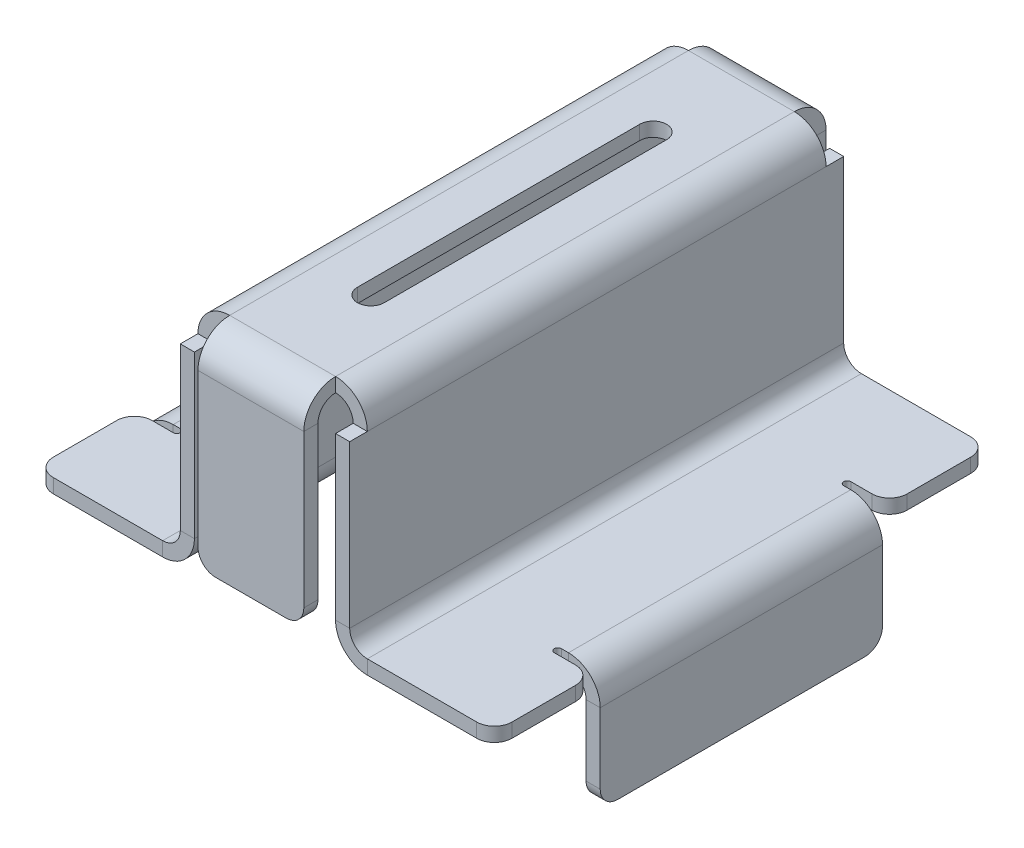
ISO-10303-21;
HEADER;
FILE_DESCRIPTION(('STEP AP214'),'2;1');
FILE_NAME('part.step','',(''),(''),'','','');
FILE_SCHEMA(('AUTOMOTIVE_DESIGN { 1 0 10303 214 1 1 1 1 }'));
ENDSEC;
DATA;
#1=APPLICATION_CONTEXT('core data for automotive mechanical design processes');
#2=APPLICATION_PROTOCOL_DEFINITION('international standard','automotive_design',2000,#1);
#3=PRODUCT_CONTEXT('',#1,'mechanical');
#4=PRODUCT('Part','Part','',(#3));
#5=PRODUCT_RELATED_PRODUCT_CATEGORY('part','',(#4));
#6=PRODUCT_DEFINITION_FORMATION('','',#4);
#7=PRODUCT_DEFINITION_CONTEXT('part definition',#1,'design');
#8=PRODUCT_DEFINITION('design','',#6,#7);
#9=PRODUCT_DEFINITION_SHAPE('','',#8);
#10=(LENGTH_UNIT() NAMED_UNIT(*) SI_UNIT(.MILLI.,.METRE.));
#11=(NAMED_UNIT(*) PLANE_ANGLE_UNIT() SI_UNIT($,.RADIAN.));
#12=(NAMED_UNIT(*) SI_UNIT($,.STERADIAN.) SOLID_ANGLE_UNIT());
#13=UNCERTAINTY_MEASURE_WITH_UNIT(LENGTH_MEASURE(1.E-05),#10,'distance_accuracy_value','');
#14=(GEOMETRIC_REPRESENTATION_CONTEXT(3) GLOBAL_UNCERTAINTY_ASSIGNED_CONTEXT((#13)) GLOBAL_UNIT_ASSIGNED_CONTEXT((#10,
#11,#12)) REPRESENTATION_CONTEXT('',''));
#15=CARTESIAN_POINT('',(0.,0.,0.));
#16=DIRECTION('',(0.,0.,1.));
#17=DIRECTION('',(1.,0.,0.));
#18=AXIS2_PLACEMENT_3D('',#15,#16,#17);
#19=CARTESIAN_POINT('',(0.,-81.026,0.));
#20=DIRECTION('',(0.,1.,0.));
#21=DIRECTION('',(0.,0.,1.));
#22=AXIS2_PLACEMENT_3D('',#19,#20,#21);
#23=PLANE('',#22);
#24=DIRECTION('',(1.,0.,0.));
#25=VECTOR('',#24,1.);
#26=CARTESIAN_POINT('',(-82.5500000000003,-81.026,-53.34));
#27=LINE('',#26,#25);
#28=CARTESIAN_POINT('',(-76.2000000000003,-81.026,-53.34));
#29=VERTEX_POINT('',#28);
#30=CARTESIAN_POINT('',(-68.5800000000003,-81.026,-53.34));
#31=VERTEX_POINT('',#30);
#32=EDGE_CURVE('E819',#29,#31,#27,.T.);
#33=ORIENTED_EDGE('',*,*,#32,.F.);
#34=CARTESIAN_POINT('',(-76.2000000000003,-81.026,-59.69));
#35=DIRECTION('',(0.,1.,0.));
#36=DIRECTION('',(0.,0.,1.));
#37=AXIS2_PLACEMENT_3D('',#34,#35,#36);
#38=CIRCLE('',#37,6.35);
#39=CARTESIAN_POINT('',(-82.5500000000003,-81.026,-59.69));
#40=VERTEX_POINT('',#39);
#41=EDGE_CURVE('E1295',#29,#40,#38,.F.);
#42=ORIENTED_EDGE('',*,*,#41,.T.);
#43=DIRECTION('',(0.,0.,-1.));
#44=VECTOR('',#43,1.);
#45=CARTESIAN_POINT('',(-82.5500000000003,-81.026,88.9));
#46=LINE('',#45,#44);
#47=CARTESIAN_POINT('',(-82.5500000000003,-81.026,-82.55));
#48=VERTEX_POINT('',#47);
#49=EDGE_CURVE('E857',#48,#40,#46,.F.);
#50=ORIENTED_EDGE('',*,*,#49,.F.);
#51=CARTESIAN_POINT('',(-76.2000000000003,-81.026,-82.55));
#52=DIRECTION('',(0.,1.,0.));
#53=DIRECTION('',(0.,0.,1.));
#54=AXIS2_PLACEMENT_3D('',#51,#52,#53);
#55=CIRCLE('',#54,6.35);
#56=CARTESIAN_POINT('',(-76.2000000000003,-81.026,-88.9));
#57=VERTEX_POINT('',#56);
#58=EDGE_CURVE('E1293',#48,#57,#55,.F.);
#59=ORIENTED_EDGE('',*,*,#58,.T.);
#60=DIRECTION('',(1.,0.,0.));
#61=VECTOR('',#60,1.);
#62=CARTESIAN_POINT('',(-82.5500000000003,-81.026,-88.9));
#63=LINE('',#62,#61);
#64=CARTESIAN_POINT('',(-36.8300000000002,-81.026,-88.9));
#65=VERTEX_POINT('',#64);
#66=EDGE_CURVE('E853',#65,#57,#63,.F.);
#67=ORIENTED_EDGE('',*,*,#66,.F.);
#68=DIRECTION('',(0.,0.,1.));
#69=VECTOR('',#68,1.);
#70=CARTESIAN_POINT('',(-36.8300000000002,-81.026,-88.9));
#71=LINE('',#70,#69);
#72=CARTESIAN_POINT('',(-36.8300000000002,-81.026,88.9));
#73=VERTEX_POINT('',#72);
#74=EDGE_CURVE('E872',#73,#65,#71,.F.);
#75=ORIENTED_EDGE('',*,*,#74,.F.);
#76=DIRECTION('',(-1.,0.,0.));
#77=VECTOR('',#76,1.);
#78=CARTESIAN_POINT('',(-30.4800000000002,-81.026,88.9));
#79=LINE('',#78,#77);
#80=CARTESIAN_POINT('',(-76.2000000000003,-81.026,88.9));
#81=VERTEX_POINT('',#80);
#82=EDGE_CURVE('E861',#81,#73,#79,.F.);
#83=ORIENTED_EDGE('',*,*,#82,.F.);
#84=CARTESIAN_POINT('',(-76.2000000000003,-81.026,82.55));
#85=DIRECTION('',(0.,1.,0.));
#86=DIRECTION('',(0.,0.,1.));
#87=AXIS2_PLACEMENT_3D('',#84,#85,#86);
#88=CIRCLE('',#87,6.35);
#89=CARTESIAN_POINT('',(-82.5500000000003,-81.026,82.55));
#90=VERTEX_POINT('',#89);
#91=EDGE_CURVE('E1289',#81,#90,#88,.F.);
#92=ORIENTED_EDGE('',*,*,#91,.T.);
#93=CARTESIAN_POINT('',(-82.5500000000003,-81.026,59.69));
#94=VERTEX_POINT('',#93);
#95=EDGE_CURVE('E858',#94,#90,#46,.F.);
#96=ORIENTED_EDGE('',*,*,#95,.F.);
#97=CARTESIAN_POINT('',(-76.2000000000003,-81.026,59.69));
#98=DIRECTION('',(0.,1.,0.));
#99=DIRECTION('',(0.,0.,1.));
#100=AXIS2_PLACEMENT_3D('',#97,#98,#99);
#101=CIRCLE('',#100,6.35);
#102=CARTESIAN_POINT('',(-76.2000000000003,-81.026,53.34));
#103=VERTEX_POINT('',#102);
#104=EDGE_CURVE('E1291',#94,#103,#101,.F.);
#105=ORIENTED_EDGE('',*,*,#104,.T.);
#106=DIRECTION('',(-1.,0.,0.));
#107=VECTOR('',#106,1.);
#108=CARTESIAN_POINT('',(-68.5800000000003,-81.026,53.34));
#109=LINE('',#108,#107);
#110=CARTESIAN_POINT('',(-68.5800000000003,-81.026,53.34));
#111=VERTEX_POINT('',#110);
#112=EDGE_CURVE('E837',#111,#103,#109,.T.);
#113=ORIENTED_EDGE('',*,*,#112,.F.);
#114=CARTESIAN_POINT('',(-68.5800000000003,-81.026,52.07));
#115=DIRECTION('',(0.,-1.,0.));
#116=DIRECTION('',(0.,0.,-1.));
#117=AXIS2_PLACEMENT_3D('',#114,#115,#116);
#118=CIRCLE('',#117,1.27);
#119=CARTESIAN_POINT('',(-68.5800000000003,-81.026,50.8));
#120=VERTEX_POINT('',#119);
#121=EDGE_CURVE('E833',#120,#111,#118,.T.);
#122=ORIENTED_EDGE('',*,*,#121,.F.);
#123=DIRECTION('',(1.,0.,0.));
#124=VECTOR('',#123,1.);
#125=CARTESIAN_POINT('',(-71.1200000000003,-81.026,50.8));
#126=LINE('',#125,#124);
#127=CARTESIAN_POINT('',(-71.1200000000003,-81.026,50.8));
#128=VERTEX_POINT('',#127);
#129=EDGE_CURVE('E830',#128,#120,#126,.T.);
#130=ORIENTED_EDGE('',*,*,#129,.F.);
#131=DIRECTION('',(0.,0.,-1.));
#132=VECTOR('',#131,1.);
#133=CARTESIAN_POINT('',(-71.1200000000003,-81.026,-50.8));
#134=LINE('',#133,#132);
#135=CARTESIAN_POINT('',(-71.1200000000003,-81.026,-50.8));
#136=VERTEX_POINT('',#135);
#137=EDGE_CURVE('E809',#136,#128,#134,.F.);
#138=ORIENTED_EDGE('',*,*,#137,.F.);
#139=DIRECTION('',(-1.,0.,0.));
#140=VECTOR('',#139,1.);
#141=CARTESIAN_POINT('',(-68.5800000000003,-81.026,-50.8));
#142=LINE('',#141,#140);
#143=CARTESIAN_POINT('',(-68.5800000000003,-81.026,-50.8));
#144=VERTEX_POINT('',#143);
#145=EDGE_CURVE('E826',#144,#136,#142,.T.);
#146=ORIENTED_EDGE('',*,*,#145,.F.);
#147=CARTESIAN_POINT('',(-68.5800000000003,-81.026,-52.07));
#148=DIRECTION('',(0.,-1.,0.));
#149=DIRECTION('',(0.,0.,-1.));
#150=AXIS2_PLACEMENT_3D('',#147,#148,#149);
#151=CIRCLE('',#150,1.27);
#152=EDGE_CURVE('E822',#31,#144,#151,.T.);
#153=ORIENTED_EDGE('',*,*,#152,.F.);
#154=EDGE_LOOP('',(#33,#42,#50,#59,#67,#75,#83,#92,#96,#105,#113,#122,#130,#138,#146,#153));
#155=FACE_BOUND('',#154,.T.);
#156=ADVANCED_FACE('F201',(#155),#23,.F.);
#157=CARTESIAN_POINT('',(0.,-75.946,0.));
#158=DIRECTION('',(0.,1.,0.));
#159=DIRECTION('',(0.,0.,1.));
#160=AXIS2_PLACEMENT_3D('',#157,#158,#159);
#161=PLANE('',#160);
#162=DIRECTION('',(0.,0.,1.));
#163=VECTOR('',#162,1.);
#164=CARTESIAN_POINT('',(-82.5500000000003,-75.946,0.));
#165=LINE('',#164,#163);
#166=CARTESIAN_POINT('',(-82.5500000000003,-75.946,-82.55));
#167=VERTEX_POINT('',#166);
#168=CARTESIAN_POINT('',(-82.5500000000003,-75.946,-59.69));
#169=VERTEX_POINT('',#168);
#170=EDGE_CURVE('E866',#167,#169,#165,.T.);
#171=ORIENTED_EDGE('',*,*,#170,.T.);
#172=CARTESIAN_POINT('',(-76.2000000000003,-75.946,-59.69));
#173=DIRECTION('',(0.,1.,0.));
#174=DIRECTION('',(0.,0.,1.));
#175=AXIS2_PLACEMENT_3D('',#172,#173,#174);
#176=CIRCLE('',#175,6.35);
#177=CARTESIAN_POINT('',(-76.2000000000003,-75.946,-53.34));
#178=VERTEX_POINT('',#177);
#179=EDGE_CURVE('E1285',#169,#178,#176,.T.);
#180=ORIENTED_EDGE('',*,*,#179,.T.);
#181=DIRECTION('',(1.,0.,0.));
#182=VECTOR('',#181,1.);
#183=CARTESIAN_POINT('',(0.,-75.946,-53.34));
#184=LINE('',#183,#182);
#185=CARTESIAN_POINT('',(-68.5800000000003,-75.946,-53.34));
#186=VERTEX_POINT('',#185);
#187=EDGE_CURVE('E850',#178,#186,#184,.T.);
#188=ORIENTED_EDGE('',*,*,#187,.T.);
#189=CARTESIAN_POINT('',(-68.5800000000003,-75.946,-52.07));
#190=DIRECTION('',(0.,1.,0.));
#191=DIRECTION('',(0.,0.,1.));
#192=AXIS2_PLACEMENT_3D('',#189,#190,#191);
#193=CIRCLE('',#192,1.27);
#194=CARTESIAN_POINT('',(-68.5800000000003,-75.946,-50.8));
#195=VERTEX_POINT('',#194);
#196=EDGE_CURVE('E1209',#186,#195,#193,.F.);
#197=ORIENTED_EDGE('',*,*,#196,.T.);
#198=DIRECTION('',(-1.,0.,0.));
#199=VECTOR('',#198,1.);
#200=CARTESIAN_POINT('',(0.,-75.946,-50.8));
#201=LINE('',#200,#199);
#202=CARTESIAN_POINT('',(-71.1200000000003,-75.946,-50.8));
#203=VERTEX_POINT('',#202);
#204=EDGE_CURVE('E1206',#195,#203,#201,.T.);
#205=ORIENTED_EDGE('',*,*,#204,.T.);
#206=DIRECTION('',(0.,0.,-1.));
#207=VECTOR('',#206,1.);
#208=CARTESIAN_POINT('',(-71.1200000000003,-75.946,-50.8));
#209=LINE('',#208,#207);
#210=CARTESIAN_POINT('',(-71.1200000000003,-75.946,50.8));
#211=VERTEX_POINT('',#210);
#212=EDGE_CURVE('E796',#203,#211,#209,.F.);
#213=ORIENTED_EDGE('',*,*,#212,.T.);
#214=DIRECTION('',(1.,0.,0.));
#215=VECTOR('',#214,1.);
#216=CARTESIAN_POINT('',(0.,-75.946,50.8));
#217=LINE('',#216,#215);
#218=CARTESIAN_POINT('',(-68.5800000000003,-75.946,50.8));
#219=VERTEX_POINT('',#218);
#220=EDGE_CURVE('E1203',#211,#219,#217,.T.);
#221=ORIENTED_EDGE('',*,*,#220,.T.);
#222=CARTESIAN_POINT('',(-68.5800000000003,-75.946,52.07));
#223=DIRECTION('',(0.,1.,0.));
#224=DIRECTION('',(0.,0.,1.));
#225=AXIS2_PLACEMENT_3D('',#222,#223,#224);
#226=CIRCLE('',#225,1.27);
#227=CARTESIAN_POINT('',(-68.5800000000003,-75.946,53.34));
#228=VERTEX_POINT('',#227);
#229=EDGE_CURVE('E1200',#219,#228,#226,.F.);
#230=ORIENTED_EDGE('',*,*,#229,.T.);
#231=DIRECTION('',(-1.,0.,0.));
#232=VECTOR('',#231,1.);
#233=CARTESIAN_POINT('',(0.,-75.946,53.34));
#234=LINE('',#233,#232);
#235=CARTESIAN_POINT('',(-76.2000000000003,-75.946,53.34));
#236=VERTEX_POINT('',#235);
#237=EDGE_CURVE('E821',#228,#236,#234,.T.);
#238=ORIENTED_EDGE('',*,*,#237,.T.);
#239=CARTESIAN_POINT('',(-76.2000000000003,-75.946,59.69));
#240=DIRECTION('',(0.,1.,0.));
#241=DIRECTION('',(0.,0.,1.));
#242=AXIS2_PLACEMENT_3D('',#239,#240,#241);
#243=CIRCLE('',#242,6.35);
#244=CARTESIAN_POINT('',(-82.5500000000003,-75.946,59.69));
#245=VERTEX_POINT('',#244);
#246=EDGE_CURVE('E1281',#236,#245,#243,.T.);
#247=ORIENTED_EDGE('',*,*,#246,.T.);
#248=CARTESIAN_POINT('',(-82.5500000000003,-75.946,82.55));
#249=VERTEX_POINT('',#248);
#250=EDGE_CURVE('E867',#245,#249,#165,.T.);
#251=ORIENTED_EDGE('',*,*,#250,.T.);
#252=CARTESIAN_POINT('',(-76.2000000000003,-75.946,82.55));
#253=DIRECTION('',(0.,1.,0.));
#254=DIRECTION('',(0.,0.,1.));
#255=AXIS2_PLACEMENT_3D('',#252,#253,#254);
#256=CIRCLE('',#255,6.35);
#257=CARTESIAN_POINT('',(-76.2000000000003,-75.946,88.9));
#258=VERTEX_POINT('',#257);
#259=EDGE_CURVE('E1279',#249,#258,#256,.T.);
#260=ORIENTED_EDGE('',*,*,#259,.T.);
#261=DIRECTION('',(1.,0.,0.));
#262=VECTOR('',#261,1.);
#263=CARTESIAN_POINT('',(0.,-75.946,88.9));
#264=LINE('',#263,#262);
#265=CARTESIAN_POINT('',(-36.8300000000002,-75.946,88.9));
#266=VERTEX_POINT('',#265);
#267=EDGE_CURVE('E870',#258,#266,#264,.T.);
#268=ORIENTED_EDGE('',*,*,#267,.T.);
#269=DIRECTION('',(0.,0.,1.));
#270=VECTOR('',#269,1.);
#271=CARTESIAN_POINT('',(-36.8300000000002,-75.946,-88.9));
#272=LINE('',#271,#270);
#273=CARTESIAN_POINT('',(-36.8300000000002,-75.946,-88.9));
#274=VERTEX_POINT('',#273);
#275=EDGE_CURVE('E877',#274,#266,#272,.T.);
#276=ORIENTED_EDGE('',*,*,#275,.F.);
#277=DIRECTION('',(-1.,0.,0.));
#278=VECTOR('',#277,1.);
#279=CARTESIAN_POINT('',(0.,-75.946,-88.9));
#280=LINE('',#279,#278);
#281=CARTESIAN_POINT('',(-76.2000000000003,-75.946,-88.9));
#282=VERTEX_POINT('',#281);
#283=EDGE_CURVE('E863',#274,#282,#280,.T.);
#284=ORIENTED_EDGE('',*,*,#283,.T.);
#285=CARTESIAN_POINT('',(-76.2000000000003,-75.946,-82.55));
#286=DIRECTION('',(0.,1.,0.));
#287=DIRECTION('',(0.,0.,1.));
#288=AXIS2_PLACEMENT_3D('',#285,#286,#287);
#289=CIRCLE('',#288,6.35);
#290=EDGE_CURVE('E1283',#282,#167,#289,.T.);
#291=ORIENTED_EDGE('',*,*,#290,.T.);
#292=EDGE_LOOP('',(#171,#180,#188,#197,#205,#213,#221,#230,#238,#247,#251,#260,#268,#276,#284,#291));
#293=FACE_BOUND('',#292,.T.);
#294=ADVANCED_FACE('F1555',(#293),#161,.T.);
#295=CARTESIAN_POINT('',(-82.5500000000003,-81.026,88.9));
#296=DIRECTION('',(-1.,0.,0.));
#297=DIRECTION('',(0.,-1.,0.));
#298=AXIS2_PLACEMENT_3D('',#295,#296,#297);
#299=PLANE('',#298);
#300=ORIENTED_EDGE('',*,*,#49,.T.);
#301=DIRECTION('',(0.,1.,0.));
#302=VECTOR('',#301,1.);
#303=CARTESIAN_POINT('',(-82.5500000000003,-81.026,-59.69));
#304=LINE('',#303,#302);
#305=EDGE_CURVE('E1276',#40,#169,#304,.T.);
#306=ORIENTED_EDGE('',*,*,#305,.T.);
#307=ORIENTED_EDGE('',*,*,#170,.F.);
#308=DIRECTION('',(0.,1.,0.));
#309=VECTOR('',#308,1.);
#310=CARTESIAN_POINT('',(-82.5500000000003,-81.026,-82.55));
#311=LINE('',#310,#309);
#312=EDGE_CURVE('E1274',#167,#48,#311,.F.);
#313=ORIENTED_EDGE('',*,*,#312,.T.);
#314=EDGE_LOOP('',(#300,#306,#307,#313));
#315=FACE_BOUND('',#314,.T.);
#316=ADVANCED_FACE('F1584',(#315),#299,.T.);
#317=ORIENTED_EDGE('',*,*,#250,.F.);
#318=DIRECTION('',(0.,1.,0.));
#319=VECTOR('',#318,1.);
#320=CARTESIAN_POINT('',(-82.5500000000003,-81.026,59.69));
#321=LINE('',#320,#319);
#322=EDGE_CURVE('E1333',#245,#94,#321,.F.);
#323=ORIENTED_EDGE('',*,*,#322,.T.);
#324=ORIENTED_EDGE('',*,*,#95,.T.);
#325=DIRECTION('',(0.,1.,0.));
#326=VECTOR('',#325,1.);
#327=CARTESIAN_POINT('',(-82.5500000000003,-81.026,82.55));
#328=LINE('',#327,#326);
#329=EDGE_CURVE('E1330',#90,#249,#328,.T.);
#330=ORIENTED_EDGE('',*,*,#329,.T.);
#331=EDGE_LOOP('',(#317,#323,#324,#330));
#332=FACE_BOUND('',#331,.T.);
#333=ADVANCED_FACE('F1593',(#332),#299,.T.);
#334=CARTESIAN_POINT('',(-30.4800000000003,-81.026,-88.9));
#335=DIRECTION('',(0.,0.,1.));
#336=DIRECTION('',(0.,-1.,0.));
#337=AXIS2_PLACEMENT_3D('',#334,#335,#336);
#338=PLANE('',#337);
#339=DIRECTION('',(1.,0.,0.));
#340=VECTOR('',#339,1.);
#341=CARTESIAN_POINT('',(-30.4800000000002,-69.596,-88.9));
#342=LINE('',#341,#340);
#343=CARTESIAN_POINT('',(-30.4800000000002,-69.596,-88.9));
#344=VERTEX_POINT('',#343);
#345=CARTESIAN_POINT('',(-25.4000000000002,-69.596,-88.9));
#346=VERTEX_POINT('',#345);
#347=EDGE_CURVE('E899',#344,#346,#342,.T.);
#348=ORIENTED_EDGE('',*,*,#347,.F.);
#349=DIRECTION('',(0.,1.,0.));
#350=VECTOR('',#349,1.);
#351=CARTESIAN_POINT('',(-30.48,1.07315756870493E-13,-88.9));
#352=LINE('',#351,#350);
#353=CARTESIAN_POINT('',(-30.48,-11.43,-88.9));
#354=VERTEX_POINT('',#353);
#355=EDGE_CURVE('E904',#354,#344,#352,.F.);
#356=ORIENTED_EDGE('',*,*,#355,.F.);
#357=DIRECTION('',(1.,0.,0.));
#358=VECTOR('',#357,1.);
#359=CARTESIAN_POINT('',(-25.4,-11.43,-88.9));
#360=LINE('',#359,#358);
#361=CARTESIAN_POINT('',(-25.4,-11.43,-88.9));
#362=VERTEX_POINT('',#361);
#363=EDGE_CURVE('E919',#362,#354,#360,.F.);
#364=ORIENTED_EDGE('',*,*,#363,.F.);
#365=DIRECTION('',(0.,-1.,0.));
#366=VECTOR('',#365,1.);
#367=CARTESIAN_POINT('',(-25.4000000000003,-81.026,-88.9));
#368=LINE('',#367,#366);
#369=EDGE_CURVE('E910',#362,#346,#368,.T.);
#370=ORIENTED_EDGE('',*,*,#369,.T.);
#371=EDGE_LOOP('',(#348,#356,#364,#370));
#372=FACE_BOUND('',#371,.T.);
#373=ADVANCED_FACE('F1526',(#372),#338,.F.);
#374=CARTESIAN_POINT('',(-30.48,-5.07999999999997,88.9));
#375=DIRECTION('',(0.,0.,-1.));
#376=DIRECTION('',(0.,1.,0.));
#377=AXIS2_PLACEMENT_3D('',#374,#375,#376);
#378=PLANE('',#377);
#379=DIRECTION('',(1.,0.,0.));
#380=VECTOR('',#379,1.);
#381=CARTESIAN_POINT('',(-30.4800000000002,-69.596,88.9));
#382=LINE('',#381,#380);
#383=CARTESIAN_POINT('',(-30.4800000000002,-69.596,88.9));
#384=VERTEX_POINT('',#383);
#385=CARTESIAN_POINT('',(-25.4000000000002,-69.596,88.9));
#386=VERTEX_POINT('',#385);
#387=EDGE_CURVE('E888',#384,#386,#382,.T.);
#388=ORIENTED_EDGE('',*,*,#387,.T.);
#389=DIRECTION('',(0.,1.,0.));
#390=VECTOR('',#389,1.);
#391=CARTESIAN_POINT('',(-25.4,-5.07999999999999,88.9));
#392=LINE('',#391,#390);
#393=CARTESIAN_POINT('',(-25.4,-11.43,88.9));
#394=VERTEX_POINT('',#393);
#395=EDGE_CURVE('E913',#386,#394,#392,.T.);
#396=ORIENTED_EDGE('',*,*,#395,.T.);
#397=DIRECTION('',(1.,0.,0.));
#398=VECTOR('',#397,1.);
#399=CARTESIAN_POINT('',(-30.48,-11.4299999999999,88.9));
#400=LINE('',#399,#398);
#401=CARTESIAN_POINT('',(-30.48,-11.4299999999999,88.9));
#402=VERTEX_POINT('',#401);
#403=EDGE_CURVE('E902',#394,#402,#400,.F.);
#404=ORIENTED_EDGE('',*,*,#403,.T.);
#405=DIRECTION('',(0.,-1.,0.));
#406=VECTOR('',#405,1.);
#407=CARTESIAN_POINT('',(-30.48,1.07315756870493E-13,88.9));
#408=LINE('',#407,#406);
#409=EDGE_CURVE('E908',#384,#402,#408,.F.);
#410=ORIENTED_EDGE('',*,*,#409,.F.);
#411=EDGE_LOOP('',(#388,#396,#404,#410));
#412=FACE_BOUND('',#411,.T.);
#413=ADVANCED_FACE('F2202',(#412),#378,.F.);
#414=CARTESIAN_POINT('',(-30.48,1.23560658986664E-13,0.));
#415=DIRECTION('',(-1.,0.,0.));
#416=DIRECTION('',(0.,1.,0.));
#417=AXIS2_PLACEMENT_3D('',#414,#415,#416);
#418=PLANE('',#417);
#419=ORIENTED_EDGE('',*,*,#355,.T.);
#420=DIRECTION('',(0.,0.,1.));
#421=VECTOR('',#420,1.);
#422=CARTESIAN_POINT('',(-30.4800000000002,-69.596,88.9));
#423=LINE('',#422,#421);
#424=EDGE_CURVE('E894',#384,#344,#423,.F.);
#425=ORIENTED_EDGE('',*,*,#424,.F.);
#426=ORIENTED_EDGE('',*,*,#409,.T.);
#427=DIRECTION('',(0.,0.,-1.));
#428=VECTOR('',#427,1.);
#429=CARTESIAN_POINT('',(-30.48,-11.43,0.));
#430=LINE('',#429,#428);
#431=CARTESIAN_POINT('',(-30.48,-11.4299999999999,82.55));
#432=VERTEX_POINT('',#431);
#433=EDGE_CURVE('E915',#402,#432,#430,.T.);
#434=ORIENTED_EDGE('',*,*,#433,.T.);
#435=DIRECTION('',(0.,0.,-1.));
#436=VECTOR('',#435,1.);
#437=CARTESIAN_POINT('',(-30.48,-11.43,-82.55));
#438=LINE('',#437,#436);
#439=CARTESIAN_POINT('',(-30.48,-11.43,-82.55));
#440=VERTEX_POINT('',#439);
#441=EDGE_CURVE('E935',#432,#440,#438,.T.);
#442=ORIENTED_EDGE('',*,*,#441,.T.);
#443=EDGE_CURVE('E918',#440,#354,#430,.T.);
#444=ORIENTED_EDGE('',*,*,#443,.T.);
#445=EDGE_LOOP('',(#419,#425,#426,#434,#442,#444));
#446=FACE_BOUND('',#445,.T.);
#447=ADVANCED_FACE('F1528',(#446),#418,.T.);
#448=CARTESIAN_POINT('',(-25.4,1.05823933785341E-13,0.));
#449=DIRECTION('',(-1.,0.,0.));
#450=DIRECTION('',(0.,1.,0.));
#451=AXIS2_PLACEMENT_3D('',#448,#449,#450);
#452=PLANE('',#451);
#453=DIRECTION('',(0.,0.,1.));
#454=VECTOR('',#453,1.);
#455=CARTESIAN_POINT('',(-25.4000000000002,-69.596,88.9));
#456=LINE('',#455,#454);
#457=EDGE_CURVE('E882',#386,#346,#456,.F.);
#458=ORIENTED_EDGE('',*,*,#457,.T.);
#459=ORIENTED_EDGE('',*,*,#369,.F.);
#460=DIRECTION('',(0.,0.,1.));
#461=VECTOR('',#460,1.);
#462=CARTESIAN_POINT('',(-25.4,-11.43,88.9));
#463=LINE('',#462,#461);
#464=CARTESIAN_POINT('',(-25.4,-11.43,-82.55));
#465=VERTEX_POINT('',#464);
#466=EDGE_CURVE('E925',#465,#362,#463,.F.);
#467=ORIENTED_EDGE('',*,*,#466,.F.);
#468=DIRECTION('',(0.,0.,-1.));
#469=VECTOR('',#468,1.);
#470=CARTESIAN_POINT('',(-25.4,-11.43,-82.55));
#471=LINE('',#470,#469);
#472=CARTESIAN_POINT('',(-25.4,-11.43,82.55));
#473=VERTEX_POINT('',#472);
#474=EDGE_CURVE('E907',#473,#465,#471,.T.);
#475=ORIENTED_EDGE('',*,*,#474,.F.);
#476=EDGE_CURVE('E922',#394,#473,#463,.F.);
#477=ORIENTED_EDGE('',*,*,#476,.F.);
#478=ORIENTED_EDGE('',*,*,#395,.F.);
#479=EDGE_LOOP('',(#458,#459,#467,#475,#477,#478));
#480=FACE_BOUND('',#479,.T.);
#481=ADVANCED_FACE('F1519',(#480),#452,.F.);
#482=CARTESIAN_POINT('',(0.,-5.08,0.));
#483=DIRECTION('',(0.,1.,0.));
#484=DIRECTION('',(0.,0.,1.));
#485=AXIS2_PLACEMENT_3D('',#482,#483,#484);
#486=PLANE('',#485);
#487=DIRECTION('',(0.,0.,-1.));
#488=VECTOR('',#487,1.);
#489=CARTESIAN_POINT('',(4.82599999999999,-5.08,50.8));
#490=LINE('',#489,#488);
#491=CARTESIAN_POINT('',(4.82599999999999,-5.08,50.8));
#492=VERTEX_POINT('',#491);
#493=CARTESIAN_POINT('',(4.82599999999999,-5.08,-50.8));
#494=VERTEX_POINT('',#493);
#495=EDGE_CURVE('E1162',#492,#494,#490,.T.);
#496=ORIENTED_EDGE('',*,*,#495,.T.);
#497=CARTESIAN_POINT('',(0.,-5.08,-50.8));
#498=DIRECTION('',(0.,1.,0.));
#499=DIRECTION('',(0.,0.,-1.));
#500=AXIS2_PLACEMENT_3D('',#497,#498,#499);
#501=CIRCLE('',#500,4.826);
#502=CARTESIAN_POINT('',(-4.82600000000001,-5.08,-50.8));
#503=VERTEX_POINT('',#502);
#504=EDGE_CURVE('E1152',#494,#503,#501,.T.);
#505=ORIENTED_EDGE('',*,*,#504,.T.);
#506=DIRECTION('',(0.,0.,1.));
#507=VECTOR('',#506,1.);
#508=CARTESIAN_POINT('',(-4.82600000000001,-5.08,50.8));
#509=LINE('',#508,#507);
#510=CARTESIAN_POINT('',(-4.82600000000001,-5.08,50.8));
#511=VERTEX_POINT('',#510);
#512=EDGE_CURVE('E1155',#503,#511,#509,.T.);
#513=ORIENTED_EDGE('',*,*,#512,.T.);
#514=CARTESIAN_POINT('',(0.,-5.08,50.8));
#515=DIRECTION('',(0.,1.,0.));
#516=DIRECTION('',(0.,0.,1.));
#517=AXIS2_PLACEMENT_3D('',#514,#515,#516);
#518=CIRCLE('',#517,4.826);
#519=EDGE_CURVE('E1159',#511,#492,#518,.T.);
#520=ORIENTED_EDGE('',*,*,#519,.T.);
#521=EDGE_LOOP('',(#496,#505,#513,#520));
#522=FACE_BOUND('',#521,.T.);
#523=DIRECTION('',(0.,0.,-1.));
#524=VECTOR('',#523,1.);
#525=CARTESIAN_POINT('',(-19.05,-5.07999999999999,-82.55));
#526=LINE('',#525,#524);
#527=CARTESIAN_POINT('',(-19.05,-5.08,-82.55));
#528=VERTEX_POINT('',#527);
#529=CARTESIAN_POINT('',(-19.05,-5.07999999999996,82.55));
#530=VERTEX_POINT('',#529);
#531=EDGE_CURVE('E943',#528,#530,#526,.F.);
#532=ORIENTED_EDGE('',*,*,#531,.F.);
#533=DIRECTION('',(-1.,0.,0.));
#534=VECTOR('',#533,1.);
#535=CARTESIAN_POINT('',(30.48,-5.08,-82.55));
#536=LINE('',#535,#534);
#537=CARTESIAN_POINT('',(19.05,-5.08,-82.55));
#538=VERTEX_POINT('',#537);
#539=EDGE_CURVE('E1186',#538,#528,#536,.T.);
#540=ORIENTED_EDGE('',*,*,#539,.F.);
#541=DIRECTION('',(0.,0.,1.));
#542=VECTOR('',#541,1.);
#543=CARTESIAN_POINT('',(19.05,-5.07999999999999,82.55));
#544=LINE('',#543,#542);
#545=CARTESIAN_POINT('',(19.05,-5.07999999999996,82.55));
#546=VERTEX_POINT('',#545);
#547=EDGE_CURVE('E1134',#546,#538,#544,.F.);
#548=ORIENTED_EDGE('',*,*,#547,.F.);
#549=DIRECTION('',(1.,0.,0.));
#550=VECTOR('',#549,1.);
#551=CARTESIAN_POINT('',(30.48,-5.08,82.55));
#552=LINE('',#551,#550);
#553=EDGE_CURVE('E1184',#530,#546,#552,.T.);
#554=ORIENTED_EDGE('',*,*,#553,.F.);
#555=EDGE_LOOP('',(#532,#540,#548,#554));
#556=FACE_BOUND('',#555,.T.);
#557=ADVANCED_FACE('F1502',(#522,#556),#486,.F.);
#558=CARTESIAN_POINT('',(0.,0.,0.));
#559=DIRECTION('',(0.,1.,0.));
#560=DIRECTION('',(0.,0.,1.));
#561=AXIS2_PLACEMENT_3D('',#558,#559,#560);
#562=PLANE('',#561);
#563=CARTESIAN_POINT('',(0.,0.,-50.8));
#564=DIRECTION('',(0.,1.,0.));
#565=DIRECTION('',(0.,0.,-1.));
#566=AXIS2_PLACEMENT_3D('',#563,#564,#565);
#567=CIRCLE('',#566,4.826);
#568=CARTESIAN_POINT('',(4.82599999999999,0.,-50.8));
#569=VERTEX_POINT('',#568);
#570=CARTESIAN_POINT('',(-4.82600000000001,0.,-50.8));
#571=VERTEX_POINT('',#570);
#572=EDGE_CURVE('E1149',#569,#571,#567,.T.);
#573=ORIENTED_EDGE('',*,*,#572,.F.);
#574=DIRECTION('',(0.,0.,-1.));
#575=VECTOR('',#574,1.);
#576=CARTESIAN_POINT('',(4.82599999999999,0.,50.8));
#577=LINE('',#576,#575);
#578=CARTESIAN_POINT('',(4.82599999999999,0.,50.8));
#579=VERTEX_POINT('',#578);
#580=EDGE_CURVE('E1156',#579,#569,#577,.T.);
#581=ORIENTED_EDGE('',*,*,#580,.F.);
#582=CARTESIAN_POINT('',(0.,0.,50.8));
#583=DIRECTION('',(0.,1.,0.));
#584=DIRECTION('',(0.,0.,1.));
#585=AXIS2_PLACEMENT_3D('',#582,#583,#584);
#586=CIRCLE('',#585,4.826);
#587=CARTESIAN_POINT('',(-4.82600000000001,0.,50.8));
#588=VERTEX_POINT('',#587);
#589=EDGE_CURVE('E1170',#588,#579,#586,.T.);
#590=ORIENTED_EDGE('',*,*,#589,.F.);
#591=DIRECTION('',(0.,0.,1.));
#592=VECTOR('',#591,1.);
#593=CARTESIAN_POINT('',(-4.82600000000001,0.,50.8));
#594=LINE('',#593,#592);
#595=EDGE_CURVE('E1167',#571,#588,#594,.T.);
#596=ORIENTED_EDGE('',*,*,#595,.F.);
#597=EDGE_LOOP('',(#573,#581,#590,#596));
#598=FACE_BOUND('',#597,.T.);
#599=DIRECTION('',(-1.,0.,0.));
#600=VECTOR('',#599,1.);
#601=CARTESIAN_POINT('',(30.48,0.,-82.55));
#602=LINE('',#601,#600);
#603=CARTESIAN_POINT('',(19.05,0.,-82.55));
#604=VERTEX_POINT('',#603);
#605=CARTESIAN_POINT('',(-19.05,0.,-82.55));
#606=VERTEX_POINT('',#605);
#607=EDGE_CURVE('E698',#604,#606,#602,.T.);
#608=ORIENTED_EDGE('',*,*,#607,.T.);
#609=DIRECTION('',(0.,0.,-1.));
#610=VECTOR('',#609,1.);
#611=CARTESIAN_POINT('',(-19.05,0.,-82.55));
#612=LINE('',#611,#610);
#613=CARTESIAN_POINT('',(-19.05,0.,82.55));
#614=VERTEX_POINT('',#613);
#615=EDGE_CURVE('E928',#606,#614,#612,.F.);
#616=ORIENTED_EDGE('',*,*,#615,.T.);
#617=DIRECTION('',(1.,0.,0.));
#618=VECTOR('',#617,1.);
#619=CARTESIAN_POINT('',(30.48,0.,82.55));
#620=LINE('',#619,#618);
#621=CARTESIAN_POINT('',(19.05,0.,82.55));
#622=VERTEX_POINT('',#621);
#623=EDGE_CURVE('E1177',#614,#622,#620,.T.);
#624=ORIENTED_EDGE('',*,*,#623,.T.);
#625=DIRECTION('',(0.,0.,1.));
#626=VECTOR('',#625,1.);
#627=CARTESIAN_POINT('',(19.05,0.,82.55));
#628=LINE('',#627,#626);
#629=EDGE_CURVE('E1119',#622,#604,#628,.F.);
#630=ORIENTED_EDGE('',*,*,#629,.T.);
#631=EDGE_LOOP('',(#608,#616,#624,#630));
#632=FACE_BOUND('',#631,.T.);
#633=ADVANCED_FACE('F1480',(#598,#632),#562,.T.);
#634=CARTESIAN_POINT('',(0.,-81.026,0.));
#635=DIRECTION('',(0.,1.,0.));
#636=DIRECTION('',(0.,0.,1.));
#637=AXIS2_PLACEMENT_3D('',#634,#635,#636);
#638=PLANE('',#637);
#639=DIRECTION('',(-1.,0.,0.));
#640=VECTOR('',#639,1.);
#641=CARTESIAN_POINT('',(82.5500000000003,-81.026,53.34));
#642=LINE('',#641,#640);
#643=CARTESIAN_POINT('',(76.2000000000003,-81.026,53.34));
#644=VERTEX_POINT('',#643);
#645=CARTESIAN_POINT('',(68.5800000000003,-81.026,53.34));
#646=VERTEX_POINT('',#645);
#647=EDGE_CURVE('E1011',#644,#646,#642,.T.);
#648=ORIENTED_EDGE('',*,*,#647,.F.);
#649=CARTESIAN_POINT('',(76.2000000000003,-81.026,59.69));
#650=DIRECTION('',(0.,1.,0.));
#651=DIRECTION('',(0.,0.,1.));
#652=AXIS2_PLACEMENT_3D('',#649,#650,#651);
#653=CIRCLE('',#652,6.35);
#654=CARTESIAN_POINT('',(82.5500000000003,-81.026,59.69));
#655=VERTEX_POINT('',#654);
#656=EDGE_CURVE('E1251',#644,#655,#653,.F.);
#657=ORIENTED_EDGE('',*,*,#656,.T.);
#658=DIRECTION('',(0.,0.,1.));
#659=VECTOR('',#658,1.);
#660=CARTESIAN_POINT('',(82.5500000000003,-81.026,0.));
#661=LINE('',#660,#659);
#662=CARTESIAN_POINT('',(82.5500000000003,-81.026,82.55));
#663=VERTEX_POINT('',#662);
#664=EDGE_CURVE('E1051',#655,#663,#661,.T.);
#665=ORIENTED_EDGE('',*,*,#664,.T.);
#666=CARTESIAN_POINT('',(76.2000000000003,-81.026,82.55));
#667=DIRECTION('',(0.,1.,0.));
#668=DIRECTION('',(0.,0.,1.));
#669=AXIS2_PLACEMENT_3D('',#666,#667,#668);
#670=CIRCLE('',#669,6.35);
#671=CARTESIAN_POINT('',(76.2000000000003,-81.026,88.9));
#672=VERTEX_POINT('',#671);
#673=EDGE_CURVE('E1249',#663,#672,#670,.F.);
#674=ORIENTED_EDGE('',*,*,#673,.T.);
#675=DIRECTION('',(-1.,0.,0.));
#676=VECTOR('',#675,1.);
#677=CARTESIAN_POINT('',(0.,-81.026,88.9));
#678=LINE('',#677,#676);
#679=CARTESIAN_POINT('',(36.8300000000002,-81.026,88.9));
#680=VERTEX_POINT('',#679);
#681=EDGE_CURVE('E1045',#672,#680,#678,.T.);
#682=ORIENTED_EDGE('',*,*,#681,.T.);
#683=DIRECTION('',(0.,0.,-1.));
#684=VECTOR('',#683,1.);
#685=CARTESIAN_POINT('',(36.8300000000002,-81.026,88.9));
#686=LINE('',#685,#684);
#687=CARTESIAN_POINT('',(36.8300000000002,-81.026,-88.9));
#688=VERTEX_POINT('',#687);
#689=EDGE_CURVE('E1064',#688,#680,#686,.F.);
#690=ORIENTED_EDGE('',*,*,#689,.F.);
#691=DIRECTION('',(1.,0.,0.));
#692=VECTOR('',#691,1.);
#693=CARTESIAN_POINT('',(0.,-81.026,-88.9));
#694=LINE('',#693,#692);
#695=CARTESIAN_POINT('',(76.2000000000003,-81.026,-88.9));
#696=VERTEX_POINT('',#695);
#697=EDGE_CURVE('E1052',#688,#696,#694,.T.);
#698=ORIENTED_EDGE('',*,*,#697,.T.);
#699=CARTESIAN_POINT('',(76.2000000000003,-81.026,-82.55));
#700=DIRECTION('',(0.,1.,0.));
#701=DIRECTION('',(0.,0.,1.));
#702=AXIS2_PLACEMENT_3D('',#699,#700,#701);
#703=CIRCLE('',#702,6.35);
#704=CARTESIAN_POINT('',(82.5500000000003,-81.026,-82.55));
#705=VERTEX_POINT('',#704);
#706=EDGE_CURVE('E1247',#696,#705,#703,.F.);
#707=ORIENTED_EDGE('',*,*,#706,.T.);
#708=CARTESIAN_POINT('',(82.5500000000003,-81.026,-59.69));
#709=VERTEX_POINT('',#708);
#710=EDGE_CURVE('E1048',#705,#709,#661,.T.);
#711=ORIENTED_EDGE('',*,*,#710,.T.);
#712=CARTESIAN_POINT('',(76.2000000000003,-81.026,-59.69));
#713=DIRECTION('',(0.,1.,0.));
#714=DIRECTION('',(0.,0.,1.));
#715=AXIS2_PLACEMENT_3D('',#712,#713,#714);
#716=CIRCLE('',#715,6.35);
#717=CARTESIAN_POINT('',(76.2000000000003,-81.026,-53.34));
#718=VERTEX_POINT('',#717);
#719=EDGE_CURVE('E1245',#709,#718,#716,.F.);
#720=ORIENTED_EDGE('',*,*,#719,.T.);
#721=DIRECTION('',(1.,0.,0.));
#722=VECTOR('',#721,1.);
#723=CARTESIAN_POINT('',(68.5800000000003,-81.026,-53.34));
#724=LINE('',#723,#722);
#725=CARTESIAN_POINT('',(68.5800000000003,-81.026,-53.34));
#726=VERTEX_POINT('',#725);
#727=EDGE_CURVE('E1029',#726,#718,#724,.T.);
#728=ORIENTED_EDGE('',*,*,#727,.F.);
#729=CARTESIAN_POINT('',(68.5800000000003,-81.026,-52.07));
#730=DIRECTION('',(0.,-1.,0.));
#731=DIRECTION('',(0.,0.,-1.));
#732=AXIS2_PLACEMENT_3D('',#729,#730,#731);
#733=CIRCLE('',#732,1.27);
#734=CARTESIAN_POINT('',(68.5800000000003,-81.026,-50.8));
#735=VERTEX_POINT('',#734);
#736=EDGE_CURVE('E1025',#735,#726,#733,.T.);
#737=ORIENTED_EDGE('',*,*,#736,.F.);
#738=DIRECTION('',(-1.,0.,0.));
#739=VECTOR('',#738,1.);
#740=CARTESIAN_POINT('',(71.1200000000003,-81.026,-50.8));
#741=LINE('',#740,#739);
#742=CARTESIAN_POINT('',(71.1200000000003,-81.026,-50.8));
#743=VERTEX_POINT('',#742);
#744=EDGE_CURVE('E1022',#743,#735,#741,.T.);
#745=ORIENTED_EDGE('',*,*,#744,.F.);
#746=DIRECTION('',(0.,0.,1.));
#747=VECTOR('',#746,1.);
#748=CARTESIAN_POINT('',(71.1200000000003,-81.026,50.8));
#749=LINE('',#748,#747);
#750=CARTESIAN_POINT('',(71.1200000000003,-81.026,50.8));
#751=VERTEX_POINT('',#750);
#752=EDGE_CURVE('E1001',#751,#743,#749,.F.);
#753=ORIENTED_EDGE('',*,*,#752,.F.);
#754=DIRECTION('',(1.,0.,0.));
#755=VECTOR('',#754,1.);
#756=CARTESIAN_POINT('',(68.5800000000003,-81.026,50.8));
#757=LINE('',#756,#755);
#758=CARTESIAN_POINT('',(68.5800000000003,-81.026,50.8));
#759=VERTEX_POINT('',#758);
#760=EDGE_CURVE('E1018',#759,#751,#757,.T.);
#761=ORIENTED_EDGE('',*,*,#760,.F.);
#762=CARTESIAN_POINT('',(68.5800000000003,-81.026,52.07));
#763=DIRECTION('',(0.,-1.,0.));
#764=DIRECTION('',(0.,0.,-1.));
#765=AXIS2_PLACEMENT_3D('',#762,#763,#764);
#766=CIRCLE('',#765,1.27);
#767=EDGE_CURVE('E1014',#646,#759,#766,.T.);
#768=ORIENTED_EDGE('',*,*,#767,.F.);
#769=EDGE_LOOP('',(#648,#657,#665,#674,#682,#690,#698,#707,#711,#720,#728,#737,#745,#753,#761,#768));
#770=FACE_BOUND('',#769,.T.);
#771=ADVANCED_FACE('F1381',(#770),#638,.F.);
#772=CARTESIAN_POINT('',(0.,-75.946,0.));
#773=DIRECTION('',(0.,1.,0.));
#774=DIRECTION('',(0.,0.,1.));
#775=AXIS2_PLACEMENT_3D('',#772,#773,#774);
#776=PLANE('',#775);
#777=DIRECTION('',(0.,0.,-1.));
#778=VECTOR('',#777,1.);
#779=CARTESIAN_POINT('',(82.5500000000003,-75.946,88.9));
#780=LINE('',#779,#778);
#781=CARTESIAN_POINT('',(82.5500000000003,-75.946,59.69));
#782=VERTEX_POINT('',#781);
#783=CARTESIAN_POINT('',(82.5500000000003,-75.946,82.55));
#784=VERTEX_POINT('',#783);
#785=EDGE_CURVE('E1060',#782,#784,#780,.F.);
#786=ORIENTED_EDGE('',*,*,#785,.F.);
#787=CARTESIAN_POINT('',(76.2000000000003,-75.946,59.69));
#788=DIRECTION('',(0.,1.,0.));
#789=DIRECTION('',(0.,0.,1.));
#790=AXIS2_PLACEMENT_3D('',#787,#788,#789);
#791=CIRCLE('',#790,6.35);
#792=CARTESIAN_POINT('',(76.2000000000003,-75.946,53.34));
#793=VERTEX_POINT('',#792);
#794=EDGE_CURVE('E1241',#782,#793,#791,.T.);
#795=ORIENTED_EDGE('',*,*,#794,.T.);
#796=DIRECTION('',(-1.,0.,0.));
#797=VECTOR('',#796,1.);
#798=CARTESIAN_POINT('',(0.,-75.946,53.34));
#799=LINE('',#798,#797);
#800=CARTESIAN_POINT('',(68.5800000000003,-75.946,53.34));
#801=VERTEX_POINT('',#800);
#802=EDGE_CURVE('E1042',#793,#801,#799,.T.);
#803=ORIENTED_EDGE('',*,*,#802,.T.);
#804=CARTESIAN_POINT('',(68.5800000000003,-75.946,52.07));
#805=DIRECTION('',(0.,1.,0.));
#806=DIRECTION('',(0.,0.,1.));
#807=AXIS2_PLACEMENT_3D('',#804,#805,#806);
#808=CIRCLE('',#807,1.27);
#809=CARTESIAN_POINT('',(68.5800000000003,-75.946,50.8));
#810=VERTEX_POINT('',#809);
#811=EDGE_CURVE('E1198',#801,#810,#808,.F.);
#812=ORIENTED_EDGE('',*,*,#811,.T.);
#813=DIRECTION('',(1.,0.,0.));
#814=VECTOR('',#813,1.);
#815=CARTESIAN_POINT('',(0.,-75.946,50.8));
#816=LINE('',#815,#814);
#817=CARTESIAN_POINT('',(71.1200000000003,-75.946,50.8));
#818=VERTEX_POINT('',#817);
#819=EDGE_CURVE('E1195',#810,#818,#816,.T.);
#820=ORIENTED_EDGE('',*,*,#819,.T.);
#821=DIRECTION('',(0.,0.,1.));
#822=VECTOR('',#821,1.);
#823=CARTESIAN_POINT('',(71.1200000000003,-75.946,50.8));
#824=LINE('',#823,#822);
#825=CARTESIAN_POINT('',(71.1200000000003,-75.946,-50.8));
#826=VERTEX_POINT('',#825);
#827=EDGE_CURVE('E988',#818,#826,#824,.F.);
#828=ORIENTED_EDGE('',*,*,#827,.T.);
#829=DIRECTION('',(-1.,0.,0.));
#830=VECTOR('',#829,1.);
#831=CARTESIAN_POINT('',(0.,-75.946,-50.8));
#832=LINE('',#831,#830);
#833=CARTESIAN_POINT('',(68.5800000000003,-75.946,-50.8));
#834=VERTEX_POINT('',#833);
#835=EDGE_CURVE('E1193',#826,#834,#832,.T.);
#836=ORIENTED_EDGE('',*,*,#835,.T.);
#837=CARTESIAN_POINT('',(68.5800000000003,-75.946,-52.07));
#838=DIRECTION('',(0.,1.,0.));
#839=DIRECTION('',(0.,0.,1.));
#840=AXIS2_PLACEMENT_3D('',#837,#838,#839);
#841=CIRCLE('',#840,1.27);
#842=CARTESIAN_POINT('',(68.5800000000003,-75.946,-53.34));
#843=VERTEX_POINT('',#842);
#844=EDGE_CURVE('E1188',#834,#843,#841,.F.);
#845=ORIENTED_EDGE('',*,*,#844,.T.);
#846=DIRECTION('',(1.,0.,0.));
#847=VECTOR('',#846,1.);
#848=CARTESIAN_POINT('',(0.,-75.946,-53.34));
#849=LINE('',#848,#847);
#850=CARTESIAN_POINT('',(76.2000000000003,-75.946,-53.34));
#851=VERTEX_POINT('',#850);
#852=EDGE_CURVE('E1013',#843,#851,#849,.T.);
#853=ORIENTED_EDGE('',*,*,#852,.T.);
#854=CARTESIAN_POINT('',(76.2000000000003,-75.946,-59.69));
#855=DIRECTION('',(0.,1.,0.));
#856=DIRECTION('',(0.,0.,1.));
#857=AXIS2_PLACEMENT_3D('',#854,#855,#856);
#858=CIRCLE('',#857,6.35);
#859=CARTESIAN_POINT('',(82.5500000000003,-75.946,-59.69));
#860=VERTEX_POINT('',#859);
#861=EDGE_CURVE('E1235',#851,#860,#858,.T.);
#862=ORIENTED_EDGE('',*,*,#861,.T.);
#863=CARTESIAN_POINT('',(82.5500000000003,-75.946,-82.55));
#864=VERTEX_POINT('',#863);
#865=EDGE_CURVE('E1057',#864,#860,#780,.F.);
#866=ORIENTED_EDGE('',*,*,#865,.F.);
#867=CARTESIAN_POINT('',(76.2000000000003,-75.946,-82.55));
#868=DIRECTION('',(0.,1.,0.));
#869=DIRECTION('',(0.,0.,1.));
#870=AXIS2_PLACEMENT_3D('',#867,#868,#869);
#871=CIRCLE('',#870,6.35);
#872=CARTESIAN_POINT('',(76.2000000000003,-75.946,-88.9));
#873=VERTEX_POINT('',#872);
#874=EDGE_CURVE('E1237',#864,#873,#871,.T.);
#875=ORIENTED_EDGE('',*,*,#874,.T.);
#876=DIRECTION('',(-1.,0.,0.));
#877=VECTOR('',#876,1.);
#878=CARTESIAN_POINT('',(82.5500000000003,-75.946,-88.9));
#879=LINE('',#878,#877);
#880=CARTESIAN_POINT('',(36.8300000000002,-75.946,-88.9));
#881=VERTEX_POINT('',#880);
#882=EDGE_CURVE('E1061',#881,#873,#879,.F.);
#883=ORIENTED_EDGE('',*,*,#882,.F.);
#884=DIRECTION('',(0.,0.,-1.));
#885=VECTOR('',#884,1.);
#886=CARTESIAN_POINT('',(36.8300000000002,-75.946,88.9));
#887=LINE('',#886,#885);
#888=CARTESIAN_POINT('',(36.8300000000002,-75.946,88.9));
#889=VERTEX_POINT('',#888);
#890=EDGE_CURVE('E1070',#889,#881,#887,.T.);
#891=ORIENTED_EDGE('',*,*,#890,.F.);
#892=DIRECTION('',(1.,0.,0.));
#893=VECTOR('',#892,1.);
#894=CARTESIAN_POINT('',(30.4800000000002,-75.946,88.9));
#895=LINE('',#894,#893);
#896=CARTESIAN_POINT('',(76.2000000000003,-75.946,88.9));
#897=VERTEX_POINT('',#896);
#898=EDGE_CURVE('E1055',#897,#889,#895,.F.);
#899=ORIENTED_EDGE('',*,*,#898,.F.);
#900=CARTESIAN_POINT('',(76.2000000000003,-75.946,82.55));
#901=DIRECTION('',(0.,1.,0.));
#902=DIRECTION('',(0.,0.,1.));
#903=AXIS2_PLACEMENT_3D('',#900,#901,#902);
#904=CIRCLE('',#903,6.35);
#905=EDGE_CURVE('E1239',#897,#784,#904,.T.);
#906=ORIENTED_EDGE('',*,*,#905,.T.);
#907=EDGE_LOOP('',(#786,#795,#803,#812,#820,#828,#836,#845,#853,#862,#866,#875,#883,#891,#899,#906));
#908=FACE_BOUND('',#907,.T.);
#909=ADVANCED_FACE('F1389',(#908),#776,.T.);
#910=CARTESIAN_POINT('',(82.5500000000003,-81.026,88.9));
#911=DIRECTION('',(-1.,0.,0.));
#912=DIRECTION('',(0.,-1.,0.));
#913=AXIS2_PLACEMENT_3D('',#910,#911,#912);
#914=PLANE('',#913);
#915=ORIENTED_EDGE('',*,*,#664,.F.);
#916=DIRECTION('',(0.,1.,0.));
#917=VECTOR('',#916,1.);
#918=CARTESIAN_POINT('',(82.5500000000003,-75.946,59.69));
#919=LINE('',#918,#917);
#920=EDGE_CURVE('E1232',#655,#782,#919,.T.);
#921=ORIENTED_EDGE('',*,*,#920,.T.);
#922=ORIENTED_EDGE('',*,*,#785,.T.);
#923=DIRECTION('',(0.,1.,0.));
#924=VECTOR('',#923,1.);
#925=CARTESIAN_POINT('',(82.5500000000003,-81.026,82.55));
#926=LINE('',#925,#924);
#927=EDGE_CURVE('E1230',#784,#663,#926,.F.);
#928=ORIENTED_EDGE('',*,*,#927,.T.);
#929=EDGE_LOOP('',(#915,#921,#922,#928));
#930=FACE_BOUND('',#929,.T.);
#931=ADVANCED_FACE('F2438',(#930),#914,.F.);
#932=ORIENTED_EDGE('',*,*,#710,.F.);
#933=DIRECTION('',(0.,1.,0.));
#934=VECTOR('',#933,1.);
#935=CARTESIAN_POINT('',(82.5500000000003,-81.026,-82.55));
#936=LINE('',#935,#934);
#937=EDGE_CURVE('E1319',#705,#864,#936,.T.);
#938=ORIENTED_EDGE('',*,*,#937,.T.);
#939=ORIENTED_EDGE('',*,*,#865,.T.);
#940=DIRECTION('',(0.,1.,0.));
#941=VECTOR('',#940,1.);
#942=CARTESIAN_POINT('',(82.5500000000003,-81.026,-59.69));
#943=LINE('',#942,#941);
#944=EDGE_CURVE('E1317',#860,#709,#943,.F.);
#945=ORIENTED_EDGE('',*,*,#944,.T.);
#946=EDGE_LOOP('',(#932,#938,#939,#945));
#947=FACE_BOUND('',#946,.T.);
#948=ADVANCED_FACE('F1402',(#947),#914,.F.);
#949=CARTESIAN_POINT('',(30.4800000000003,-81.026,-88.9));
#950=DIRECTION('',(0.,0.,-1.));
#951=DIRECTION('',(0.,1.,0.));
#952=AXIS2_PLACEMENT_3D('',#949,#950,#951);
#953=PLANE('',#952);
#954=DIRECTION('',(0.,-1.,0.));
#955=VECTOR('',#954,1.);
#956=CARTESIAN_POINT('',(30.4800000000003,-81.026,-88.9));
#957=LINE('',#956,#955);
#958=CARTESIAN_POINT('',(30.48,-11.43,-88.9));
#959=VERTEX_POINT('',#958);
#960=CARTESIAN_POINT('',(30.4800000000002,-69.596,-88.9));
#961=VERTEX_POINT('',#960);
#962=EDGE_CURVE('E1099',#959,#961,#957,.T.);
#963=ORIENTED_EDGE('',*,*,#962,.T.);
#964=DIRECTION('',(-1.,0.,0.));
#965=VECTOR('',#964,1.);
#966=CARTESIAN_POINT('',(30.4800000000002,-69.596,-88.9));
#967=LINE('',#966,#965);
#968=CARTESIAN_POINT('',(25.4000000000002,-69.596,-88.9));
#969=VERTEX_POINT('',#968);
#970=EDGE_CURVE('E1080',#961,#969,#967,.T.);
#971=ORIENTED_EDGE('',*,*,#970,.T.);
#972=DIRECTION('',(0.,1.,0.));
#973=VECTOR('',#972,1.);
#974=CARTESIAN_POINT('',(25.4,0.,-88.9));
#975=LINE('',#974,#973);
#976=CARTESIAN_POINT('',(25.4,-11.43,-88.9));
#977=VERTEX_POINT('',#976);
#978=EDGE_CURVE('E1104',#977,#969,#975,.F.);
#979=ORIENTED_EDGE('',*,*,#978,.F.);
#980=DIRECTION('',(1.,0.,0.));
#981=VECTOR('',#980,1.);
#982=CARTESIAN_POINT('',(30.48,-11.43,-88.9));
#983=LINE('',#982,#981);
#984=EDGE_CURVE('E1094',#977,#959,#983,.T.);
#985=ORIENTED_EDGE('',*,*,#984,.T.);
#986=EDGE_LOOP('',(#963,#971,#979,#985));
#987=FACE_BOUND('',#986,.T.);
#988=ADVANCED_FACE('F1444',(#987),#953,.T.);
#989=CARTESIAN_POINT('',(30.48,1.23560658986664E-13,0.));
#990=DIRECTION('',(1.,0.,0.));
#991=DIRECTION('',(0.,1.,0.));
#992=AXIS2_PLACEMENT_3D('',#989,#990,#991);
#993=PLANE('',#992);
#994=DIRECTION('',(0.,1.,0.));
#995=VECTOR('',#994,1.);
#996=CARTESIAN_POINT('',(30.48,-5.07999999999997,88.9));
#997=LINE('',#996,#995);
#998=CARTESIAN_POINT('',(30.4800000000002,-69.596,88.9));
#999=VERTEX_POINT('',#998);
#1000=CARTESIAN_POINT('',(30.48,-11.4299999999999,88.9));
#1001=VERTEX_POINT('',#1000);
#1002=EDGE_CURVE('E1096',#999,#1001,#997,.T.);
#1003=ORIENTED_EDGE('',*,*,#1002,.F.);
#1004=DIRECTION('',(0.,0.,-1.));
#1005=VECTOR('',#1004,1.);
#1006=CARTESIAN_POINT('',(30.4800000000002,-69.596,-88.9));
#1007=LINE('',#1006,#1005);
#1008=EDGE_CURVE('E1086',#961,#999,#1007,.F.);
#1009=ORIENTED_EDGE('',*,*,#1008,.F.);
#1010=ORIENTED_EDGE('',*,*,#962,.F.);
#1011=DIRECTION('',(0.,0.,1.));
#1012=VECTOR('',#1011,1.);
#1013=CARTESIAN_POINT('',(30.48,-11.43,0.));
#1014=LINE('',#1013,#1012);
#1015=CARTESIAN_POINT('',(30.48,-11.43,-82.55));
#1016=VERTEX_POINT('',#1015);
#1017=EDGE_CURVE('E1107',#959,#1016,#1014,.T.);
#1018=ORIENTED_EDGE('',*,*,#1017,.T.);
#1019=DIRECTION('',(0.,0.,1.));
#1020=VECTOR('',#1019,1.);
#1021=CARTESIAN_POINT('',(30.48,-11.43,82.55));
#1022=LINE('',#1021,#1020);
#1023=CARTESIAN_POINT('',(30.48,-11.43,82.55));
#1024=VERTEX_POINT('',#1023);
#1025=EDGE_CURVE('E1126',#1016,#1024,#1022,.T.);
#1026=ORIENTED_EDGE('',*,*,#1025,.T.);
#1027=EDGE_CURVE('E1110',#1024,#1001,#1014,.T.);
#1028=ORIENTED_EDGE('',*,*,#1027,.T.);
#1029=EDGE_LOOP('',(#1003,#1009,#1010,#1018,#1026,#1028));
#1030=FACE_BOUND('',#1029,.T.);
#1031=ADVANCED_FACE('F1440',(#1030),#993,.T.);
#1032=CARTESIAN_POINT('',(25.4,1.05823933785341E-13,0.));
#1033=DIRECTION('',(1.,0.,0.));
#1034=DIRECTION('',(0.,1.,0.));
#1035=AXIS2_PLACEMENT_3D('',#1032,#1033,#1034);
#1036=PLANE('',#1035);
#1037=DIRECTION('',(0.,0.,-1.));
#1038=VECTOR('',#1037,1.);
#1039=CARTESIAN_POINT('',(25.4000000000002,-69.596,-88.9));
#1040=LINE('',#1039,#1038);
#1041=CARTESIAN_POINT('',(25.4000000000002,-69.596,88.9));
#1042=VERTEX_POINT('',#1041);
#1043=EDGE_CURVE('E1074',#969,#1042,#1040,.F.);
#1044=ORIENTED_EDGE('',*,*,#1043,.T.);
#1045=DIRECTION('',(0.,-1.,0.));
#1046=VECTOR('',#1045,1.);
#1047=CARTESIAN_POINT('',(25.4,0.,88.9));
#1048=LINE('',#1047,#1046);
#1049=CARTESIAN_POINT('',(25.4,-11.43,88.9));
#1050=VERTEX_POINT('',#1049);
#1051=EDGE_CURVE('E1102',#1042,#1050,#1048,.F.);
#1052=ORIENTED_EDGE('',*,*,#1051,.T.);
#1053=DIRECTION('',(0.,0.,-1.));
#1054=VECTOR('',#1053,1.);
#1055=CARTESIAN_POINT('',(25.4,-11.43,-88.9));
#1056=LINE('',#1055,#1054);
#1057=CARTESIAN_POINT('',(25.4,-11.43,82.55));
#1058=VERTEX_POINT('',#1057);
#1059=EDGE_CURVE('E1117',#1058,#1050,#1056,.F.);
#1060=ORIENTED_EDGE('',*,*,#1059,.F.);
#1061=DIRECTION('',(0.,0.,1.));
#1062=VECTOR('',#1061,1.);
#1063=CARTESIAN_POINT('',(25.4,-11.43,82.55));
#1064=LINE('',#1063,#1062);
#1065=CARTESIAN_POINT('',(25.4,-11.43,-82.55));
#1066=VERTEX_POINT('',#1065);
#1067=EDGE_CURVE('E1098',#1066,#1058,#1064,.T.);
#1068=ORIENTED_EDGE('',*,*,#1067,.F.);
#1069=EDGE_CURVE('E1114',#977,#1066,#1056,.F.);
#1070=ORIENTED_EDGE('',*,*,#1069,.F.);
#1071=ORIENTED_EDGE('',*,*,#978,.T.);
#1072=EDGE_LOOP('',(#1044,#1052,#1060,#1068,#1070,#1071));
#1073=FACE_BOUND('',#1072,.T.);
#1074=ADVANCED_FACE('F1467',(#1073),#1036,.F.);
#1075=CARTESIAN_POINT('',(0.,-5.08,-50.8));
#1076=DIRECTION('',(0.,1.,0.));
#1077=DIRECTION('',(0.,0.,1.));
#1078=AXIS2_PLACEMENT_3D('',#1075,#1076,#1077);
#1079=CYLINDRICAL_SURFACE('',#1078,4.826);
#1080=ORIENTED_EDGE('',*,*,#572,.T.);
#1081=DIRECTION('',(0.,1.,0.));
#1082=VECTOR('',#1081,1.);
#1083=CARTESIAN_POINT('',(-4.82600000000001,-5.08,-50.8));
#1084=LINE('',#1083,#1082);
#1085=EDGE_CURVE('E1165',#503,#571,#1084,.T.);
#1086=ORIENTED_EDGE('',*,*,#1085,.F.);
#1087=ORIENTED_EDGE('',*,*,#504,.F.);
#1088=DIRECTION('',(0.,1.,0.));
#1089=VECTOR('',#1088,1.);
#1090=CARTESIAN_POINT('',(4.82599999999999,-5.08,-50.8));
#1091=LINE('',#1090,#1089);
#1092=EDGE_CURVE('E1175',#494,#569,#1091,.T.);
#1093=ORIENTED_EDGE('',*,*,#1092,.T.);
#1094=EDGE_LOOP('',(#1080,#1086,#1087,#1093));
#1095=FACE_BOUND('',#1094,.T.);
#1096=ADVANCED_FACE('F2533',(#1095),#1079,.F.);
#1097=CARTESIAN_POINT('',(4.82599999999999,-5.08,50.8));
#1098=DIRECTION('',(1.,0.,0.));
#1099=DIRECTION('',(0.,0.,-1.));
#1100=AXIS2_PLACEMENT_3D('',#1097,#1098,#1099);
#1101=PLANE('',#1100);
#1102=ORIENTED_EDGE('',*,*,#580,.T.);
#1103=ORIENTED_EDGE('',*,*,#1092,.F.);
#1104=ORIENTED_EDGE('',*,*,#495,.F.);
#1105=DIRECTION('',(0.,1.,0.));
#1106=VECTOR('',#1105,1.);
#1107=CARTESIAN_POINT('',(4.82599999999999,-5.08,50.8));
#1108=LINE('',#1107,#1106);
#1109=EDGE_CURVE('E1178',#492,#579,#1108,.T.);
#1110=ORIENTED_EDGE('',*,*,#1109,.T.);
#1111=EDGE_LOOP('',(#1102,#1103,#1104,#1110));
#1112=FACE_BOUND('',#1111,.T.);
#1113=ADVANCED_FACE('F2609',(#1112),#1101,.F.);
#1114=CARTESIAN_POINT('',(0.,-5.08,50.8));
#1115=DIRECTION('',(0.,1.,0.));
#1116=DIRECTION('',(0.,0.,1.));
#1117=AXIS2_PLACEMENT_3D('',#1114,#1115,#1116);
#1118=CYLINDRICAL_SURFACE('',#1117,4.826);
#1119=ORIENTED_EDGE('',*,*,#589,.T.);
#1120=ORIENTED_EDGE('',*,*,#1109,.F.);
#1121=ORIENTED_EDGE('',*,*,#519,.F.);
#1122=DIRECTION('',(0.,1.,0.));
#1123=VECTOR('',#1122,1.);
#1124=CARTESIAN_POINT('',(-4.82600000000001,-5.08,50.8));
#1125=LINE('',#1124,#1123);
#1126=EDGE_CURVE('E1180',#511,#588,#1125,.T.);
#1127=ORIENTED_EDGE('',*,*,#1126,.T.);
#1128=EDGE_LOOP('',(#1119,#1120,#1121,#1127));
#1129=FACE_BOUND('',#1128,.T.);
#1130=ADVANCED_FACE('F2599',(#1129),#1118,.F.);
#1131=CARTESIAN_POINT('',(-4.82600000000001,-5.08,50.8));
#1132=DIRECTION('',(-1.,0.,0.));
#1133=DIRECTION('',(0.,0.,1.));
#1134=AXIS2_PLACEMENT_3D('',#1131,#1132,#1133);
#1135=PLANE('',#1134);
#1136=ORIENTED_EDGE('',*,*,#595,.T.);
#1137=ORIENTED_EDGE('',*,*,#1126,.F.);
#1138=ORIENTED_EDGE('',*,*,#512,.F.);
#1139=ORIENTED_EDGE('',*,*,#1085,.T.);
#1140=EDGE_LOOP('',(#1136,#1137,#1138,#1139));
#1141=FACE_BOUND('',#1140,.T.);
#1142=ADVANCED_FACE('F2589',(#1141),#1135,.F.);
#1143=CARTESIAN_POINT('',(19.05,-11.43,-82.55));
#1144=DIRECTION('',(0.,0.,-1.));
#1145=DIRECTION('',(-1.,0.,0.));
#1146=AXIS2_PLACEMENT_3D('',#1143,#1144,#1145);
#1147=PLANE('',#1146);
#1148=DIRECTION('',(1.,0.,0.));
#1149=VECTOR('',#1148,1.);
#1150=CARTESIAN_POINT('',(25.4,-11.43,-82.55));
#1151=LINE('',#1150,#1149);
#1152=EDGE_CURVE('E1144',#1066,#1016,#1151,.T.);
#1153=ORIENTED_EDGE('',*,*,#1152,.F.);
#1154=CARTESIAN_POINT('',(19.05,-11.43,-82.55));
#1155=DIRECTION('',(0.,0.,1.));
#1156=DIRECTION('',(1.,0.,0.));
#1157=AXIS2_PLACEMENT_3D('',#1154,#1155,#1156);
#1158=CIRCLE('',#1157,6.35);
#1159=EDGE_CURVE('E1129',#538,#1066,#1158,.F.);
#1160=ORIENTED_EDGE('',*,*,#1159,.F.);
#1161=DIRECTION('',(0.,1.,0.));
#1162=VECTOR('',#1161,1.);
#1163=CARTESIAN_POINT('',(19.05,-5.07999999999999,-82.55));
#1164=LINE('',#1163,#1162);
#1165=EDGE_CURVE('E1141',#538,#604,#1164,.T.);
#1166=ORIENTED_EDGE('',*,*,#1165,.T.);
#1167=CARTESIAN_POINT('',(19.05,-11.43,-82.55));
#1168=DIRECTION('',(0.,0.,1.));
#1169=DIRECTION('',(1.,0.,0.));
#1170=AXIS2_PLACEMENT_3D('',#1167,#1168,#1169);
#1171=CIRCLE('',#1170,11.43);
#1172=EDGE_CURVE('E1122',#604,#1016,#1171,.F.);
#1173=ORIENTED_EDGE('',*,*,#1172,.T.);
#1174=EDGE_LOOP('',(#1153,#1160,#1166,#1173));
#1175=FACE_BOUND('',#1174,.T.);
#1176=ADVANCED_FACE('F2580',(#1175),#1147,.T.);
#1177=CARTESIAN_POINT('',(19.05,-11.43,82.55));
#1178=DIRECTION('',(0.,0.,-1.));
#1179=DIRECTION('',(-1.,0.,0.));
#1180=AXIS2_PLACEMENT_3D('',#1177,#1178,#1179);
#1181=PLANE('',#1180);
#1182=CARTESIAN_POINT('',(19.05,-11.43,82.55));
#1183=DIRECTION('',(0.,0.,1.));
#1184=DIRECTION('',(1.,0.,0.));
#1185=AXIS2_PLACEMENT_3D('',#1182,#1183,#1184);
#1186=CIRCLE('',#1185,6.35);
#1187=EDGE_CURVE('E1137',#1058,#546,#1186,.T.);
#1188=ORIENTED_EDGE('',*,*,#1187,.F.);
#1189=DIRECTION('',(1.,0.,0.));
#1190=VECTOR('',#1189,1.);
#1191=CARTESIAN_POINT('',(25.4,-11.43,82.55));
#1192=LINE('',#1191,#1190);
#1193=EDGE_CURVE('E1147',#1058,#1024,#1192,.T.);
#1194=ORIENTED_EDGE('',*,*,#1193,.T.);
#1195=CARTESIAN_POINT('',(19.05,-11.43,82.55));
#1196=DIRECTION('',(0.,0.,1.));
#1197=DIRECTION('',(1.,0.,0.));
#1198=AXIS2_PLACEMENT_3D('',#1195,#1196,#1197);
#1199=CIRCLE('',#1198,11.43);
#1200=EDGE_CURVE('E1123',#1024,#622,#1199,.T.);
#1201=ORIENTED_EDGE('',*,*,#1200,.T.);
#1202=DIRECTION('',(0.,1.,0.));
#1203=VECTOR('',#1202,1.);
#1204=CARTESIAN_POINT('',(19.05,-5.07999999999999,82.55));
#1205=LINE('',#1204,#1203);
#1206=EDGE_CURVE('E1125',#546,#622,#1205,.T.);
#1207=ORIENTED_EDGE('',*,*,#1206,.F.);
#1208=EDGE_LOOP('',(#1188,#1194,#1201,#1207));
#1209=FACE_BOUND('',#1208,.T.);
#1210=ADVANCED_FACE('F1474',(#1209),#1181,.F.);
#1211=CARTESIAN_POINT('',(19.05,-11.43,82.55));
#1212=DIRECTION('',(0.,0.,1.));
#1213=DIRECTION('',(1.,0.,0.));
#1214=AXIS2_PLACEMENT_3D('',#1211,#1212,#1213);
#1215=CYLINDRICAL_SURFACE('',#1214,11.43);
#1216=ORIENTED_EDGE('',*,*,#629,.F.);
#1217=ORIENTED_EDGE('',*,*,#1200,.F.);
#1218=ORIENTED_EDGE('',*,*,#1025,.F.);
#1219=ORIENTED_EDGE('',*,*,#1172,.F.);
#1220=EDGE_LOOP('',(#1216,#1217,#1218,#1219));
#1221=FACE_BOUND('',#1220,.T.);
#1222=ADVANCED_FACE('F1454',(#1221),#1215,.T.);
#1223=CARTESIAN_POINT('',(19.05,-11.43,82.55));
#1224=DIRECTION('',(0.,0.,1.));
#1225=DIRECTION('',(1.,0.,0.));
#1226=AXIS2_PLACEMENT_3D('',#1223,#1224,#1225);
#1227=CYLINDRICAL_SURFACE('',#1226,6.35);
#1228=ORIENTED_EDGE('',*,*,#547,.T.);
#1229=ORIENTED_EDGE('',*,*,#1159,.T.);
#1230=ORIENTED_EDGE('',*,*,#1067,.T.);
#1231=ORIENTED_EDGE('',*,*,#1187,.T.);
#1232=EDGE_LOOP('',(#1228,#1229,#1230,#1231));
#1233=FACE_BOUND('',#1232,.T.);
#1234=ADVANCED_FACE('F1471',(#1233),#1227,.F.);
#1235=CARTESIAN_POINT('',(25.4,-11.43,-88.9));
#1236=DIRECTION('',(0.,1.,0.));
#1237=DIRECTION('',(-1.,0.,0.));
#1238=AXIS2_PLACEMENT_3D('',#1235,#1236,#1237);
#1239=PLANE('',#1238);
#1240=ORIENTED_EDGE('',*,*,#1193,.F.);
#1241=ORIENTED_EDGE('',*,*,#1059,.T.);
#1242=DIRECTION('',(1.,0.,0.));
#1243=VECTOR('',#1242,1.);
#1244=CARTESIAN_POINT('',(25.4,-11.43,88.9));
#1245=LINE('',#1244,#1243);
#1246=EDGE_CURVE('E1111',#1050,#1001,#1245,.T.);
#1247=ORIENTED_EDGE('',*,*,#1246,.T.);
#1248=ORIENTED_EDGE('',*,*,#1027,.F.);
#1249=EDGE_LOOP('',(#1240,#1241,#1247,#1248));
#1250=FACE_BOUND('',#1249,.T.);
#1251=ADVANCED_FACE('F1459',(#1250),#1239,.T.);
#1252=CARTESIAN_POINT('',(30.48,-5.07999999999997,88.9));
#1253=DIRECTION('',(0.,0.,1.));
#1254=DIRECTION('',(0.,-1.,0.));
#1255=AXIS2_PLACEMENT_3D('',#1252,#1253,#1254);
#1256=PLANE('',#1255);
#1257=DIRECTION('',(-1.,0.,0.));
#1258=VECTOR('',#1257,1.);
#1259=CARTESIAN_POINT('',(30.4800000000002,-69.596,88.9));
#1260=LINE('',#1259,#1258);
#1261=EDGE_CURVE('E1091',#999,#1042,#1260,.T.);
#1262=ORIENTED_EDGE('',*,*,#1261,.F.);
#1263=ORIENTED_EDGE('',*,*,#1002,.T.);
#1264=ORIENTED_EDGE('',*,*,#1246,.F.);
#1265=ORIENTED_EDGE('',*,*,#1051,.F.);
#1266=EDGE_LOOP('',(#1262,#1263,#1264,#1265));
#1267=FACE_BOUND('',#1266,.T.);
#1268=ADVANCED_FACE('F1465',(#1267),#1256,.T.);
#1269=ORIENTED_EDGE('',*,*,#1069,.T.);
#1270=ORIENTED_EDGE('',*,*,#1152,.T.);
#1271=ORIENTED_EDGE('',*,*,#1017,.F.);
#1272=ORIENTED_EDGE('',*,*,#984,.F.);
#1273=EDGE_LOOP('',(#1269,#1270,#1271,#1272));
#1274=FACE_BOUND('',#1273,.T.);
#1275=ADVANCED_FACE('F1448',(#1274),#1239,.T.);
#1276=CARTESIAN_POINT('',(36.8300000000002,-69.596,88.9));
#1277=DIRECTION('',(0.,0.,1.));
#1278=DIRECTION('',(1.,0.,0.));
#1279=AXIS2_PLACEMENT_3D('',#1276,#1277,#1278);
#1280=PLANE('',#1279);
#1281=DIRECTION('',(0.,1.,0.));
#1282=VECTOR('',#1281,1.);
#1283=CARTESIAN_POINT('',(36.8300000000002,-81.026,88.9));
#1284=LINE('',#1283,#1282);
#1285=EDGE_CURVE('E1044',#889,#680,#1284,.F.);
#1286=ORIENTED_EDGE('',*,*,#1285,.F.);
#1287=CARTESIAN_POINT('',(36.8300000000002,-69.596,88.9));
#1288=DIRECTION('',(0.,0.,-1.));
#1289=DIRECTION('',(-1.,0.,0.));
#1290=AXIS2_PLACEMENT_3D('',#1287,#1288,#1289);
#1291=CIRCLE('',#1290,6.35000000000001);
#1292=EDGE_CURVE('E1083',#999,#889,#1291,.F.);
#1293=ORIENTED_EDGE('',*,*,#1292,.F.);
#1294=ORIENTED_EDGE('',*,*,#1261,.T.);
#1295=CARTESIAN_POINT('',(36.8300000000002,-69.596,88.9));
#1296=DIRECTION('',(0.,0.,-1.));
#1297=DIRECTION('',(-1.,0.,0.));
#1298=AXIS2_PLACEMENT_3D('',#1295,#1296,#1297);
#1299=CIRCLE('',#1298,11.43);
#1300=EDGE_CURVE('E1076',#1042,#680,#1299,.F.);
#1301=ORIENTED_EDGE('',*,*,#1300,.T.);
#1302=EDGE_LOOP('',(#1286,#1293,#1294,#1301));
#1303=FACE_BOUND('',#1302,.T.);
#1304=ADVANCED_FACE('F1428',(#1303),#1280,.T.);
#1305=CARTESIAN_POINT('',(36.8300000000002,-69.596,-88.9));
#1306=DIRECTION('',(0.,0.,1.));
#1307=DIRECTION('',(1.,0.,0.));
#1308=AXIS2_PLACEMENT_3D('',#1305,#1306,#1307);
#1309=PLANE('',#1308);
#1310=CARTESIAN_POINT('',(36.8300000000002,-69.596,-88.9));
#1311=DIRECTION('',(0.,0.,-1.));
#1312=DIRECTION('',(-1.,0.,0.));
#1313=AXIS2_PLACEMENT_3D('',#1310,#1311,#1312);
#1314=CIRCLE('',#1313,6.35000000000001);
#1315=EDGE_CURVE('E1047',#881,#961,#1314,.T.);
#1316=ORIENTED_EDGE('',*,*,#1315,.F.);
#1317=DIRECTION('',(0.,1.,0.));
#1318=VECTOR('',#1317,1.);
#1319=CARTESIAN_POINT('',(36.8300000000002,-75.946,-88.9));
#1320=LINE('',#1319,#1318);
#1321=EDGE_CURVE('E1067',#881,#688,#1320,.F.);
#1322=ORIENTED_EDGE('',*,*,#1321,.T.);
#1323=CARTESIAN_POINT('',(36.8300000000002,-69.596,-88.9));
#1324=DIRECTION('',(0.,0.,-1.));
#1325=DIRECTION('',(-1.,0.,0.));
#1326=AXIS2_PLACEMENT_3D('',#1323,#1324,#1325);
#1327=CIRCLE('',#1326,11.43);
#1328=EDGE_CURVE('E1077',#688,#969,#1327,.T.);
#1329=ORIENTED_EDGE('',*,*,#1328,.T.);
#1330=ORIENTED_EDGE('',*,*,#970,.F.);
#1331=EDGE_LOOP('',(#1316,#1322,#1329,#1330));
#1332=FACE_BOUND('',#1331,.T.);
#1333=ADVANCED_FACE('F1419',(#1332),#1309,.F.);
#1334=CARTESIAN_POINT('',(36.8300000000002,-69.596,-88.9));
#1335=DIRECTION('',(0.,0.,-1.));
#1336=DIRECTION('',(0.,-1.,0.));
#1337=AXIS2_PLACEMENT_3D('',#1334,#1335,#1336);
#1338=CYLINDRICAL_SURFACE('',#1337,11.43);
#1339=ORIENTED_EDGE('',*,*,#1043,.F.);
#1340=ORIENTED_EDGE('',*,*,#1328,.F.);
#1341=ORIENTED_EDGE('',*,*,#689,.T.);
#1342=ORIENTED_EDGE('',*,*,#1300,.F.);
#1343=EDGE_LOOP('',(#1339,#1340,#1341,#1342));
#1344=FACE_BOUND('',#1343,.T.);
#1345=ADVANCED_FACE('F1425',(#1344),#1338,.T.);
#1346=CARTESIAN_POINT('',(36.8300000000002,-69.596,-88.9));
#1347=DIRECTION('',(0.,0.,-1.));
#1348=DIRECTION('',(0.,-1.,0.));
#1349=AXIS2_PLACEMENT_3D('',#1346,#1347,#1348);
#1350=CYLINDRICAL_SURFACE('',#1349,6.35000000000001);
#1351=ORIENTED_EDGE('',*,*,#1008,.T.);
#1352=ORIENTED_EDGE('',*,*,#1292,.T.);
#1353=ORIENTED_EDGE('',*,*,#890,.T.);
#1354=ORIENTED_EDGE('',*,*,#1315,.T.);
#1355=EDGE_LOOP('',(#1351,#1352,#1353,#1354));
#1356=FACE_BOUND('',#1355,.T.);
#1357=ADVANCED_FACE('F1436',(#1356),#1350,.F.);
#1358=CARTESIAN_POINT('',(82.5500000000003,-81.026,-88.9));
#1359=DIRECTION('',(0.,0.,1.));
#1360=DIRECTION('',(1.,0.,0.));
#1361=AXIS2_PLACEMENT_3D('',#1358,#1359,#1360);
#1362=PLANE('',#1361);
#1363=ORIENTED_EDGE('',*,*,#882,.T.);
#1364=DIRECTION('',(0.,1.,0.));
#1365=VECTOR('',#1364,1.);
#1366=CARTESIAN_POINT('',(76.2000000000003,-81.026,-88.9));
#1367=LINE('',#1366,#1365);
#1368=EDGE_CURVE('E1322',#873,#696,#1367,.F.);
#1369=ORIENTED_EDGE('',*,*,#1368,.T.);
#1370=ORIENTED_EDGE('',*,*,#697,.F.);
#1371=ORIENTED_EDGE('',*,*,#1321,.F.);
#1372=EDGE_LOOP('',(#1363,#1369,#1370,#1371));
#1373=FACE_BOUND('',#1372,.T.);
#1374=ADVANCED_FACE('F1414',(#1373),#1362,.F.);
#1375=CARTESIAN_POINT('',(30.4800000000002,-81.026,88.9));
#1376=DIRECTION('',(0.,0.,-1.));
#1377=DIRECTION('',(-1.,0.,0.));
#1378=AXIS2_PLACEMENT_3D('',#1375,#1376,#1377);
#1379=PLANE('',#1378);
#1380=ORIENTED_EDGE('',*,*,#681,.F.);
#1381=DIRECTION('',(0.,1.,0.));
#1382=VECTOR('',#1381,1.);
#1383=CARTESIAN_POINT('',(76.2000000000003,-81.026,88.9));
#1384=LINE('',#1383,#1382);
#1385=EDGE_CURVE('E1253',#672,#897,#1384,.T.);
#1386=ORIENTED_EDGE('',*,*,#1385,.T.);
#1387=ORIENTED_EDGE('',*,*,#898,.T.);
#1388=ORIENTED_EDGE('',*,*,#1285,.T.);
#1389=EDGE_LOOP('',(#1380,#1386,#1387,#1388));
#1390=FACE_BOUND('',#1389,.T.);
#1391=ADVANCED_FACE('F1431',(#1390),#1379,.F.);
#1392=CARTESIAN_POINT('',(82.5500000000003,-81.026,53.34));
#1393=DIRECTION('',(0.,0.,-1.));
#1394=DIRECTION('',(-1.,0.,0.));
#1395=AXIS2_PLACEMENT_3D('',#1392,#1393,#1394);
#1396=PLANE('',#1395);
#1397=ORIENTED_EDGE('',*,*,#802,.F.);
#1398=DIRECTION('',(0.,1.,0.));
#1399=VECTOR('',#1398,1.);
#1400=CARTESIAN_POINT('',(76.2000000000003,-81.026,53.34));
#1401=LINE('',#1400,#1399);
#1402=EDGE_CURVE('E1243',#793,#644,#1401,.F.);
#1403=ORIENTED_EDGE('',*,*,#1402,.T.);
#1404=ORIENTED_EDGE('',*,*,#647,.T.);
#1405=DIRECTION('',(0.,1.,0.));
#1406=VECTOR('',#1405,1.);
#1407=CARTESIAN_POINT('',(68.5800000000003,-81.026,53.34));
#1408=LINE('',#1407,#1406);
#1409=EDGE_CURVE('E1017',#646,#801,#1408,.T.);
#1410=ORIENTED_EDGE('',*,*,#1409,.T.);
#1411=EDGE_LOOP('',(#1397,#1403,#1404,#1410));
#1412=FACE_BOUND('',#1411,.T.);
#1413=ADVANCED_FACE('F2371',(#1412),#1396,.T.);
#1414=CARTESIAN_POINT('',(68.5800000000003,-81.026,52.07));
#1415=DIRECTION('',(0.,1.,0.));
#1416=DIRECTION('',(0.,0.,1.));
#1417=AXIS2_PLACEMENT_3D('',#1414,#1415,#1416);
#1418=CYLINDRICAL_SURFACE('',#1417,1.27);
#1419=ORIENTED_EDGE('',*,*,#811,.F.);
#1420=ORIENTED_EDGE('',*,*,#1409,.F.);
#1421=ORIENTED_EDGE('',*,*,#767,.T.);
#1422=DIRECTION('',(0.,1.,0.));
#1423=VECTOR('',#1422,1.);
#1424=CARTESIAN_POINT('',(68.5800000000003,-81.026,50.8));
#1425=LINE('',#1424,#1423);
#1426=EDGE_CURVE('E1021',#759,#810,#1425,.T.);
#1427=ORIENTED_EDGE('',*,*,#1426,.T.);
#1428=EDGE_LOOP('',(#1419,#1420,#1421,#1427));
#1429=FACE_BOUND('',#1428,.T.);
#1430=ADVANCED_FACE('F2376',(#1429),#1418,.F.);
#1431=CARTESIAN_POINT('',(68.5800000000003,-81.026,50.8));
#1432=DIRECTION('',(0.,0.,1.));
#1433=DIRECTION('',(0.,-1.,0.));
#1434=AXIS2_PLACEMENT_3D('',#1431,#1432,#1433);
#1435=PLANE('',#1434);
#1436=ORIENTED_EDGE('',*,*,#819,.F.);
#1437=ORIENTED_EDGE('',*,*,#1426,.F.);
#1438=ORIENTED_EDGE('',*,*,#760,.T.);
#1439=DIRECTION('',(0.,1.,0.));
#1440=VECTOR('',#1439,1.);
#1441=CARTESIAN_POINT('',(71.1200000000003,-81.026,50.8));
#1442=LINE('',#1441,#1440);
#1443=EDGE_CURVE('E995',#751,#818,#1442,.T.);
#1444=ORIENTED_EDGE('',*,*,#1443,.T.);
#1445=EDGE_LOOP('',(#1436,#1437,#1438,#1444));
#1446=FACE_BOUND('',#1445,.T.);
#1447=ADVANCED_FACE('F2387',(#1446),#1435,.T.);
#1448=CARTESIAN_POINT('',(71.1200000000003,-81.026,-50.8));
#1449=DIRECTION('',(0.,0.,-1.));
#1450=DIRECTION('',(0.,1.,0.));
#1451=AXIS2_PLACEMENT_3D('',#1448,#1449,#1450);
#1452=PLANE('',#1451);
#1453=ORIENTED_EDGE('',*,*,#835,.F.);
#1454=DIRECTION('',(0.,1.,0.));
#1455=VECTOR('',#1454,1.);
#1456=CARTESIAN_POINT('',(71.1200000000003,-81.026,-50.8));
#1457=LINE('',#1456,#1455);
#1458=EDGE_CURVE('E1005',#743,#826,#1457,.T.);
#1459=ORIENTED_EDGE('',*,*,#1458,.F.);
#1460=ORIENTED_EDGE('',*,*,#744,.T.);
#1461=DIRECTION('',(0.,1.,0.));
#1462=VECTOR('',#1461,1.);
#1463=CARTESIAN_POINT('',(68.5800000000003,-81.026,-50.8));
#1464=LINE('',#1463,#1462);
#1465=EDGE_CURVE('E1028',#735,#834,#1464,.T.);
#1466=ORIENTED_EDGE('',*,*,#1465,.T.);
#1467=EDGE_LOOP('',(#1453,#1459,#1460,#1466));
#1468=FACE_BOUND('',#1467,.T.);
#1469=ADVANCED_FACE('F1385',(#1468),#1452,.T.);
#1470=CARTESIAN_POINT('',(68.5800000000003,-81.026,-52.07));
#1471=DIRECTION('',(0.,1.,0.));
#1472=DIRECTION('',(0.,0.,1.));
#1473=AXIS2_PLACEMENT_3D('',#1470,#1471,#1472);
#1474=CYLINDRICAL_SURFACE('',#1473,1.27);
#1475=ORIENTED_EDGE('',*,*,#844,.F.);
#1476=ORIENTED_EDGE('',*,*,#1465,.F.);
#1477=ORIENTED_EDGE('',*,*,#736,.T.);
#1478=DIRECTION('',(0.,1.,0.));
#1479=VECTOR('',#1478,1.);
#1480=CARTESIAN_POINT('',(68.5800000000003,-81.026,-53.34));
#1481=LINE('',#1480,#1479);
#1482=EDGE_CURVE('E1008',#726,#843,#1481,.T.);
#1483=ORIENTED_EDGE('',*,*,#1482,.T.);
#1484=EDGE_LOOP('',(#1475,#1476,#1477,#1483));
#1485=FACE_BOUND('',#1484,.T.);
#1486=ADVANCED_FACE('F1392',(#1485),#1474,.F.);
#1487=CARTESIAN_POINT('',(68.5800000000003,-81.026,-53.34));
#1488=DIRECTION('',(0.,0.,1.));
#1489=DIRECTION('',(1.,0.,0.));
#1490=AXIS2_PLACEMENT_3D('',#1487,#1488,#1489);
#1491=PLANE('',#1490);
#1492=ORIENTED_EDGE('',*,*,#727,.T.);
#1493=DIRECTION('',(0.,1.,0.));
#1494=VECTOR('',#1493,1.);
#1495=CARTESIAN_POINT('',(76.2000000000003,-75.946,-53.34));
#1496=LINE('',#1495,#1494);
#1497=EDGE_CURVE('E1324',#718,#851,#1496,.T.);
#1498=ORIENTED_EDGE('',*,*,#1497,.T.);
#1499=ORIENTED_EDGE('',*,*,#852,.F.);
#1500=ORIENTED_EDGE('',*,*,#1482,.F.);
#1501=EDGE_LOOP('',(#1492,#1498,#1499,#1500));
#1502=FACE_BOUND('',#1501,.T.);
#1503=ADVANCED_FACE('F1395',(#1502),#1491,.T.);
#1504=CARTESIAN_POINT('',(71.1200000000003,-87.376,-50.8));
#1505=DIRECTION('',(0.,0.,-1.));
#1506=DIRECTION('',(-1.,0.,0.));
#1507=AXIS2_PLACEMENT_3D('',#1504,#1505,#1506);
#1508=PLANE('',#1507);
#1509=DIRECTION('',(1.,0.,0.));
#1510=VECTOR('',#1509,1.);
#1511=CARTESIAN_POINT('',(82.5500000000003,-87.3759999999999,-50.8));
#1512=LINE('',#1511,#1510);
#1513=CARTESIAN_POINT('',(77.4700000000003,-87.3759999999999,-50.8));
#1514=VERTEX_POINT('',#1513);
#1515=CARTESIAN_POINT('',(82.5500000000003,-87.3759999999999,-50.8));
#1516=VERTEX_POINT('',#1515);
#1517=EDGE_CURVE('E958',#1514,#1516,#1512,.T.);
#1518=ORIENTED_EDGE('',*,*,#1517,.F.);
#1519=CARTESIAN_POINT('',(71.1200000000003,-87.376,-50.8));
#1520=DIRECTION('',(0.,0.,1.));
#1521=DIRECTION('',(1.,0.,0.));
#1522=AXIS2_PLACEMENT_3D('',#1519,#1520,#1521);
#1523=CIRCLE('',#1522,6.34999999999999);
#1524=EDGE_CURVE('E998',#743,#1514,#1523,.F.);
#1525=ORIENTED_EDGE('',*,*,#1524,.F.);
#1526=ORIENTED_EDGE('',*,*,#1458,.T.);
#1527=CARTESIAN_POINT('',(71.1200000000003,-87.376,-50.8));
#1528=DIRECTION('',(0.,0.,1.));
#1529=DIRECTION('',(1.,0.,0.));
#1530=AXIS2_PLACEMENT_3D('',#1527,#1528,#1529);
#1531=CIRCLE('',#1530,11.43);
#1532=EDGE_CURVE('E991',#826,#1516,#1531,.F.);
#1533=ORIENTED_EDGE('',*,*,#1532,.T.);
#1534=EDGE_LOOP('',(#1518,#1525,#1526,#1533));
#1535=FACE_BOUND('',#1534,.T.);
#1536=ADVANCED_FACE('F1368',(#1535),#1508,.T.);
#1537=CARTESIAN_POINT('',(71.1200000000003,-87.376,50.8));
#1538=DIRECTION('',(0.,0.,-1.));
#1539=DIRECTION('',(-1.,0.,0.));
#1540=AXIS2_PLACEMENT_3D('',#1537,#1538,#1539);
#1541=PLANE('',#1540);
#1542=CARTESIAN_POINT('',(71.1200000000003,-87.376,50.8));
#1543=DIRECTION('',(0.,0.,1.));
#1544=DIRECTION('',(1.,0.,0.));
#1545=AXIS2_PLACEMENT_3D('',#1542,#1543,#1544);
#1546=CIRCLE('',#1545,6.34999999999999);
#1547=CARTESIAN_POINT('',(77.4700000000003,-87.3759999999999,50.8));
#1548=VERTEX_POINT('',#1547);
#1549=EDGE_CURVE('E963',#1548,#751,#1546,.T.);
#1550=ORIENTED_EDGE('',*,*,#1549,.F.);
#1551=DIRECTION('',(1.,0.,0.));
#1552=VECTOR('',#1551,1.);
#1553=CARTESIAN_POINT('',(77.4700000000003,-87.3759999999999,50.8));
#1554=LINE('',#1553,#1552);
#1555=CARTESIAN_POINT('',(82.5500000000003,-87.3759999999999,50.8));
#1556=VERTEX_POINT('',#1555);
#1557=EDGE_CURVE('E980',#1548,#1556,#1554,.T.);
#1558=ORIENTED_EDGE('',*,*,#1557,.T.);
#1559=CARTESIAN_POINT('',(71.1200000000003,-87.376,50.8));
#1560=DIRECTION('',(0.,0.,1.));
#1561=DIRECTION('',(1.,0.,0.));
#1562=AXIS2_PLACEMENT_3D('',#1559,#1560,#1561);
#1563=CIRCLE('',#1562,11.43);
#1564=EDGE_CURVE('E992',#1556,#818,#1563,.T.);
#1565=ORIENTED_EDGE('',*,*,#1564,.T.);
#1566=ORIENTED_EDGE('',*,*,#1443,.F.);
#1567=EDGE_LOOP('',(#1550,#1558,#1565,#1566));
#1568=FACE_BOUND('',#1567,.T.);
#1569=ADVANCED_FACE('F1364',(#1568),#1541,.F.);
#1570=CARTESIAN_POINT('',(71.1200000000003,-87.376,50.8));
#1571=DIRECTION('',(0.,0.,1.));
#1572=DIRECTION('',(1.,0.,0.));
#1573=AXIS2_PLACEMENT_3D('',#1570,#1571,#1572);
#1574=CYLINDRICAL_SURFACE('',#1573,11.43);
#1575=ORIENTED_EDGE('',*,*,#827,.F.);
#1576=ORIENTED_EDGE('',*,*,#1564,.F.);
#1577=DIRECTION('',(0.,0.,1.));
#1578=VECTOR('',#1577,1.);
#1579=CARTESIAN_POINT('',(82.5500000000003,-87.3759999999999,0.));
#1580=LINE('',#1579,#1578);
#1581=EDGE_CURVE('E977',#1516,#1556,#1580,.T.);
#1582=ORIENTED_EDGE('',*,*,#1581,.F.);
#1583=ORIENTED_EDGE('',*,*,#1532,.F.);
#1584=EDGE_LOOP('',(#1575,#1576,#1582,#1583));
#1585=FACE_BOUND('',#1584,.T.);
#1586=ADVANCED_FACE('F1366',(#1585),#1574,.T.);
#1587=CARTESIAN_POINT('',(71.1200000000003,-87.376,50.8));
#1588=DIRECTION('',(0.,0.,1.));
#1589=DIRECTION('',(1.,0.,0.));
#1590=AXIS2_PLACEMENT_3D('',#1587,#1588,#1589);
#1591=CYLINDRICAL_SURFACE('',#1590,6.34999999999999);
#1592=ORIENTED_EDGE('',*,*,#752,.T.);
#1593=ORIENTED_EDGE('',*,*,#1524,.T.);
#1594=DIRECTION('',(0.,0.,-1.));
#1595=VECTOR('',#1594,1.);
#1596=CARTESIAN_POINT('',(77.4700000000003,-87.3759999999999,-50.8));
#1597=LINE('',#1596,#1595);
#1598=EDGE_CURVE('E983',#1514,#1548,#1597,.F.);
#1599=ORIENTED_EDGE('',*,*,#1598,.T.);
#1600=ORIENTED_EDGE('',*,*,#1549,.T.);
#1601=EDGE_LOOP('',(#1592,#1593,#1599,#1600));
#1602=FACE_BOUND('',#1601,.T.);
#1603=ADVANCED_FACE('F1376',(#1602),#1591,.F.);
#1604=CARTESIAN_POINT('',(82.5500000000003,-81.026,50.8));
#1605=DIRECTION('',(0.,0.,1.));
#1606=DIRECTION('',(1.,0.,0.));
#1607=AXIS2_PLACEMENT_3D('',#1604,#1605,#1606);
#1608=PLANE('',#1607);
#1609=DIRECTION('',(0.,-1.,0.));
#1610=VECTOR('',#1609,1.);
#1611=CARTESIAN_POINT('',(77.47,3.00685402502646E-13,50.8));
#1612=LINE('',#1611,#1610);
#1613=CARTESIAN_POINT('',(77.4700000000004,-112.776,50.8));
#1614=VERTEX_POINT('',#1613);
#1615=EDGE_CURVE('E969',#1614,#1548,#1612,.F.);
#1616=ORIENTED_EDGE('',*,*,#1615,.F.);
#1617=DIRECTION('',(-1.,0.,0.));
#1618=VECTOR('',#1617,1.);
#1619=CARTESIAN_POINT('',(82.5500000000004,-112.776,50.8));
#1620=LINE('',#1619,#1618);
#1621=CARTESIAN_POINT('',(82.5500000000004,-112.776,50.8));
#1622=VERTEX_POINT('',#1621);
#1623=EDGE_CURVE('E224',#1614,#1622,#1620,.F.);
#1624=ORIENTED_EDGE('',*,*,#1623,.T.);
#1625=DIRECTION('',(0.,1.,0.));
#1626=VECTOR('',#1625,1.);
#1627=CARTESIAN_POINT('',(82.5500000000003,-81.026,50.8));
#1628=LINE('',#1627,#1626);
#1629=EDGE_CURVE('E961',#1622,#1556,#1628,.T.);
#1630=ORIENTED_EDGE('',*,*,#1629,.T.);
#1631=ORIENTED_EDGE('',*,*,#1557,.F.);
#1632=EDGE_LOOP('',(#1616,#1624,#1630,#1631));
#1633=FACE_BOUND('',#1632,.T.);
#1634=ADVANCED_FACE('F1360',(#1633),#1608,.T.);
#1635=CARTESIAN_POINT('',(82.5500000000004,-119.126,-50.8));
#1636=DIRECTION('',(0.,0.,-1.));
#1637=DIRECTION('',(-1.,0.,0.));
#1638=AXIS2_PLACEMENT_3D('',#1635,#1636,#1637);
#1639=PLANE('',#1638);
#1640=DIRECTION('',(0.,-1.,0.));
#1641=VECTOR('',#1640,1.);
#1642=CARTESIAN_POINT('',(82.5500000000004,-119.126,-50.8));
#1643=LINE('',#1642,#1641);
#1644=CARTESIAN_POINT('',(82.5500000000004,-112.776,-50.8));
#1645=VERTEX_POINT('',#1644);
#1646=EDGE_CURVE('E967',#1516,#1645,#1643,.T.);
#1647=ORIENTED_EDGE('',*,*,#1646,.T.);
#1648=DIRECTION('',(-1.,0.,0.));
#1649=VECTOR('',#1648,1.);
#1650=CARTESIAN_POINT('',(82.5500000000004,-112.776,-50.8));
#1651=LINE('',#1650,#1649);
#1652=CARTESIAN_POINT('',(77.4700000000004,-112.776,-50.8));
#1653=VERTEX_POINT('',#1652);
#1654=EDGE_CURVE('E13',#1645,#1653,#1651,.T.);
#1655=ORIENTED_EDGE('',*,*,#1654,.T.);
#1656=DIRECTION('',(0.,1.,0.));
#1657=VECTOR('',#1656,1.);
#1658=CARTESIAN_POINT('',(77.47,3.00685402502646E-13,-50.8));
#1659=LINE('',#1658,#1657);
#1660=EDGE_CURVE('E974',#1514,#1653,#1659,.F.);
#1661=ORIENTED_EDGE('',*,*,#1660,.F.);
#1662=ORIENTED_EDGE('',*,*,#1517,.T.);
#1663=EDGE_LOOP('',(#1647,#1655,#1661,#1662));
#1664=FACE_BOUND('',#1663,.T.);
#1665=ADVANCED_FACE('F1373',(#1664),#1639,.T.);
#1666=CARTESIAN_POINT('',(82.55,3.18422127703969E-13,0.));
#1667=DIRECTION('',(1.,0.,0.));
#1668=DIRECTION('',(0.,1.,0.));
#1669=AXIS2_PLACEMENT_3D('',#1666,#1667,#1668);
#1670=PLANE('',#1669);
#1671=ORIENTED_EDGE('',*,*,#1629,.F.);
#1672=CARTESIAN_POINT('',(82.5500000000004,-112.776,44.45));
#1673=DIRECTION('',(1.,0.,0.));
#1674=DIRECTION('',(0.,1.,0.));
#1675=AXIS2_PLACEMENT_3D('',#1672,#1673,#1674);
#1676=CIRCLE('',#1675,6.35);
#1677=CARTESIAN_POINT('',(82.5500000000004,-119.126,44.45));
#1678=VERTEX_POINT('',#1677);
#1679=EDGE_CURVE('E209',#1622,#1678,#1676,.T.);
#1680=ORIENTED_EDGE('',*,*,#1679,.T.);
#1681=DIRECTION('',(0.,0.,1.));
#1682=VECTOR('',#1681,1.);
#1683=CARTESIAN_POINT('',(82.5500000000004,-119.126,50.8));
#1684=LINE('',#1683,#1682);
#1685=CARTESIAN_POINT('',(82.5500000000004,-119.126,-44.45));
#1686=VERTEX_POINT('',#1685);
#1687=EDGE_CURVE('E964',#1686,#1678,#1684,.T.);
#1688=ORIENTED_EDGE('',*,*,#1687,.F.);
#1689=CARTESIAN_POINT('',(82.5500000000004,-112.776,-44.45));
#1690=DIRECTION('',(1.,0.,0.));
#1691=DIRECTION('',(0.,1.,0.));
#1692=AXIS2_PLACEMENT_3D('',#1689,#1690,#1691);
#1693=CIRCLE('',#1692,6.35);
#1694=EDGE_CURVE('E216',#1686,#1645,#1693,.T.);
#1695=ORIENTED_EDGE('',*,*,#1694,.T.);
#1696=ORIENTED_EDGE('',*,*,#1646,.F.);
#1697=ORIENTED_EDGE('',*,*,#1581,.T.);
#1698=EDGE_LOOP('',(#1671,#1680,#1688,#1695,#1696,#1697));
#1699=FACE_BOUND('',#1698,.T.);
#1700=ADVANCED_FACE('F1348',(#1699),#1670,.T.);
#1701=CARTESIAN_POINT('',(77.47,3.00685402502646E-13,0.));
#1702=DIRECTION('',(1.,0.,0.));
#1703=DIRECTION('',(0.,1.,0.));
#1704=AXIS2_PLACEMENT_3D('',#1701,#1702,#1703);
#1705=PLANE('',#1704);
#1706=DIRECTION('',(0.,0.,-1.));
#1707=VECTOR('',#1706,1.);
#1708=CARTESIAN_POINT('',(77.4700000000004,-119.126,0.));
#1709=LINE('',#1708,#1707);
#1710=CARTESIAN_POINT('',(77.4700000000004,-119.126,-44.45));
#1711=VERTEX_POINT('',#1710);
#1712=CARTESIAN_POINT('',(77.4700000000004,-119.126,44.45));
#1713=VERTEX_POINT('',#1712);
#1714=EDGE_CURVE('E971',#1711,#1713,#1709,.F.);
#1715=ORIENTED_EDGE('',*,*,#1714,.T.);
#1716=CARTESIAN_POINT('',(77.4700000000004,-112.776,44.45));
#1717=DIRECTION('',(1.,0.,0.));
#1718=DIRECTION('',(0.,1.,0.));
#1719=AXIS2_PLACEMENT_3D('',#1716,#1717,#1718);
#1720=CIRCLE('',#1719,6.35);
#1721=EDGE_CURVE('E1344',#1713,#1614,#1720,.F.);
#1722=ORIENTED_EDGE('',*,*,#1721,.T.);
#1723=ORIENTED_EDGE('',*,*,#1615,.T.);
#1724=ORIENTED_EDGE('',*,*,#1598,.F.);
#1725=ORIENTED_EDGE('',*,*,#1660,.T.);
#1726=CARTESIAN_POINT('',(77.4700000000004,-112.776,-44.45));
#1727=DIRECTION('',(1.,0.,0.));
#1728=DIRECTION('',(0.,1.,0.));
#1729=AXIS2_PLACEMENT_3D('',#1726,#1727,#1728);
#1730=CIRCLE('',#1729,6.35);
#1731=EDGE_CURVE('E1342',#1653,#1711,#1730,.F.);
#1732=ORIENTED_EDGE('',*,*,#1731,.T.);
#1733=EDGE_LOOP('',(#1715,#1722,#1723,#1724,#1725,#1732));
#1734=FACE_BOUND('',#1733,.T.);
#1735=ADVANCED_FACE('F1357',(#1734),#1705,.F.);
#1736=CARTESIAN_POINT('',(82.5500000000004,-119.126,50.8));
#1737=DIRECTION('',(0.,-1.,0.));
#1738=DIRECTION('',(1.,0.,0.));
#1739=AXIS2_PLACEMENT_3D('',#1736,#1737,#1738);
#1740=PLANE('',#1739);
#1741=ORIENTED_EDGE('',*,*,#1687,.T.);
#1742=DIRECTION('',(-1.,0.,0.));
#1743=VECTOR('',#1742,1.);
#1744=CARTESIAN_POINT('',(82.5500000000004,-119.126,44.45));
#1745=LINE('',#1744,#1743);
#1746=EDGE_CURVE('E1339',#1678,#1713,#1745,.T.);
#1747=ORIENTED_EDGE('',*,*,#1746,.T.);
#1748=ORIENTED_EDGE('',*,*,#1714,.F.);
#1749=DIRECTION('',(-1.,0.,0.));
#1750=VECTOR('',#1749,1.);
#1751=CARTESIAN_POINT('',(82.5500000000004,-119.126,-44.45));
#1752=LINE('',#1751,#1750);
#1753=EDGE_CURVE('E1337',#1711,#1686,#1752,.F.);
#1754=ORIENTED_EDGE('',*,*,#1753,.T.);
#1755=EDGE_LOOP('',(#1741,#1747,#1748,#1754));
#1756=FACE_BOUND('',#1755,.T.);
#1757=ADVANCED_FACE('F1352',(#1756),#1740,.T.);
#1758=CARTESIAN_POINT('',(-19.05,-11.43,82.55));
#1759=DIRECTION('',(0.,0.,1.));
#1760=DIRECTION('',(1.,0.,0.));
#1761=AXIS2_PLACEMENT_3D('',#1758,#1759,#1760);
#1762=PLANE('',#1761);
#1763=DIRECTION('',(-1.,0.,0.));
#1764=VECTOR('',#1763,1.);
#1765=CARTESIAN_POINT('',(-25.4,-11.43,82.55));
#1766=LINE('',#1765,#1764);
#1767=EDGE_CURVE('E953',#473,#432,#1766,.T.);
#1768=ORIENTED_EDGE('',*,*,#1767,.F.);
#1769=CARTESIAN_POINT('',(-19.05,-11.43,82.55));
#1770=DIRECTION('',(0.,0.,-1.));
#1771=DIRECTION('',(-1.,0.,0.));
#1772=AXIS2_PLACEMENT_3D('',#1769,#1770,#1771);
#1773=CIRCLE('',#1772,6.35);
#1774=EDGE_CURVE('E938',#530,#473,#1773,.F.);
#1775=ORIENTED_EDGE('',*,*,#1774,.F.);
#1776=DIRECTION('',(0.,1.,0.));
#1777=VECTOR('',#1776,1.);
#1778=CARTESIAN_POINT('',(-19.05,-5.07999999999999,82.55));
#1779=LINE('',#1778,#1777);
#1780=EDGE_CURVE('E950',#530,#614,#1779,.T.);
#1781=ORIENTED_EDGE('',*,*,#1780,.T.);
#1782=CARTESIAN_POINT('',(-19.05,-11.43,82.55));
#1783=DIRECTION('',(0.,0.,-1.));
#1784=DIRECTION('',(-1.,0.,0.));
#1785=AXIS2_PLACEMENT_3D('',#1782,#1783,#1784);
#1786=CIRCLE('',#1785,11.43);
#1787=EDGE_CURVE('E931',#614,#432,#1786,.F.);
#1788=ORIENTED_EDGE('',*,*,#1787,.T.);
#1789=EDGE_LOOP('',(#1768,#1775,#1781,#1788));
#1790=FACE_BOUND('',#1789,.T.);
#1791=ADVANCED_FACE('F1496',(#1790),#1762,.T.);
#1792=CARTESIAN_POINT('',(-19.05,-11.43,-82.55));
#1793=DIRECTION('',(0.,0.,1.));
#1794=DIRECTION('',(1.,0.,0.));
#1795=AXIS2_PLACEMENT_3D('',#1792,#1793,#1794);
#1796=PLANE('',#1795);
#1797=CARTESIAN_POINT('',(-19.05,-11.43,-82.55));
#1798=DIRECTION('',(0.,0.,-1.));
#1799=DIRECTION('',(-1.,0.,0.));
#1800=AXIS2_PLACEMENT_3D('',#1797,#1798,#1799);
#1801=CIRCLE('',#1800,6.35);
#1802=EDGE_CURVE('E946',#465,#528,#1801,.T.);
#1803=ORIENTED_EDGE('',*,*,#1802,.F.);
#1804=DIRECTION('',(-1.,0.,0.));
#1805=VECTOR('',#1804,1.);
#1806=CARTESIAN_POINT('',(-25.4,-11.43,-82.55));
#1807=LINE('',#1806,#1805);
#1808=EDGE_CURVE('E956',#465,#440,#1807,.T.);
#1809=ORIENTED_EDGE('',*,*,#1808,.T.);
#1810=CARTESIAN_POINT('',(-19.05,-11.43,-82.55));
#1811=DIRECTION('',(0.,0.,-1.));
#1812=DIRECTION('',(-1.,0.,0.));
#1813=AXIS2_PLACEMENT_3D('',#1810,#1811,#1812);
#1814=CIRCLE('',#1813,11.43);
#1815=EDGE_CURVE('E932',#440,#606,#1814,.T.);
#1816=ORIENTED_EDGE('',*,*,#1815,.T.);
#1817=DIRECTION('',(0.,1.,0.));
#1818=VECTOR('',#1817,1.);
#1819=CARTESIAN_POINT('',(-19.05,-5.07999999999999,-82.55));
#1820=LINE('',#1819,#1818);
#1821=EDGE_CURVE('E934',#528,#606,#1820,.T.);
#1822=ORIENTED_EDGE('',*,*,#1821,.F.);
#1823=EDGE_LOOP('',(#1803,#1809,#1816,#1822));
#1824=FACE_BOUND('',#1823,.T.);
#1825=ADVANCED_FACE('F1512',(#1824),#1796,.F.);
#1826=CARTESIAN_POINT('',(-19.05,-11.43,-82.55));
#1827=DIRECTION('',(0.,0.,-1.));
#1828=DIRECTION('',(-1.,0.,0.));
#1829=AXIS2_PLACEMENT_3D('',#1826,#1827,#1828);
#1830=CYLINDRICAL_SURFACE('',#1829,11.43);
#1831=ORIENTED_EDGE('',*,*,#615,.F.);
#1832=ORIENTED_EDGE('',*,*,#1815,.F.);
#1833=ORIENTED_EDGE('',*,*,#441,.F.);
#1834=ORIENTED_EDGE('',*,*,#1787,.F.);
#1835=EDGE_LOOP('',(#1831,#1832,#1833,#1834));
#1836=FACE_BOUND('',#1835,.T.);
#1837=ADVANCED_FACE('F1492',(#1836),#1830,.T.);
#1838=CARTESIAN_POINT('',(-19.05,-11.43,-82.55));
#1839=DIRECTION('',(0.,0.,-1.));
#1840=DIRECTION('',(-1.,0.,0.));
#1841=AXIS2_PLACEMENT_3D('',#1838,#1839,#1840);
#1842=CYLINDRICAL_SURFACE('',#1841,6.35);
#1843=ORIENTED_EDGE('',*,*,#531,.T.);
#1844=ORIENTED_EDGE('',*,*,#1774,.T.);
#1845=ORIENTED_EDGE('',*,*,#474,.T.);
#1846=ORIENTED_EDGE('',*,*,#1802,.T.);
#1847=EDGE_LOOP('',(#1843,#1844,#1845,#1846));
#1848=FACE_BOUND('',#1847,.T.);
#1849=ADVANCED_FACE('F1507',(#1848),#1842,.F.);
#1850=CARTESIAN_POINT('',(-25.4,-11.43,88.9));
#1851=DIRECTION('',(0.,1.,0.));
#1852=DIRECTION('',(-1.,0.,0.));
#1853=AXIS2_PLACEMENT_3D('',#1850,#1851,#1852);
#1854=PLANE('',#1853);
#1855=ORIENTED_EDGE('',*,*,#1808,.F.);
#1856=ORIENTED_EDGE('',*,*,#466,.T.);
#1857=ORIENTED_EDGE('',*,*,#363,.T.);
#1858=ORIENTED_EDGE('',*,*,#443,.F.);
#1859=EDGE_LOOP('',(#1855,#1856,#1857,#1858));
#1860=FACE_BOUND('',#1859,.T.);
#1861=ADVANCED_FACE('F1516',(#1860),#1854,.T.);
#1862=ORIENTED_EDGE('',*,*,#476,.T.);
#1863=ORIENTED_EDGE('',*,*,#1767,.T.);
#1864=ORIENTED_EDGE('',*,*,#433,.F.);
#1865=ORIENTED_EDGE('',*,*,#403,.F.);
#1866=EDGE_LOOP('',(#1862,#1863,#1864,#1865));
#1867=FACE_BOUND('',#1866,.T.);
#1868=ADVANCED_FACE('F2193',(#1867),#1854,.T.);
#1869=CARTESIAN_POINT('',(-36.8300000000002,-69.596,-88.9));
#1870=DIRECTION('',(0.,0.,-1.));
#1871=DIRECTION('',(-1.,0.,0.));
#1872=AXIS2_PLACEMENT_3D('',#1869,#1870,#1871);
#1873=PLANE('',#1872);
#1874=DIRECTION('',(0.,-1.,0.));
#1875=VECTOR('',#1874,1.);
#1876=CARTESIAN_POINT('',(-36.8300000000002,-81.026,-88.9));
#1877=LINE('',#1876,#1875);
#1878=EDGE_CURVE('E852',#274,#65,#1877,.T.);
#1879=ORIENTED_EDGE('',*,*,#1878,.F.);
#1880=CARTESIAN_POINT('',(-36.8300000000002,-69.596,-88.9));
#1881=DIRECTION('',(0.,0.,1.));
#1882=DIRECTION('',(1.,0.,0.));
#1883=AXIS2_PLACEMENT_3D('',#1880,#1881,#1882);
#1884=CIRCLE('',#1883,6.35000000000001);
#1885=EDGE_CURVE('E891',#344,#274,#1884,.F.);
#1886=ORIENTED_EDGE('',*,*,#1885,.F.);
#1887=ORIENTED_EDGE('',*,*,#347,.T.);
#1888=CARTESIAN_POINT('',(-36.8300000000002,-69.596,-88.9));
#1889=DIRECTION('',(0.,0.,1.));
#1890=DIRECTION('',(1.,0.,0.));
#1891=AXIS2_PLACEMENT_3D('',#1888,#1889,#1890);
#1892=CIRCLE('',#1891,11.43);
#1893=EDGE_CURVE('E884',#346,#65,#1892,.F.);
#1894=ORIENTED_EDGE('',*,*,#1893,.T.);
#1895=EDGE_LOOP('',(#1879,#1886,#1887,#1894));
#1896=FACE_BOUND('',#1895,.T.);
#1897=ADVANCED_FACE('F1536',(#1896),#1873,.T.);
#1898=CARTESIAN_POINT('',(-36.8300000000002,-69.596,88.9));
#1899=DIRECTION('',(0.,0.,-1.));
#1900=DIRECTION('',(-1.,0.,0.));
#1901=AXIS2_PLACEMENT_3D('',#1898,#1899,#1900);
#1902=PLANE('',#1901);
#1903=CARTESIAN_POINT('',(-36.8300000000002,-69.596,88.9));
#1904=DIRECTION('',(0.,0.,1.));
#1905=DIRECTION('',(1.,0.,0.));
#1906=AXIS2_PLACEMENT_3D('',#1903,#1904,#1905);
#1907=CIRCLE('',#1906,6.35000000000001);
#1908=EDGE_CURVE('E856',#266,#384,#1907,.T.);
#1909=ORIENTED_EDGE('',*,*,#1908,.F.);
#1910=DIRECTION('',(0.,-1.,0.));
#1911=VECTOR('',#1910,1.);
#1912=CARTESIAN_POINT('',(-36.8300000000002,-75.946,88.9));
#1913=LINE('',#1912,#1911);
#1914=EDGE_CURVE('E874',#266,#73,#1913,.T.);
#1915=ORIENTED_EDGE('',*,*,#1914,.T.);
#1916=CARTESIAN_POINT('',(-36.8300000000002,-69.596,88.9));
#1917=DIRECTION('',(0.,0.,1.));
#1918=DIRECTION('',(1.,0.,0.));
#1919=AXIS2_PLACEMENT_3D('',#1916,#1917,#1918);
#1920=CIRCLE('',#1919,11.43);
#1921=EDGE_CURVE('E885',#73,#386,#1920,.T.);
#1922=ORIENTED_EDGE('',*,*,#1921,.T.);
#1923=ORIENTED_EDGE('',*,*,#387,.F.);
#1924=EDGE_LOOP('',(#1909,#1915,#1922,#1923));
#1925=FACE_BOUND('',#1924,.T.);
#1926=ADVANCED_FACE('F1561',(#1925),#1902,.F.);
#1927=CARTESIAN_POINT('',(-36.8300000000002,-69.596,88.9));
#1928=DIRECTION('',(0.,0.,1.));
#1929=DIRECTION('',(0.,-1.,0.));
#1930=AXIS2_PLACEMENT_3D('',#1927,#1928,#1929);
#1931=CYLINDRICAL_SURFACE('',#1930,11.43);
#1932=ORIENTED_EDGE('',*,*,#457,.F.);
#1933=ORIENTED_EDGE('',*,*,#1921,.F.);
#1934=ORIENTED_EDGE('',*,*,#74,.T.);
#1935=ORIENTED_EDGE('',*,*,#1893,.F.);
#1936=EDGE_LOOP('',(#1932,#1933,#1934,#1935));
#1937=FACE_BOUND('',#1936,.T.);
#1938=ADVANCED_FACE('F1568',(#1937),#1931,.T.);
#1939=CARTESIAN_POINT('',(-36.8300000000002,-69.596,88.9));
#1940=DIRECTION('',(0.,0.,1.));
#1941=DIRECTION('',(0.,-1.,0.));
#1942=AXIS2_PLACEMENT_3D('',#1939,#1940,#1941);
#1943=CYLINDRICAL_SURFACE('',#1942,6.35000000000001);
#1944=ORIENTED_EDGE('',*,*,#424,.T.);
#1945=ORIENTED_EDGE('',*,*,#1885,.T.);
#1946=ORIENTED_EDGE('',*,*,#275,.T.);
#1947=ORIENTED_EDGE('',*,*,#1908,.T.);
#1948=EDGE_LOOP('',(#1944,#1945,#1946,#1947));
#1949=FACE_BOUND('',#1948,.T.);
#1950=ADVANCED_FACE('F1532',(#1949),#1943,.F.);
#1951=CARTESIAN_POINT('',(-30.4800000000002,-81.026,88.9));
#1952=DIRECTION('',(0.,0.,1.));
#1953=DIRECTION('',(1.,0.,0.));
#1954=AXIS2_PLACEMENT_3D('',#1951,#1952,#1953);
#1955=PLANE('',#1954);
#1956=ORIENTED_EDGE('',*,*,#267,.F.);
#1957=DIRECTION('',(0.,1.,0.));
#1958=VECTOR('',#1957,1.);
#1959=CARTESIAN_POINT('',(-76.2000000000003,-81.026,88.9));
#1960=LINE('',#1959,#1958);
#1961=EDGE_CURVE('E1335',#258,#81,#1960,.F.);
#1962=ORIENTED_EDGE('',*,*,#1961,.T.);
#1963=ORIENTED_EDGE('',*,*,#82,.T.);
#1964=ORIENTED_EDGE('',*,*,#1914,.F.);
#1965=EDGE_LOOP('',(#1956,#1962,#1963,#1964));
#1966=FACE_BOUND('',#1965,.T.);
#1967=ADVANCED_FACE('F1563',(#1966),#1955,.T.);
#1968=CARTESIAN_POINT('',(-82.5500000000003,-81.026,-88.9));
#1969=DIRECTION('',(0.,0.,-1.));
#1970=DIRECTION('',(-1.,0.,0.));
#1971=AXIS2_PLACEMENT_3D('',#1968,#1969,#1970);
#1972=PLANE('',#1971);
#1973=ORIENTED_EDGE('',*,*,#66,.T.);
#1974=DIRECTION('',(0.,1.,0.));
#1975=VECTOR('',#1974,1.);
#1976=CARTESIAN_POINT('',(-76.2000000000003,-81.026,-88.9));
#1977=LINE('',#1976,#1975);
#1978=EDGE_CURVE('E1297',#57,#282,#1977,.T.);
#1979=ORIENTED_EDGE('',*,*,#1978,.T.);
#1980=ORIENTED_EDGE('',*,*,#283,.F.);
#1981=ORIENTED_EDGE('',*,*,#1878,.T.);
#1982=EDGE_LOOP('',(#1973,#1979,#1980,#1981));
#1983=FACE_BOUND('',#1982,.T.);
#1984=ADVANCED_FACE('F1541',(#1983),#1972,.T.);
#1985=CARTESIAN_POINT('',(-82.5500000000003,-81.026,-53.34));
#1986=DIRECTION('',(0.,0.,1.));
#1987=DIRECTION('',(1.,0.,0.));
#1988=AXIS2_PLACEMENT_3D('',#1985,#1986,#1987);
#1989=PLANE('',#1988);
#1990=ORIENTED_EDGE('',*,*,#187,.F.);
#1991=DIRECTION('',(0.,1.,0.));
#1992=VECTOR('',#1991,1.);
#1993=CARTESIAN_POINT('',(-76.2000000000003,-81.026,-53.34));
#1994=LINE('',#1993,#1992);
#1995=EDGE_CURVE('E1287',#178,#29,#1994,.F.);
#1996=ORIENTED_EDGE('',*,*,#1995,.T.);
#1997=ORIENTED_EDGE('',*,*,#32,.T.);
#1998=DIRECTION('',(0.,1.,0.));
#1999=VECTOR('',#1998,1.);
#2000=CARTESIAN_POINT('',(-68.5800000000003,-81.026,-53.34));
#2001=LINE('',#2000,#1999);
#2002=EDGE_CURVE('E825',#31,#186,#2001,.T.);
#2003=ORIENTED_EDGE('',*,*,#2002,.T.);
#2004=EDGE_LOOP('',(#1990,#1996,#1997,#2003));
#2005=FACE_BOUND('',#2004,.T.);
#2006=ADVANCED_FACE('F1587',(#2005),#1989,.T.);
#2007=CARTESIAN_POINT('',(-68.5800000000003,-81.026,-52.07));
#2008=DIRECTION('',(0.,1.,0.));
#2009=DIRECTION('',(0.,0.,1.));
#2010=AXIS2_PLACEMENT_3D('',#2007,#2008,#2009);
#2011=CYLINDRICAL_SURFACE('',#2010,1.27);
#2012=ORIENTED_EDGE('',*,*,#196,.F.);
#2013=ORIENTED_EDGE('',*,*,#2002,.F.);
#2014=ORIENTED_EDGE('',*,*,#152,.T.);
#2015=DIRECTION('',(0.,1.,0.));
#2016=VECTOR('',#2015,1.);
#2017=CARTESIAN_POINT('',(-68.5800000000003,-81.026,-50.8));
#2018=LINE('',#2017,#2016);
#2019=EDGE_CURVE('E829',#144,#195,#2018,.T.);
#2020=ORIENTED_EDGE('',*,*,#2019,.T.);
#2021=EDGE_LOOP('',(#2012,#2013,#2014,#2020));
#2022=FACE_BOUND('',#2021,.T.);
#2023=ADVANCED_FACE('F1612',(#2022),#2011,.F.);
#2024=CARTESIAN_POINT('',(-68.5800000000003,-81.026,-50.8));
#2025=DIRECTION('',(0.,0.,-1.));
#2026=DIRECTION('',(0.,1.,0.));
#2027=AXIS2_PLACEMENT_3D('',#2024,#2025,#2026);
#2028=PLANE('',#2027);
#2029=ORIENTED_EDGE('',*,*,#204,.F.);
#2030=ORIENTED_EDGE('',*,*,#2019,.F.);
#2031=ORIENTED_EDGE('',*,*,#145,.T.);
#2032=DIRECTION('',(0.,1.,0.));
#2033=VECTOR('',#2032,1.);
#2034=CARTESIAN_POINT('',(-71.1200000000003,-81.026,-50.8));
#2035=LINE('',#2034,#2033);
#2036=EDGE_CURVE('E803',#136,#203,#2035,.T.);
#2037=ORIENTED_EDGE('',*,*,#2036,.T.);
#2038=EDGE_LOOP('',(#2029,#2030,#2031,#2037));
#2039=FACE_BOUND('',#2038,.T.);
#2040=ADVANCED_FACE('F2099',(#2039),#2028,.T.);
#2041=CARTESIAN_POINT('',(-71.1200000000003,-81.026,50.8));
#2042=DIRECTION('',(0.,0.,1.));
#2043=DIRECTION('',(0.,-1.,0.));
#2044=AXIS2_PLACEMENT_3D('',#2041,#2042,#2043);
#2045=PLANE('',#2044);
#2046=ORIENTED_EDGE('',*,*,#220,.F.);
#2047=DIRECTION('',(0.,1.,0.));
#2048=VECTOR('',#2047,1.);
#2049=CARTESIAN_POINT('',(-71.1200000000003,-81.026,50.8));
#2050=LINE('',#2049,#2048);
#2051=EDGE_CURVE('E813',#128,#211,#2050,.T.);
#2052=ORIENTED_EDGE('',*,*,#2051,.F.);
#2053=ORIENTED_EDGE('',*,*,#129,.T.);
#2054=DIRECTION('',(0.,1.,0.));
#2055=VECTOR('',#2054,1.);
#2056=CARTESIAN_POINT('',(-68.5800000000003,-81.026,50.8));
#2057=LINE('',#2056,#2055);
#2058=EDGE_CURVE('E836',#120,#219,#2057,.T.);
#2059=ORIENTED_EDGE('',*,*,#2058,.T.);
#2060=EDGE_LOOP('',(#2046,#2052,#2053,#2059));
#2061=FACE_BOUND('',#2060,.T.);
#2062=ADVANCED_FACE('F2108',(#2061),#2045,.T.);
#2063=CARTESIAN_POINT('',(-68.5800000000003,-81.026,52.07));
#2064=DIRECTION('',(0.,1.,0.));
#2065=DIRECTION('',(0.,0.,1.));
#2066=AXIS2_PLACEMENT_3D('',#2063,#2064,#2065);
#2067=CYLINDRICAL_SURFACE('',#2066,1.27);
#2068=ORIENTED_EDGE('',*,*,#229,.F.);
#2069=ORIENTED_EDGE('',*,*,#2058,.F.);
#2070=ORIENTED_EDGE('',*,*,#121,.T.);
#2071=DIRECTION('',(0.,1.,0.));
#2072=VECTOR('',#2071,1.);
#2073=CARTESIAN_POINT('',(-68.5800000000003,-81.026,53.34));
#2074=LINE('',#2073,#2072);
#2075=EDGE_CURVE('E816',#111,#228,#2074,.T.);
#2076=ORIENTED_EDGE('',*,*,#2075,.T.);
#2077=EDGE_LOOP('',(#2068,#2069,#2070,#2076));
#2078=FACE_BOUND('',#2077,.T.);
#2079=ADVANCED_FACE('F1622',(#2078),#2067,.F.);
#2080=CARTESIAN_POINT('',(-68.5800000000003,-81.026,53.34));
#2081=DIRECTION('',(0.,0.,-1.));
#2082=DIRECTION('',(0.,1.,0.));
#2083=AXIS2_PLACEMENT_3D('',#2080,#2081,#2082);
#2084=PLANE('',#2083);
#2085=ORIENTED_EDGE('',*,*,#112,.T.);
#2086=DIRECTION('',(0.,1.,0.));
#2087=VECTOR('',#2086,1.);
#2088=CARTESIAN_POINT('',(-76.2000000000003,-81.026,53.34));
#2089=LINE('',#2088,#2087);
#2090=EDGE_CURVE('E1327',#103,#236,#2089,.T.);
#2091=ORIENTED_EDGE('',*,*,#2090,.T.);
#2092=ORIENTED_EDGE('',*,*,#237,.F.);
#2093=ORIENTED_EDGE('',*,*,#2075,.F.);
#2094=EDGE_LOOP('',(#2085,#2091,#2092,#2093));
#2095=FACE_BOUND('',#2094,.T.);
#2096=ADVANCED_FACE('F1617',(#2095),#2084,.T.);
#2097=CARTESIAN_POINT('',(-71.1200000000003,-87.376,50.8));
#2098=DIRECTION('',(0.,0.,1.));
#2099=DIRECTION('',(1.,0.,0.));
#2100=AXIS2_PLACEMENT_3D('',#2097,#2098,#2099);
#2101=PLANE('',#2100);
#2102=DIRECTION('',(1.,0.,0.));
#2103=VECTOR('',#2102,1.);
#2104=CARTESIAN_POINT('',(-82.5500000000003,-87.3759999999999,50.8));
#2105=LINE('',#2104,#2103);
#2106=CARTESIAN_POINT('',(-77.4700000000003,-87.3759999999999,50.8));
#2107=VERTEX_POINT('',#2106);
#2108=CARTESIAN_POINT('',(-82.5500000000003,-87.3759999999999,50.8));
#2109=VERTEX_POINT('',#2108);
#2110=EDGE_CURVE('E760',#2107,#2109,#2105,.F.);
#2111=ORIENTED_EDGE('',*,*,#2110,.F.);
#2112=CARTESIAN_POINT('',(-71.1200000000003,-87.376,50.8));
#2113=DIRECTION('',(0.,0.,-1.));
#2114=DIRECTION('',(-1.,0.,0.));
#2115=AXIS2_PLACEMENT_3D('',#2112,#2113,#2114);
#2116=CIRCLE('',#2115,6.34999999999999);
#2117=EDGE_CURVE('E806',#128,#2107,#2116,.F.);
#2118=ORIENTED_EDGE('',*,*,#2117,.F.);
#2119=ORIENTED_EDGE('',*,*,#2051,.T.);
#2120=CARTESIAN_POINT('',(-71.1200000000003,-87.376,50.8));
#2121=DIRECTION('',(0.,0.,-1.));
#2122=DIRECTION('',(-1.,0.,0.));
#2123=AXIS2_PLACEMENT_3D('',#2120,#2121,#2122);
#2124=CIRCLE('',#2123,11.43);
#2125=EDGE_CURVE('E799',#211,#2109,#2124,.F.);
#2126=ORIENTED_EDGE('',*,*,#2125,.T.);
#2127=EDGE_LOOP('',(#2111,#2118,#2119,#2126));
#2128=FACE_BOUND('',#2127,.T.);
#2129=ADVANCED_FACE('F1621',(#2128),#2101,.T.);
#2130=CARTESIAN_POINT('',(-71.1200000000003,-87.376,-50.8));
#2131=DIRECTION('',(0.,0.,1.));
#2132=DIRECTION('',(1.,0.,0.));
#2133=AXIS2_PLACEMENT_3D('',#2130,#2131,#2132);
#2134=PLANE('',#2133);
#2135=CARTESIAN_POINT('',(-71.1200000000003,-87.376,-50.8));
#2136=DIRECTION('',(0.,0.,-1.));
#2137=DIRECTION('',(-1.,0.,0.));
#2138=AXIS2_PLACEMENT_3D('',#2135,#2136,#2137);
#2139=CIRCLE('',#2138,6.34999999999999);
#2140=CARTESIAN_POINT('',(-77.4700000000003,-87.3759999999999,-50.8));
#2141=VERTEX_POINT('',#2140);
#2142=EDGE_CURVE('E772',#2141,#136,#2139,.T.);
#2143=ORIENTED_EDGE('',*,*,#2142,.F.);
#2144=DIRECTION('',(1.,0.,0.));
#2145=VECTOR('',#2144,1.);
#2146=CARTESIAN_POINT('',(-77.4700000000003,-87.3759999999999,-50.8));
#2147=LINE('',#2146,#2145);
#2148=CARTESIAN_POINT('',(-82.5500000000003,-87.3759999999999,-50.8));
#2149=VERTEX_POINT('',#2148);
#2150=EDGE_CURVE('E789',#2141,#2149,#2147,.F.);
#2151=ORIENTED_EDGE('',*,*,#2150,.T.);
#2152=CARTESIAN_POINT('',(-71.1200000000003,-87.376,-50.8));
#2153=DIRECTION('',(0.,0.,-1.));
#2154=DIRECTION('',(-1.,0.,0.));
#2155=AXIS2_PLACEMENT_3D('',#2152,#2153,#2154);
#2156=CIRCLE('',#2155,11.43);
#2157=EDGE_CURVE('E800',#2149,#203,#2156,.T.);
#2158=ORIENTED_EDGE('',*,*,#2157,.T.);
#2159=ORIENTED_EDGE('',*,*,#2036,.F.);
#2160=EDGE_LOOP('',(#2143,#2151,#2158,#2159));
#2161=FACE_BOUND('',#2160,.T.);
#2162=ADVANCED_FACE('F2068',(#2161),#2134,.F.);
#2163=CARTESIAN_POINT('',(-71.1200000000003,-87.376,-50.8));
#2164=DIRECTION('',(0.,0.,-1.));
#2165=DIRECTION('',(-1.,0.,0.));
#2166=AXIS2_PLACEMENT_3D('',#2163,#2164,#2165);
#2167=CYLINDRICAL_SURFACE('',#2166,11.43);
#2168=ORIENTED_EDGE('',*,*,#212,.F.);
#2169=ORIENTED_EDGE('',*,*,#2157,.F.);
#2170=DIRECTION('',(0.,0.,-1.));
#2171=VECTOR('',#2170,1.);
#2172=CARTESIAN_POINT('',(-82.5500000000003,-87.3759999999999,0.));
#2173=LINE('',#2172,#2171);
#2174=EDGE_CURVE('E786',#2109,#2149,#2173,.T.);
#2175=ORIENTED_EDGE('',*,*,#2174,.F.);
#2176=ORIENTED_EDGE('',*,*,#2125,.F.);
#2177=EDGE_LOOP('',(#2168,#2169,#2175,#2176));
#2178=FACE_BOUND('',#2177,.T.);
#2179=ADVANCED_FACE('F2058',(#2178),#2167,.T.);
#2180=CARTESIAN_POINT('',(-71.1200000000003,-87.376,-50.8));
#2181=DIRECTION('',(0.,0.,-1.));
#2182=DIRECTION('',(-1.,0.,0.));
#2183=AXIS2_PLACEMENT_3D('',#2180,#2181,#2182);
#2184=CYLINDRICAL_SURFACE('',#2183,6.34999999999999);
#2185=ORIENTED_EDGE('',*,*,#137,.T.);
#2186=ORIENTED_EDGE('',*,*,#2117,.T.);
#2187=DIRECTION('',(0.,0.,1.));
#2188=VECTOR('',#2187,1.);
#2189=CARTESIAN_POINT('',(-77.4700000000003,-87.3759999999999,50.8));
#2190=LINE('',#2189,#2188);
#2191=EDGE_CURVE('E792',#2107,#2141,#2190,.F.);
#2192=ORIENTED_EDGE('',*,*,#2191,.T.);
#2193=ORIENTED_EDGE('',*,*,#2142,.T.);
#2194=EDGE_LOOP('',(#2185,#2186,#2192,#2193));
#2195=FACE_BOUND('',#2194,.T.);
#2196=ADVANCED_FACE('F1634',(#2195),#2184,.F.);
#2197=CARTESIAN_POINT('',(-82.5500000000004,-119.126,-50.8));
#2198=DIRECTION('',(0.,0.,1.));
#2199=DIRECTION('',(1.,0.,0.));
#2200=AXIS2_PLACEMENT_3D('',#2197,#2198,#2199);
#2201=PLANE('',#2200);
#2202=DIRECTION('',(0.,-1.,0.));
#2203=VECTOR('',#2202,1.);
#2204=CARTESIAN_POINT('',(-77.4700000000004,-119.126,-50.8));
#2205=LINE('',#2204,#2203);
#2206=CARTESIAN_POINT('',(-77.4700000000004,-112.776,-50.8));
#2207=VERTEX_POINT('',#2206);
#2208=EDGE_CURVE('E778',#2141,#2207,#2205,.T.);
#2209=ORIENTED_EDGE('',*,*,#2208,.T.);
#2210=DIRECTION('',(1.,0.,0.));
#2211=VECTOR('',#2210,1.);
#2212=CARTESIAN_POINT('',(-82.5500000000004,-112.776,-50.8));
#2213=LINE('',#2212,#2211);
#2214=CARTESIAN_POINT('',(-82.5500000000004,-112.776,-50.8));
#2215=VERTEX_POINT('',#2214);
#2216=EDGE_CURVE('E1272',#2207,#2215,#2213,.F.);
#2217=ORIENTED_EDGE('',*,*,#2216,.T.);
#2218=DIRECTION('',(0.,1.,0.));
#2219=VECTOR('',#2218,1.);
#2220=CARTESIAN_POINT('',(-82.55,3.18422127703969E-13,-50.8));
#2221=LINE('',#2220,#2219);
#2222=EDGE_CURVE('E769',#2149,#2215,#2221,.F.);
#2223=ORIENTED_EDGE('',*,*,#2222,.F.);
#2224=ORIENTED_EDGE('',*,*,#2150,.F.);
#2225=EDGE_LOOP('',(#2209,#2217,#2223,#2224));
#2226=FACE_BOUND('',#2225,.T.);
#2227=ADVANCED_FACE('F1629',(#2226),#2201,.F.);
#2228=CARTESIAN_POINT('',(-82.5500000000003,-81.026,50.8));
#2229=DIRECTION('',(0.,0.,-1.));
#2230=DIRECTION('',(-1.,0.,0.));
#2231=AXIS2_PLACEMENT_3D('',#2228,#2229,#2230);
#2232=PLANE('',#2231);
#2233=DIRECTION('',(0.,-1.,0.));
#2234=VECTOR('',#2233,1.);
#2235=CARTESIAN_POINT('',(-82.55,3.18422127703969E-13,50.8));
#2236=LINE('',#2235,#2234);
#2237=CARTESIAN_POINT('',(-82.5500000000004,-112.776,50.8));
#2238=VERTEX_POINT('',#2237);
#2239=EDGE_CURVE('E776',#2238,#2109,#2236,.F.);
#2240=ORIENTED_EDGE('',*,*,#2239,.F.);
#2241=DIRECTION('',(1.,0.,0.));
#2242=VECTOR('',#2241,1.);
#2243=CARTESIAN_POINT('',(-82.5500000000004,-112.776,50.8));
#2244=LINE('',#2243,#2242);
#2245=CARTESIAN_POINT('',(-77.4700000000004,-112.776,50.8));
#2246=VERTEX_POINT('',#2245);
#2247=EDGE_CURVE('E1256',#2238,#2246,#2244,.T.);
#2248=ORIENTED_EDGE('',*,*,#2247,.T.);
#2249=DIRECTION('',(0.,1.,0.));
#2250=VECTOR('',#2249,1.);
#2251=CARTESIAN_POINT('',(-77.4700000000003,-81.026,50.8));
#2252=LINE('',#2251,#2250);
#2253=EDGE_CURVE('E784',#2246,#2107,#2252,.T.);
#2254=ORIENTED_EDGE('',*,*,#2253,.T.);
#2255=ORIENTED_EDGE('',*,*,#2110,.T.);
#2256=EDGE_LOOP('',(#2240,#2248,#2254,#2255));
#2257=FACE_BOUND('',#2256,.T.);
#2258=ADVANCED_FACE('F1633',(#2257),#2232,.F.);
#2259=CARTESIAN_POINT('',(-82.55,3.18422127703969E-13,0.));
#2260=DIRECTION('',(-1.,0.,0.));
#2261=DIRECTION('',(0.,1.,0.));
#2262=AXIS2_PLACEMENT_3D('',#2259,#2260,#2261);
#2263=PLANE('',#2262);
#2264=DIRECTION('',(0.,0.,-1.));
#2265=VECTOR('',#2264,1.);
#2266=CARTESIAN_POINT('',(-82.5500000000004,-119.126,0.));
#2267=LINE('',#2266,#2265);
#2268=CARTESIAN_POINT('',(-82.5500000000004,-119.126,-44.45));
#2269=VERTEX_POINT('',#2268);
#2270=CARTESIAN_POINT('',(-82.5500000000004,-119.126,44.45));
#2271=VERTEX_POINT('',#2270);
#2272=EDGE_CURVE('E773',#2269,#2271,#2267,.F.);
#2273=ORIENTED_EDGE('',*,*,#2272,.T.);
#2274=CARTESIAN_POINT('',(-82.5500000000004,-112.776,44.45));
#2275=DIRECTION('',(-1.,0.,0.));
#2276=DIRECTION('',(0.,-1.,0.));
#2277=AXIS2_PLACEMENT_3D('',#2274,#2275,#2276);
#2278=CIRCLE('',#2277,6.35);
#2279=EDGE_CURVE('E1270',#2271,#2238,#2278,.T.);
#2280=ORIENTED_EDGE('',*,*,#2279,.T.);
#2281=ORIENTED_EDGE('',*,*,#2239,.T.);
#2282=ORIENTED_EDGE('',*,*,#2174,.T.);
#2283=ORIENTED_EDGE('',*,*,#2222,.T.);
#2284=CARTESIAN_POINT('',(-82.5500000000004,-112.776,-44.45));
#2285=DIRECTION('',(-1.,0.,0.));
#2286=DIRECTION('',(0.,-1.,0.));
#2287=AXIS2_PLACEMENT_3D('',#2284,#2285,#2286);
#2288=CIRCLE('',#2287,6.35);
#2289=EDGE_CURVE('E1268',#2215,#2269,#2288,.T.);
#2290=ORIENTED_EDGE('',*,*,#2289,.T.);
#2291=EDGE_LOOP('',(#2273,#2280,#2281,#2282,#2283,#2290));
#2292=FACE_BOUND('',#2291,.T.);
#2293=ADVANCED_FACE('F1643',(#2292),#2263,.T.);
#2294=CARTESIAN_POINT('',(-77.47,3.00685402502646E-13,0.));
#2295=DIRECTION('',(-1.,0.,0.));
#2296=DIRECTION('',(0.,1.,0.));
#2297=AXIS2_PLACEMENT_3D('',#2294,#2295,#2296);
#2298=PLANE('',#2297);
#2299=ORIENTED_EDGE('',*,*,#2253,.F.);
#2300=CARTESIAN_POINT('',(-77.4700000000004,-112.776,44.45));
#2301=DIRECTION('',(-1.,0.,0.));
#2302=DIRECTION('',(0.,-1.,0.));
#2303=AXIS2_PLACEMENT_3D('',#2300,#2301,#2302);
#2304=CIRCLE('',#2303,6.35);
#2305=CARTESIAN_POINT('',(-77.4700000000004,-119.126,44.45));
#2306=VERTEX_POINT('',#2305);
#2307=EDGE_CURVE('E1261',#2246,#2306,#2304,.F.);
#2308=ORIENTED_EDGE('',*,*,#2307,.T.);
#2309=DIRECTION('',(0.,0.,1.));
#2310=VECTOR('',#2309,1.);
#2311=CARTESIAN_POINT('',(-77.4700000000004,-119.126,50.8));
#2312=LINE('',#2311,#2310);
#2313=CARTESIAN_POINT('',(-77.4700000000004,-119.126,-44.45));
#2314=VERTEX_POINT('',#2313);
#2315=EDGE_CURVE('E781',#2314,#2306,#2312,.T.);
#2316=ORIENTED_EDGE('',*,*,#2315,.F.);
#2317=CARTESIAN_POINT('',(-77.4700000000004,-112.776,-44.45));
#2318=DIRECTION('',(-1.,0.,0.));
#2319=DIRECTION('',(0.,-1.,0.));
#2320=AXIS2_PLACEMENT_3D('',#2317,#2318,#2319);
#2321=CIRCLE('',#2320,6.35);
#2322=EDGE_CURVE('E1259',#2314,#2207,#2321,.F.);
#2323=ORIENTED_EDGE('',*,*,#2322,.T.);
#2324=ORIENTED_EDGE('',*,*,#2208,.F.);
#2325=ORIENTED_EDGE('',*,*,#2191,.F.);
#2326=EDGE_LOOP('',(#2299,#2308,#2316,#2323,#2324,#2325));
#2327=FACE_BOUND('',#2326,.T.);
#2328=ADVANCED_FACE('F1651',(#2327),#2298,.F.);
#2329=CARTESIAN_POINT('',(-82.5500000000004,-119.126,50.8));
#2330=DIRECTION('',(0.,1.,0.));
#2331=DIRECTION('',(-1.,0.,0.));
#2332=AXIS2_PLACEMENT_3D('',#2329,#2330,#2331);
#2333=PLANE('',#2332);
#2334=ORIENTED_EDGE('',*,*,#2315,.T.);
#2335=DIRECTION('',(1.,0.,0.));
#2336=VECTOR('',#2335,1.);
#2337=CARTESIAN_POINT('',(-82.5500000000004,-119.126,44.45));
#2338=LINE('',#2337,#2336);
#2339=EDGE_CURVE('E1266',#2306,#2271,#2338,.F.);
#2340=ORIENTED_EDGE('',*,*,#2339,.T.);
#2341=ORIENTED_EDGE('',*,*,#2272,.F.);
#2342=DIRECTION('',(1.,0.,0.));
#2343=VECTOR('',#2342,1.);
#2344=CARTESIAN_POINT('',(-82.5500000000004,-119.126,-44.45));
#2345=LINE('',#2344,#2343);
#2346=EDGE_CURVE('E1263',#2269,#2314,#2345,.T.);
#2347=ORIENTED_EDGE('',*,*,#2346,.T.);
#2348=EDGE_LOOP('',(#2334,#2340,#2341,#2347));
#2349=FACE_BOUND('',#2348,.T.);
#2350=ADVANCED_FACE('F1659',(#2349),#2333,.F.);
#2351=CARTESIAN_POINT('',(19.05,-11.43,82.55));
#2352=DIRECTION('',(1.,0.,0.));
#2353=DIRECTION('',(0.,0.,-1.));
#2354=AXIS2_PLACEMENT_3D('',#2351,#2352,#2353);
#2355=PLANE('',#2354);
#2356=DIRECTION('',(0.,0.,-1.));
#2357=VECTOR('',#2356,1.);
#2358=CARTESIAN_POINT('',(19.05,-11.43,93.98));
#2359=LINE('',#2358,#2357);
#2360=CARTESIAN_POINT('',(19.05,-11.4299999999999,88.9));
#2361=VERTEX_POINT('',#2360);
#2362=CARTESIAN_POINT('',(19.05,-11.4299999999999,93.98));
#2363=VERTEX_POINT('',#2362);
#2364=EDGE_CURVE('E725',#2361,#2363,#2359,.F.);
#2365=ORIENTED_EDGE('',*,*,#2364,.F.);
#2366=CARTESIAN_POINT('',(19.05,-11.43,82.55));
#2367=DIRECTION('',(-1.,0.,0.));
#2368=DIRECTION('',(0.,0.,1.));
#2369=AXIS2_PLACEMENT_3D('',#2366,#2367,#2368);
#2370=CIRCLE('',#2369,6.35000000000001);
#2371=EDGE_CURVE('E764',#546,#2361,#2370,.F.);
#2372=ORIENTED_EDGE('',*,*,#2371,.F.);
#2373=ORIENTED_EDGE('',*,*,#1206,.T.);
#2374=CARTESIAN_POINT('',(19.05,-11.43,82.55));
#2375=DIRECTION('',(-1.,0.,0.));
#2376=DIRECTION('',(0.,0.,1.));
#2377=AXIS2_PLACEMENT_3D('',#2374,#2375,#2376);
#2378=CIRCLE('',#2377,11.43);
#2379=EDGE_CURVE('E757',#622,#2363,#2378,.F.);
#2380=ORIENTED_EDGE('',*,*,#2379,.T.);
#2381=EDGE_LOOP('',(#2365,#2372,#2373,#2380));
#2382=FACE_BOUND('',#2381,.T.);
#2383=ADVANCED_FACE('F1478',(#2382),#2355,.T.);
#2384=CARTESIAN_POINT('',(-19.05,-11.43,82.55));
#2385=DIRECTION('',(1.,0.,0.));
#2386=DIRECTION('',(0.,0.,-1.));
#2387=AXIS2_PLACEMENT_3D('',#2384,#2385,#2386);
#2388=PLANE('',#2387);
#2389=CARTESIAN_POINT('',(-19.05,-11.43,82.55));
#2390=DIRECTION('',(-1.,0.,0.));
#2391=DIRECTION('',(0.,0.,1.));
#2392=AXIS2_PLACEMENT_3D('',#2389,#2390,#2391);
#2393=CIRCLE('',#2392,6.35000000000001);
#2394=CARTESIAN_POINT('',(-19.05,-11.4299999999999,88.9));
#2395=VERTEX_POINT('',#2394);
#2396=EDGE_CURVE('E732',#2395,#530,#2393,.T.);
#2397=ORIENTED_EDGE('',*,*,#2396,.F.);
#2398=DIRECTION('',(0.,0.,-1.));
#2399=VECTOR('',#2398,1.);
#2400=CARTESIAN_POINT('',(-19.05,-11.43,88.9));
#2401=LINE('',#2400,#2399);
#2402=CARTESIAN_POINT('',(-19.05,-11.43,93.98));
#2403=VERTEX_POINT('',#2402);
#2404=EDGE_CURVE('E750',#2395,#2403,#2401,.F.);
#2405=ORIENTED_EDGE('',*,*,#2404,.T.);
#2406=CARTESIAN_POINT('',(-19.05,-11.43,82.55));
#2407=DIRECTION('',(-1.,0.,0.));
#2408=DIRECTION('',(0.,0.,1.));
#2409=AXIS2_PLACEMENT_3D('',#2406,#2407,#2408);
#2410=CIRCLE('',#2409,11.43);
#2411=EDGE_CURVE('E761',#2403,#614,#2410,.T.);
#2412=ORIENTED_EDGE('',*,*,#2411,.T.);
#2413=ORIENTED_EDGE('',*,*,#1780,.F.);
#2414=EDGE_LOOP('',(#2397,#2405,#2412,#2413));
#2415=FACE_BOUND('',#2414,.T.);
#2416=ADVANCED_FACE('F1487',(#2415),#2388,.F.);
#2417=CARTESIAN_POINT('',(-19.05,-11.43,82.55));
#2418=DIRECTION('',(-1.,0.,0.));
#2419=DIRECTION('',(0.,0.,1.));
#2420=AXIS2_PLACEMENT_3D('',#2417,#2418,#2419);
#2421=CYLINDRICAL_SURFACE('',#2420,11.43);
#2422=ORIENTED_EDGE('',*,*,#623,.F.);
#2423=ORIENTED_EDGE('',*,*,#2411,.F.);
#2424=DIRECTION('',(-1.,0.,0.));
#2425=VECTOR('',#2424,1.);
#2426=CARTESIAN_POINT('',(19.05,-11.43,93.98));
#2427=LINE('',#2426,#2425);
#2428=EDGE_CURVE('E747',#2403,#2363,#2427,.F.);
#2429=ORIENTED_EDGE('',*,*,#2428,.T.);
#2430=ORIENTED_EDGE('',*,*,#2379,.F.);
#2431=EDGE_LOOP('',(#2422,#2423,#2429,#2430));
#2432=FACE_BOUND('',#2431,.T.);
#2433=ADVANCED_FACE('F1483',(#2432),#2421,.T.);
#2434=CARTESIAN_POINT('',(-19.05,-11.43,82.55));
#2435=DIRECTION('',(-1.,0.,0.));
#2436=DIRECTION('',(0.,0.,1.));
#2437=AXIS2_PLACEMENT_3D('',#2434,#2435,#2436);
#2438=CYLINDRICAL_SURFACE('',#2437,6.35000000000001);
#2439=ORIENTED_EDGE('',*,*,#553,.T.);
#2440=ORIENTED_EDGE('',*,*,#2371,.T.);
#2441=DIRECTION('',(-1.,0.,0.));
#2442=VECTOR('',#2441,1.);
#2443=CARTESIAN_POINT('',(19.05,-11.43,88.9));
#2444=LINE('',#2443,#2442);
#2445=EDGE_CURVE('E753',#2361,#2395,#2444,.T.);
#2446=ORIENTED_EDGE('',*,*,#2445,.T.);
#2447=ORIENTED_EDGE('',*,*,#2396,.T.);
#2448=EDGE_LOOP('',(#2439,#2440,#2446,#2447));
#2449=FACE_BOUND('',#2448,.T.);
#2450=ADVANCED_FACE('F1505',(#2449),#2438,.F.);
#2451=CARTESIAN_POINT('',(-19.05,-72.771,93.9800000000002));
#2452=DIRECTION('',(1.,0.,0.));
#2453=DIRECTION('',(0.,1.,0.));
#2454=AXIS2_PLACEMENT_3D('',#2451,#2452,#2453);
#2455=PLANE('',#2454);
#2456=DIRECTION('',(0.,1.,0.));
#2457=VECTOR('',#2456,1.);
#2458=CARTESIAN_POINT('',(-19.05,-72.771,88.9000000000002));
#2459=LINE('',#2458,#2457);
#2460=CARTESIAN_POINT('',(-19.05,-66.421,88.9000000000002));
#2461=VERTEX_POINT('',#2460);
#2462=EDGE_CURVE('E744',#2395,#2461,#2459,.F.);
#2463=ORIENTED_EDGE('',*,*,#2462,.T.);
#2464=DIRECTION('',(0.,0.,-1.));
#2465=VECTOR('',#2464,1.);
#2466=CARTESIAN_POINT('',(-19.05,-66.421,93.9800000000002));
#2467=LINE('',#2466,#2465);
#2468=CARTESIAN_POINT('',(-19.05,-66.421,93.9800000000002));
#2469=VERTEX_POINT('',#2468);
#2470=EDGE_CURVE('E1228',#2461,#2469,#2467,.F.);
#2471=ORIENTED_EDGE('',*,*,#2470,.T.);
#2472=DIRECTION('',(0.,-1.,0.));
#2473=VECTOR('',#2472,1.);
#2474=CARTESIAN_POINT('',(-19.05,3.0154139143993E-13,93.98));
#2475=LINE('',#2474,#2473);
#2476=EDGE_CURVE('E736',#2403,#2469,#2475,.T.);
#2477=ORIENTED_EDGE('',*,*,#2476,.F.);
#2478=ORIENTED_EDGE('',*,*,#2404,.F.);
#2479=EDGE_LOOP('',(#2463,#2471,#2477,#2478));
#2480=FACE_BOUND('',#2479,.T.);
#2481=ADVANCED_FACE('F1672',(#2480),#2455,.F.);
#2482=CARTESIAN_POINT('',(19.05,-5.07999999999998,93.98));
#2483=DIRECTION('',(-1.,0.,0.));
#2484=DIRECTION('',(0.,-1.,0.));
#2485=AXIS2_PLACEMENT_3D('',#2482,#2483,#2484);
#2486=PLANE('',#2485);
#2487=DIRECTION('',(0.,1.,0.));
#2488=VECTOR('',#2487,1.);
#2489=CARTESIAN_POINT('',(19.05,3.03494175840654E-13,93.98));
#2490=LINE('',#2489,#2488);
#2491=CARTESIAN_POINT('',(19.05,-66.421,93.9800000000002));
#2492=VERTEX_POINT('',#2491);
#2493=EDGE_CURVE('E730',#2492,#2363,#2490,.T.);
#2494=ORIENTED_EDGE('',*,*,#2493,.F.);
#2495=DIRECTION('',(0.,0.,-1.));
#2496=VECTOR('',#2495,1.);
#2497=CARTESIAN_POINT('',(19.05,-66.421,93.9800000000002));
#2498=LINE('',#2497,#2496);
#2499=CARTESIAN_POINT('',(19.05,-66.421,88.9000000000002));
#2500=VERTEX_POINT('',#2499);
#2501=EDGE_CURVE('E1212',#2492,#2500,#2498,.T.);
#2502=ORIENTED_EDGE('',*,*,#2501,.T.);
#2503=DIRECTION('',(0.,-1.,0.));
#2504=VECTOR('',#2503,1.);
#2505=CARTESIAN_POINT('',(19.05,-5.07999999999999,88.9));
#2506=LINE('',#2505,#2504);
#2507=EDGE_CURVE('E739',#2500,#2361,#2506,.F.);
#2508=ORIENTED_EDGE('',*,*,#2507,.T.);
#2509=ORIENTED_EDGE('',*,*,#2364,.T.);
#2510=EDGE_LOOP('',(#2494,#2502,#2508,#2509));
#2511=FACE_BOUND('',#2510,.T.);
#2512=ADVANCED_FACE('F1676',(#2511),#2486,.F.);
#2513=CARTESIAN_POINT('',(0.,3.05446960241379E-13,93.98));
#2514=DIRECTION('',(0.,0.,-1.));
#2515=DIRECTION('',(0.,1.,0.));
#2516=AXIS2_PLACEMENT_3D('',#2513,#2514,#2515);
#2517=PLANE('',#2516);
#2518=DIRECTION('',(1.,0.,0.));
#2519=VECTOR('',#2518,1.);
#2520=CARTESIAN_POINT('',(0.,-72.771,93.9800000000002));
#2521=LINE('',#2520,#2519);
#2522=CARTESIAN_POINT('',(-12.7,-72.771,93.9800000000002));
#2523=VERTEX_POINT('',#2522);
#2524=CARTESIAN_POINT('',(12.7,-72.771,93.9800000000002));
#2525=VERTEX_POINT('',#2524);
#2526=EDGE_CURVE('E733',#2523,#2525,#2521,.T.);
#2527=ORIENTED_EDGE('',*,*,#2526,.T.);
#2528=CARTESIAN_POINT('',(12.7,-66.421,93.9800000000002));
#2529=DIRECTION('',(0.,0.,-1.));
#2530=DIRECTION('',(0.,1.,0.));
#2531=AXIS2_PLACEMENT_3D('',#2528,#2529,#2530);
#2532=CIRCLE('',#2531,6.35);
#2533=EDGE_CURVE('E1226',#2525,#2492,#2532,.F.);
#2534=ORIENTED_EDGE('',*,*,#2533,.T.);
#2535=ORIENTED_EDGE('',*,*,#2493,.T.);
#2536=ORIENTED_EDGE('',*,*,#2428,.F.);
#2537=ORIENTED_EDGE('',*,*,#2476,.T.);
#2538=CARTESIAN_POINT('',(-12.7,-66.421,93.9800000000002));
#2539=DIRECTION('',(0.,0.,-1.));
#2540=DIRECTION('',(0.,1.,0.));
#2541=AXIS2_PLACEMENT_3D('',#2538,#2539,#2540);
#2542=CIRCLE('',#2541,6.35);
#2543=EDGE_CURVE('E1224',#2469,#2523,#2542,.F.);
#2544=ORIENTED_EDGE('',*,*,#2543,.T.);
#2545=EDGE_LOOP('',(#2527,#2534,#2535,#2536,#2537,#2544));
#2546=FACE_BOUND('',#2545,.T.);
#2547=ADVANCED_FACE('F1685',(#2546),#2517,.F.);
#2548=CARTESIAN_POINT('',(0.,2.87710235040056E-13,88.9));
#2549=DIRECTION('',(0.,0.,-1.));
#2550=DIRECTION('',(0.,1.,0.));
#2551=AXIS2_PLACEMENT_3D('',#2548,#2549,#2550);
#2552=PLANE('',#2551);
#2553=ORIENTED_EDGE('',*,*,#2507,.F.);
#2554=CARTESIAN_POINT('',(12.7,-66.421,88.9000000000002));
#2555=DIRECTION('',(0.,0.,-1.));
#2556=DIRECTION('',(0.,1.,0.));
#2557=AXIS2_PLACEMENT_3D('',#2554,#2555,#2556);
#2558=CIRCLE('',#2557,6.35);
#2559=CARTESIAN_POINT('',(12.7,-72.771,88.9000000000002));
#2560=VERTEX_POINT('',#2559);
#2561=EDGE_CURVE('E1217',#2500,#2560,#2558,.T.);
#2562=ORIENTED_EDGE('',*,*,#2561,.T.);
#2563=DIRECTION('',(-1.,0.,0.));
#2564=VECTOR('',#2563,1.);
#2565=CARTESIAN_POINT('',(19.05,-72.771,88.9000000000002));
#2566=LINE('',#2565,#2564);
#2567=CARTESIAN_POINT('',(-12.7,-72.771,88.9000000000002));
#2568=VERTEX_POINT('',#2567);
#2569=EDGE_CURVE('E741',#2568,#2560,#2566,.F.);
#2570=ORIENTED_EDGE('',*,*,#2569,.F.);
#2571=CARTESIAN_POINT('',(-12.7,-66.421,88.9000000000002));
#2572=DIRECTION('',(0.,0.,-1.));
#2573=DIRECTION('',(0.,1.,0.));
#2574=AXIS2_PLACEMENT_3D('',#2571,#2572,#2573);
#2575=CIRCLE('',#2574,6.35);
#2576=EDGE_CURVE('E1215',#2568,#2461,#2575,.T.);
#2577=ORIENTED_EDGE('',*,*,#2576,.T.);
#2578=ORIENTED_EDGE('',*,*,#2462,.F.);
#2579=ORIENTED_EDGE('',*,*,#2445,.F.);
#2580=EDGE_LOOP('',(#2553,#2562,#2570,#2577,#2578,#2579));
#2581=FACE_BOUND('',#2580,.T.);
#2582=ADVANCED_FACE('F1693',(#2581),#2552,.T.);
#2583=CARTESIAN_POINT('',(19.05,-72.771,93.9800000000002));
#2584=DIRECTION('',(0.,1.,0.));
#2585=DIRECTION('',(0.,0.,1.));
#2586=AXIS2_PLACEMENT_3D('',#2583,#2584,#2585);
#2587=PLANE('',#2586);
#2588=ORIENTED_EDGE('',*,*,#2569,.T.);
#2589=DIRECTION('',(0.,0.,-1.));
#2590=VECTOR('',#2589,1.);
#2591=CARTESIAN_POINT('',(12.7,-72.771,93.9800000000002));
#2592=LINE('',#2591,#2590);
#2593=EDGE_CURVE('E1222',#2560,#2525,#2592,.F.);
#2594=ORIENTED_EDGE('',*,*,#2593,.T.);
#2595=ORIENTED_EDGE('',*,*,#2526,.F.);
#2596=DIRECTION('',(0.,0.,-1.));
#2597=VECTOR('',#2596,1.);
#2598=CARTESIAN_POINT('',(-12.7,-72.771,93.9800000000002));
#2599=LINE('',#2598,#2597);
#2600=EDGE_CURVE('E1219',#2523,#2568,#2599,.T.);
#2601=ORIENTED_EDGE('',*,*,#2600,.T.);
#2602=EDGE_LOOP('',(#2588,#2594,#2595,#2601));
#2603=FACE_BOUND('',#2602,.T.);
#2604=ADVANCED_FACE('F1701',(#2603),#2587,.F.);
#2605=CARTESIAN_POINT('',(-19.05,-11.43,-82.55));
#2606=DIRECTION('',(-1.,0.,0.));
#2607=DIRECTION('',(0.,0.,1.));
#2608=AXIS2_PLACEMENT_3D('',#2605,#2606,#2607);
#2609=PLANE('',#2608);
#2610=DIRECTION('',(0.,0.,-1.));
#2611=VECTOR('',#2610,1.);
#2612=CARTESIAN_POINT('',(-19.05,-11.4299999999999,-93.9799999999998));
#2613=LINE('',#2612,#2611);
#2614=CARTESIAN_POINT('',(-19.05,-11.43,-88.9));
#2615=VERTEX_POINT('',#2614);
#2616=CARTESIAN_POINT('',(-19.05,-11.43,-93.98));
#2617=VERTEX_POINT('',#2616);
#2618=EDGE_CURVE('E722',#2615,#2617,#2613,.T.);
#2619=ORIENTED_EDGE('',*,*,#2618,.F.);
#2620=CARTESIAN_POINT('',(-19.05,-11.43,-82.55));
#2621=DIRECTION('',(1.,0.,0.));
#2622=DIRECTION('',(0.,0.,-1.));
#2623=AXIS2_PLACEMENT_3D('',#2620,#2621,#2622);
#2624=CIRCLE('',#2623,6.35000000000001);
#2625=EDGE_CURVE('E702',#528,#2615,#2624,.F.);
#2626=ORIENTED_EDGE('',*,*,#2625,.F.);
#2627=ORIENTED_EDGE('',*,*,#1821,.T.);
#2628=CARTESIAN_POINT('',(-19.05,-11.43,-82.55));
#2629=DIRECTION('',(1.,0.,0.));
#2630=DIRECTION('',(0.,0.,-1.));
#2631=AXIS2_PLACEMENT_3D('',#2628,#2629,#2630);
#2632=CIRCLE('',#2631,11.43);
#2633=EDGE_CURVE('E701',#606,#2617,#2632,.F.);
#2634=ORIENTED_EDGE('',*,*,#2633,.T.);
#2635=EDGE_LOOP('',(#2619,#2626,#2627,#2634));
#2636=FACE_BOUND('',#2635,.T.);
#2637=ADVANCED_FACE('F1709',(#2636),#2609,.T.);
#2638=CARTESIAN_POINT('',(19.05,-11.43,-82.55));
#2639=DIRECTION('',(-1.,0.,0.));
#2640=DIRECTION('',(0.,0.,1.));
#2641=AXIS2_PLACEMENT_3D('',#2638,#2639,#2640);
#2642=PLANE('',#2641);
#2643=CARTESIAN_POINT('',(19.05,-11.43,-82.55));
#2644=DIRECTION('',(1.,0.,0.));
#2645=DIRECTION('',(0.,0.,-1.));
#2646=AXIS2_PLACEMENT_3D('',#2643,#2644,#2645);
#2647=CIRCLE('',#2646,6.35000000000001);
#2648=CARTESIAN_POINT('',(19.05,-11.43,-88.9));
#2649=VERTEX_POINT('',#2648);
#2650=EDGE_CURVE('E707',#2649,#538,#2647,.T.);
#2651=ORIENTED_EDGE('',*,*,#2650,.F.);
#2652=DIRECTION('',(0.,0.,-1.));
#2653=VECTOR('',#2652,1.);
#2654=CARTESIAN_POINT('',(19.05,-11.43,-88.9));
#2655=LINE('',#2654,#2653);
#2656=CARTESIAN_POINT('',(19.05,-11.4299999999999,-93.98));
#2657=VERTEX_POINT('',#2656);
#2658=EDGE_CURVE('E682',#2649,#2657,#2655,.T.);
#2659=ORIENTED_EDGE('',*,*,#2658,.T.);
#2660=CARTESIAN_POINT('',(19.05,-11.43,-82.55));
#2661=DIRECTION('',(1.,0.,0.));
#2662=DIRECTION('',(0.,0.,-1.));
#2663=AXIS2_PLACEMENT_3D('',#2660,#2661,#2662);
#2664=CIRCLE('',#2663,11.43);
#2665=EDGE_CURVE('E693',#2657,#604,#2664,.T.);
#2666=ORIENTED_EDGE('',*,*,#2665,.T.);
#2667=ORIENTED_EDGE('',*,*,#1165,.F.);
#2668=EDGE_LOOP('',(#2651,#2659,#2666,#2667));
#2669=FACE_BOUND('',#2668,.T.);
#2670=ADVANCED_FACE('F705',(#2669),#2642,.F.);
#2671=CARTESIAN_POINT('',(19.05,-11.43,-82.55));
#2672=DIRECTION('',(1.,0.,0.));
#2673=DIRECTION('',(0.,0.,-1.));
#2674=AXIS2_PLACEMENT_3D('',#2671,#2672,#2673);
#2675=CYLINDRICAL_SURFACE('',#2674,11.43);
#2676=ORIENTED_EDGE('',*,*,#607,.F.);
#2677=ORIENTED_EDGE('',*,*,#2665,.F.);
#2678=DIRECTION('',(1.,0.,0.));
#2679=VECTOR('',#2678,1.);
#2680=CARTESIAN_POINT('',(-19.05,-11.4299999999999,-93.98));
#2681=LINE('',#2680,#2679);
#2682=EDGE_CURVE('E695',#2657,#2617,#2681,.F.);
#2683=ORIENTED_EDGE('',*,*,#2682,.T.);
#2684=ORIENTED_EDGE('',*,*,#2633,.F.);
#2685=EDGE_LOOP('',(#2676,#2677,#2683,#2684));
#2686=FACE_BOUND('',#2685,.T.);
#2687=ADVANCED_FACE('F694',(#2686),#2675,.T.);
#2688=CARTESIAN_POINT('',(19.05,-11.43,-82.55));
#2689=DIRECTION('',(1.,0.,0.));
#2690=DIRECTION('',(0.,0.,-1.));
#2691=AXIS2_PLACEMENT_3D('',#2688,#2689,#2690);
#2692=CYLINDRICAL_SURFACE('',#2691,6.35000000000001);
#2693=ORIENTED_EDGE('',*,*,#539,.T.);
#2694=ORIENTED_EDGE('',*,*,#2625,.T.);
#2695=DIRECTION('',(1.,0.,0.));
#2696=VECTOR('',#2695,1.);
#2697=CARTESIAN_POINT('',(-19.05,-11.43,-88.9));
#2698=LINE('',#2697,#2696);
#2699=EDGE_CURVE('E708',#2615,#2649,#2698,.T.);
#2700=ORIENTED_EDGE('',*,*,#2699,.T.);
#2701=ORIENTED_EDGE('',*,*,#2650,.T.);
#2702=EDGE_LOOP('',(#2693,#2694,#2700,#2701));
#2703=FACE_BOUND('',#2702,.T.);
#2704=ADVANCED_FACE('F1719',(#2703),#2692,.F.);
#2705=CARTESIAN_POINT('',(-19.05,-72.771,-93.9800000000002));
#2706=DIRECTION('',(-1.,0.,0.));
#2707=DIRECTION('',(0.,-1.,0.));
#2708=AXIS2_PLACEMENT_3D('',#2705,#2706,#2707);
#2709=PLANE('',#2708);
#2710=DIRECTION('',(0.,1.,0.));
#2711=VECTOR('',#2710,1.);
#2712=CARTESIAN_POINT('',(-19.05,-72.771,-93.9800000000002));
#2713=LINE('',#2712,#2711);
#2714=CARTESIAN_POINT('',(-19.05,-66.421,-93.9800000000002));
#2715=VERTEX_POINT('',#2714);
#2716=EDGE_CURVE('E689',#2617,#2715,#2713,.F.);
#2717=ORIENTED_EDGE('',*,*,#2716,.T.);
#2718=DIRECTION('',(0.,0.,1.));
#2719=VECTOR('',#2718,1.);
#2720=CARTESIAN_POINT('',(-19.05,-66.421,-93.9800000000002));
#2721=LINE('',#2720,#2719);
#2722=CARTESIAN_POINT('',(-19.05,-66.421,-88.9000000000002));
#2723=VERTEX_POINT('',#2722);
#2724=EDGE_CURVE('E1314',#2715,#2723,#2721,.T.);
#2725=ORIENTED_EDGE('',*,*,#2724,.T.);
#2726=DIRECTION('',(0.,-1.,0.));
#2727=VECTOR('',#2726,1.);
#2728=CARTESIAN_POINT('',(-19.05,2.83804666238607E-13,-88.9));
#2729=LINE('',#2728,#2727);
#2730=EDGE_CURVE('E713',#2615,#2723,#2729,.T.);
#2731=ORIENTED_EDGE('',*,*,#2730,.F.);
#2732=ORIENTED_EDGE('',*,*,#2618,.T.);
#2733=EDGE_LOOP('',(#2717,#2725,#2731,#2732));
#2734=FACE_BOUND('',#2733,.T.);
#2735=ADVANCED_FACE('F1715',(#2734),#2709,.T.);
#2736=CARTESIAN_POINT('',(19.05,-5.07999999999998,-93.98));
#2737=DIRECTION('',(1.,0.,0.));
#2738=DIRECTION('',(0.,1.,0.));
#2739=AXIS2_PLACEMENT_3D('',#2736,#2737,#2738);
#2740=PLANE('',#2739);
#2741=DIRECTION('',(0.,1.,0.));
#2742=VECTOR('',#2741,1.);
#2743=CARTESIAN_POINT('',(19.05,2.85757450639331E-13,-88.9));
#2744=LINE('',#2743,#2742);
#2745=CARTESIAN_POINT('',(19.05,-66.421,-88.9000000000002));
#2746=VERTEX_POINT('',#2745);
#2747=EDGE_CURVE('E716',#2746,#2649,#2744,.T.);
#2748=ORIENTED_EDGE('',*,*,#2747,.F.);
#2749=DIRECTION('',(0.,0.,1.));
#2750=VECTOR('',#2749,1.);
#2751=CARTESIAN_POINT('',(19.05,-66.421,-93.9800000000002));
#2752=LINE('',#2751,#2750);
#2753=CARTESIAN_POINT('',(19.05,-66.421,-93.9800000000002));
#2754=VERTEX_POINT('',#2753);
#2755=EDGE_CURVE('E684',#2746,#2754,#2752,.F.);
#2756=ORIENTED_EDGE('',*,*,#2755,.T.);
#2757=DIRECTION('',(0.,-1.,0.));
#2758=VECTOR('',#2757,1.);
#2759=CARTESIAN_POINT('',(19.05,-5.07999999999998,-93.98));
#2760=LINE('',#2759,#2758);
#2761=EDGE_CURVE('E677',#2754,#2657,#2760,.F.);
#2762=ORIENTED_EDGE('',*,*,#2761,.T.);
#2763=ORIENTED_EDGE('',*,*,#2658,.F.);
#2764=EDGE_LOOP('',(#2748,#2756,#2762,#2763));
#2765=FACE_BOUND('',#2764,.T.);
#2766=ADVANCED_FACE('F680',(#2765),#2740,.T.);
#2767=CARTESIAN_POINT('',(0.,3.05446960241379E-13,-93.98));
#2768=DIRECTION('',(0.,0.,1.));
#2769=DIRECTION('',(0.,1.,0.));
#2770=AXIS2_PLACEMENT_3D('',#2767,#2768,#2769);
#2771=PLANE('',#2770);
#2772=ORIENTED_EDGE('',*,*,#2761,.F.);
#2773=CARTESIAN_POINT('',(12.7,-66.421,-93.9800000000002));
#2774=DIRECTION('',(0.,0.,1.));
#2775=DIRECTION('',(0.,-1.,0.));
#2776=AXIS2_PLACEMENT_3D('',#2773,#2774,#2775);
#2777=CIRCLE('',#2776,6.35);
#2778=CARTESIAN_POINT('',(12.7,-72.771,-93.9800000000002));
#2779=VERTEX_POINT('',#2778);
#2780=EDGE_CURVE('E1312',#2754,#2779,#2777,.F.);
#2781=ORIENTED_EDGE('',*,*,#2780,.T.);
#2782=DIRECTION('',(-1.,0.,0.));
#2783=VECTOR('',#2782,1.);
#2784=CARTESIAN_POINT('',(19.05,-72.771,-93.9800000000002));
#2785=LINE('',#2784,#2783);
#2786=CARTESIAN_POINT('',(-12.7,-72.771,-93.9800000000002));
#2787=VERTEX_POINT('',#2786);
#2788=EDGE_CURVE('E688',#2787,#2779,#2785,.F.);
#2789=ORIENTED_EDGE('',*,*,#2788,.F.);
#2790=CARTESIAN_POINT('',(-12.7,-66.421,-93.9800000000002));
#2791=DIRECTION('',(0.,0.,1.));
#2792=DIRECTION('',(0.,-1.,0.));
#2793=AXIS2_PLACEMENT_3D('',#2790,#2791,#2792);
#2794=CIRCLE('',#2793,6.35);
#2795=EDGE_CURVE('E1310',#2787,#2715,#2794,.F.);
#2796=ORIENTED_EDGE('',*,*,#2795,.T.);
#2797=ORIENTED_EDGE('',*,*,#2716,.F.);
#2798=ORIENTED_EDGE('',*,*,#2682,.F.);
#2799=EDGE_LOOP('',(#2772,#2781,#2789,#2796,#2797,#2798));
#2800=FACE_BOUND('',#2799,.T.);
#2801=ADVANCED_FACE('F711',(#2800),#2771,.F.);
#2802=CARTESIAN_POINT('',(0.,2.87710235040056E-13,-88.9));
#2803=DIRECTION('',(0.,0.,1.));
#2804=DIRECTION('',(0.,1.,0.));
#2805=AXIS2_PLACEMENT_3D('',#2802,#2803,#2804);
#2806=PLANE('',#2805);
#2807=DIRECTION('',(1.,0.,0.));
#2808=VECTOR('',#2807,1.);
#2809=CARTESIAN_POINT('',(0.,-72.771,-88.9000000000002));
#2810=LINE('',#2809,#2808);
#2811=CARTESIAN_POINT('',(-12.7,-72.771,-88.9000000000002));
#2812=VERTEX_POINT('',#2811);
#2813=CARTESIAN_POINT('',(12.7,-72.771,-88.9000000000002));
#2814=VERTEX_POINT('',#2813);
#2815=EDGE_CURVE('E2780',#2812,#2814,#2810,.T.);
#2816=ORIENTED_EDGE('',*,*,#2815,.T.);
#2817=CARTESIAN_POINT('',(12.7,-66.421,-88.9000000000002));
#2818=DIRECTION('',(0.,0.,1.));
#2819=DIRECTION('',(0.,-1.,0.));
#2820=AXIS2_PLACEMENT_3D('',#2817,#2818,#2819);
#2821=CIRCLE('',#2820,6.35);
#2822=EDGE_CURVE('E1307',#2814,#2746,#2821,.T.);
#2823=ORIENTED_EDGE('',*,*,#2822,.T.);
#2824=ORIENTED_EDGE('',*,*,#2747,.T.);
#2825=ORIENTED_EDGE('',*,*,#2699,.F.);
#2826=ORIENTED_EDGE('',*,*,#2730,.T.);
#2827=CARTESIAN_POINT('',(-12.7,-66.421,-88.9000000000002));
#2828=DIRECTION('',(0.,0.,1.));
#2829=DIRECTION('',(0.,-1.,0.));
#2830=AXIS2_PLACEMENT_3D('',#2827,#2828,#2829);
#2831=CIRCLE('',#2830,6.35);
#2832=EDGE_CURVE('E1305',#2723,#2812,#2831,.T.);
#2833=ORIENTED_EDGE('',*,*,#2832,.T.);
#2834=EDGE_LOOP('',(#2816,#2823,#2824,#2825,#2826,#2833));
#2835=FACE_BOUND('',#2834,.T.);
#2836=ADVANCED_FACE('F1734',(#2835),#2806,.T.);
#2837=CARTESIAN_POINT('',(19.05,-72.771,-93.9800000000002));
#2838=DIRECTION('',(0.,-1.,0.));
#2839=DIRECTION('',(0.,0.,-1.));
#2840=AXIS2_PLACEMENT_3D('',#2837,#2838,#2839);
#2841=PLANE('',#2840);
#2842=ORIENTED_EDGE('',*,*,#2788,.T.);
#2843=DIRECTION('',(0.,0.,1.));
#2844=VECTOR('',#2843,1.);
#2845=CARTESIAN_POINT('',(12.7,-72.771,-93.9800000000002));
#2846=LINE('',#2845,#2844);
#2847=EDGE_CURVE('E1302',#2779,#2814,#2846,.T.);
#2848=ORIENTED_EDGE('',*,*,#2847,.T.);
#2849=ORIENTED_EDGE('',*,*,#2815,.F.);
#2850=DIRECTION('',(0.,0.,1.));
#2851=VECTOR('',#2850,1.);
#2852=CARTESIAN_POINT('',(-12.7,-72.771,-93.9800000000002));
#2853=LINE('',#2852,#2851);
#2854=EDGE_CURVE('E1300',#2812,#2787,#2853,.F.);
#2855=ORIENTED_EDGE('',*,*,#2854,.T.);
#2856=EDGE_LOOP('',(#2842,#2848,#2849,#2855));
#2857=FACE_BOUND('',#2856,.T.);
#2858=ADVANCED_FACE('F1741',(#2857),#2841,.T.);
#2859=CARTESIAN_POINT('',(12.7,-66.421,93.9800000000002));
#2860=DIRECTION('',(0.,0.,-1.));
#2861=DIRECTION('',(0.,1.,0.));
#2862=AXIS2_PLACEMENT_3D('',#2859,#2860,#2861);
#2863=CYLINDRICAL_SURFACE('',#2862,6.35);
#2864=ORIENTED_EDGE('',*,*,#2533,.F.);
#2865=ORIENTED_EDGE('',*,*,#2593,.F.);
#2866=ORIENTED_EDGE('',*,*,#2561,.F.);
#2867=ORIENTED_EDGE('',*,*,#2501,.F.);
#2868=EDGE_LOOP('',(#2864,#2865,#2866,#2867));
#2869=FACE_BOUND('',#2868,.T.);
#2870=ADVANCED_FACE('F1749',(#2869),#2863,.T.);
#2871=CARTESIAN_POINT('',(-12.7,-66.421,93.9800000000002));
#2872=DIRECTION('',(0.,0.,-1.));
#2873=DIRECTION('',(0.,1.,0.));
#2874=AXIS2_PLACEMENT_3D('',#2871,#2872,#2873);
#2875=CYLINDRICAL_SURFACE('',#2874,6.35);
#2876=ORIENTED_EDGE('',*,*,#2543,.F.);
#2877=ORIENTED_EDGE('',*,*,#2470,.F.);
#2878=ORIENTED_EDGE('',*,*,#2576,.F.);
#2879=ORIENTED_EDGE('',*,*,#2600,.F.);
#2880=EDGE_LOOP('',(#2876,#2877,#2878,#2879));
#2881=FACE_BOUND('',#2880,.T.);
#2882=ADVANCED_FACE('F1758',(#2881),#2875,.T.);
#2883=CARTESIAN_POINT('',(76.2000000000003,-81.026,59.69));
#2884=DIRECTION('',(0.,-1.,0.));
#2885=DIRECTION('',(0.,0.,-1.));
#2886=AXIS2_PLACEMENT_3D('',#2883,#2884,#2885);
#2887=CYLINDRICAL_SURFACE('',#2886,6.35);
#2888=ORIENTED_EDGE('',*,*,#656,.F.);
#2889=ORIENTED_EDGE('',*,*,#1402,.F.);
#2890=ORIENTED_EDGE('',*,*,#794,.F.);
#2891=ORIENTED_EDGE('',*,*,#920,.F.);
#2892=EDGE_LOOP('',(#2888,#2889,#2890,#2891));
#2893=FACE_BOUND('',#2892,.T.);
#2894=ADVANCED_FACE('F1769',(#2893),#2887,.T.);
#2895=CARTESIAN_POINT('',(76.2000000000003,-81.026,82.55));
#2896=DIRECTION('',(0.,1.,0.));
#2897=DIRECTION('',(-1.,0.,0.));
#2898=AXIS2_PLACEMENT_3D('',#2895,#2896,#2897);
#2899=CYLINDRICAL_SURFACE('',#2898,6.35);
#2900=ORIENTED_EDGE('',*,*,#673,.F.);
#2901=ORIENTED_EDGE('',*,*,#927,.F.);
#2902=ORIENTED_EDGE('',*,*,#905,.F.);
#2903=ORIENTED_EDGE('',*,*,#1385,.F.);
#2904=EDGE_LOOP('',(#2900,#2901,#2902,#2903));
#2905=FACE_BOUND('',#2904,.T.);
#2906=ADVANCED_FACE('F1780',(#2905),#2899,.T.);
#2907=CARTESIAN_POINT('',(-82.5500000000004,-112.776,44.45));
#2908=DIRECTION('',(1.,0.,0.));
#2909=DIRECTION('',(0.,1.,0.));
#2910=AXIS2_PLACEMENT_3D('',#2907,#2908,#2909);
#2911=CYLINDRICAL_SURFACE('',#2910,6.35);
#2912=ORIENTED_EDGE('',*,*,#2279,.F.);
#2913=ORIENTED_EDGE('',*,*,#2339,.F.);
#2914=ORIENTED_EDGE('',*,*,#2307,.F.);
#2915=ORIENTED_EDGE('',*,*,#2247,.F.);
#2916=EDGE_LOOP('',(#2912,#2913,#2914,#2915));
#2917=FACE_BOUND('',#2916,.T.);
#2918=ADVANCED_FACE('F1791',(#2917),#2911,.T.);
#2919=CARTESIAN_POINT('',(-82.5500000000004,-112.776,-44.45));
#2920=DIRECTION('',(1.,0.,0.));
#2921=DIRECTION('',(0.,1.,0.));
#2922=AXIS2_PLACEMENT_3D('',#2919,#2920,#2921);
#2923=CYLINDRICAL_SURFACE('',#2922,6.35);
#2924=ORIENTED_EDGE('',*,*,#2289,.F.);
#2925=ORIENTED_EDGE('',*,*,#2216,.F.);
#2926=ORIENTED_EDGE('',*,*,#2322,.F.);
#2927=ORIENTED_EDGE('',*,*,#2346,.F.);
#2928=EDGE_LOOP('',(#2924,#2925,#2926,#2927));
#2929=FACE_BOUND('',#2928,.T.);
#2930=ADVANCED_FACE('F1802',(#2929),#2923,.T.);
#2931=CARTESIAN_POINT('',(-76.2000000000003,-81.026,-59.69));
#2932=DIRECTION('',(0.,1.,0.));
#2933=DIRECTION('',(0.,0.,1.));
#2934=AXIS2_PLACEMENT_3D('',#2931,#2932,#2933);
#2935=CYLINDRICAL_SURFACE('',#2934,6.35);
#2936=ORIENTED_EDGE('',*,*,#41,.F.);
#2937=ORIENTED_EDGE('',*,*,#1995,.F.);
#2938=ORIENTED_EDGE('',*,*,#179,.F.);
#2939=ORIENTED_EDGE('',*,*,#305,.F.);
#2940=EDGE_LOOP('',(#2936,#2937,#2938,#2939));
#2941=FACE_BOUND('',#2940,.T.);
#2942=ADVANCED_FACE('F1813',(#2941),#2935,.T.);
#2943=CARTESIAN_POINT('',(-76.2000000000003,-81.026,-82.55));
#2944=DIRECTION('',(0.,1.,0.));
#2945=DIRECTION('',(-1.,0.,0.));
#2946=AXIS2_PLACEMENT_3D('',#2943,#2944,#2945);
#2947=CYLINDRICAL_SURFACE('',#2946,6.35);
#2948=ORIENTED_EDGE('',*,*,#58,.F.);
#2949=ORIENTED_EDGE('',*,*,#312,.F.);
#2950=ORIENTED_EDGE('',*,*,#290,.F.);
#2951=ORIENTED_EDGE('',*,*,#1978,.F.);
#2952=EDGE_LOOP('',(#2948,#2949,#2950,#2951));
#2953=FACE_BOUND('',#2952,.T.);
#2954=ADVANCED_FACE('F1552',(#2953),#2947,.T.);
#2955=CARTESIAN_POINT('',(12.7,-66.421,-93.9800000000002));
#2956=DIRECTION('',(0.,0.,1.));
#2957=DIRECTION('',(0.,-1.,0.));
#2958=AXIS2_PLACEMENT_3D('',#2955,#2956,#2957);
#2959=CYLINDRICAL_SURFACE('',#2958,6.35);
#2960=ORIENTED_EDGE('',*,*,#2780,.F.);
#2961=ORIENTED_EDGE('',*,*,#2755,.F.);
#2962=ORIENTED_EDGE('',*,*,#2822,.F.);
#2963=ORIENTED_EDGE('',*,*,#2847,.F.);
#2964=EDGE_LOOP('',(#2960,#2961,#2962,#2963));
#2965=FACE_BOUND('',#2964,.T.);
#2966=ADVANCED_FACE('F1834',(#2965),#2959,.T.);
#2967=CARTESIAN_POINT('',(-12.7,-66.421,-93.9800000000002));
#2968=DIRECTION('',(0.,0.,1.));
#2969=DIRECTION('',(0.,-1.,0.));
#2970=AXIS2_PLACEMENT_3D('',#2967,#2968,#2969);
#2971=CYLINDRICAL_SURFACE('',#2970,6.35);
#2972=ORIENTED_EDGE('',*,*,#2795,.F.);
#2973=ORIENTED_EDGE('',*,*,#2854,.F.);
#2974=ORIENTED_EDGE('',*,*,#2832,.F.);
#2975=ORIENTED_EDGE('',*,*,#2724,.F.);
#2976=EDGE_LOOP('',(#2972,#2973,#2974,#2975));
#2977=FACE_BOUND('',#2976,.T.);
#2978=ADVANCED_FACE('F1844',(#2977),#2971,.T.);
#2979=CARTESIAN_POINT('',(76.2000000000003,-81.026,-82.55));
#2980=DIRECTION('',(0.,1.,0.));
#2981=DIRECTION('',(-1.,0.,0.));
#2982=AXIS2_PLACEMENT_3D('',#2979,#2980,#2981);
#2983=CYLINDRICAL_SURFACE('',#2982,6.35);
#2984=ORIENTED_EDGE('',*,*,#706,.F.);
#2985=ORIENTED_EDGE('',*,*,#1368,.F.);
#2986=ORIENTED_EDGE('',*,*,#874,.F.);
#2987=ORIENTED_EDGE('',*,*,#937,.F.);
#2988=EDGE_LOOP('',(#2984,#2985,#2986,#2987));
#2989=FACE_BOUND('',#2988,.T.);
#2990=ADVANCED_FACE('F1408',(#2989),#2983,.T.);
#2991=CARTESIAN_POINT('',(76.2000000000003,-81.026,-59.69));
#2992=DIRECTION('',(0.,-1.,0.));
#2993=DIRECTION('',(0.,0.,-1.));
#2994=AXIS2_PLACEMENT_3D('',#2991,#2992,#2993);
#2995=CYLINDRICAL_SURFACE('',#2994,6.35);
#2996=ORIENTED_EDGE('',*,*,#719,.F.);
#2997=ORIENTED_EDGE('',*,*,#944,.F.);
#2998=ORIENTED_EDGE('',*,*,#861,.F.);
#2999=ORIENTED_EDGE('',*,*,#1497,.F.);
#3000=EDGE_LOOP('',(#2996,#2997,#2998,#2999));
#3001=FACE_BOUND('',#3000,.T.);
#3002=ADVANCED_FACE('F1405',(#3001),#2995,.T.);
#3003=CARTESIAN_POINT('',(-76.2000000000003,-81.026,59.69));
#3004=DIRECTION('',(0.,1.,0.));
#3005=DIRECTION('',(0.,0.,1.));
#3006=AXIS2_PLACEMENT_3D('',#3003,#3004,#3005);
#3007=CYLINDRICAL_SURFACE('',#3006,6.35);
#3008=ORIENTED_EDGE('',*,*,#104,.F.);
#3009=ORIENTED_EDGE('',*,*,#322,.F.);
#3010=ORIENTED_EDGE('',*,*,#246,.F.);
#3011=ORIENTED_EDGE('',*,*,#2090,.F.);
#3012=EDGE_LOOP('',(#3008,#3009,#3010,#3011));
#3013=FACE_BOUND('',#3012,.T.);
#3014=ADVANCED_FACE('F1874',(#3013),#3007,.T.);
#3015=CARTESIAN_POINT('',(-76.2000000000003,-81.026,82.55));
#3016=DIRECTION('',(0.,1.,0.));
#3017=DIRECTION('',(-1.,0.,0.));
#3018=AXIS2_PLACEMENT_3D('',#3015,#3016,#3017);
#3019=CYLINDRICAL_SURFACE('',#3018,6.35);
#3020=ORIENTED_EDGE('',*,*,#91,.F.);
#3021=ORIENTED_EDGE('',*,*,#1961,.F.);
#3022=ORIENTED_EDGE('',*,*,#259,.F.);
#3023=ORIENTED_EDGE('',*,*,#329,.F.);
#3024=EDGE_LOOP('',(#3020,#3021,#3022,#3023));
#3025=FACE_BOUND('',#3024,.T.);
#3026=ADVANCED_FACE('F1884',(#3025),#3019,.T.);
#3027=CARTESIAN_POINT('',(82.5500000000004,-112.776,44.45));
#3028=DIRECTION('',(-1.,0.,0.));
#3029=DIRECTION('',(0.,-1.,0.));
#3030=AXIS2_PLACEMENT_3D('',#3027,#3028,#3029);
#3031=CYLINDRICAL_SURFACE('',#3030,6.35);
#3032=ORIENTED_EDGE('',*,*,#1679,.F.);
#3033=ORIENTED_EDGE('',*,*,#1623,.F.);
#3034=ORIENTED_EDGE('',*,*,#1721,.F.);
#3035=ORIENTED_EDGE('',*,*,#1746,.F.);
#3036=EDGE_LOOP('',(#3032,#3033,#3034,#3035));
#3037=FACE_BOUND('',#3036,.T.);
#3038=ADVANCED_FACE('F1355',(#3037),#3031,.T.);
#3039=CARTESIAN_POINT('',(82.5500000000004,-112.776,-44.45));
#3040=DIRECTION('',(-1.,0.,0.));
#3041=DIRECTION('',(0.,-1.,0.));
#3042=AXIS2_PLACEMENT_3D('',#3039,#3040,#3041);
#3043=CYLINDRICAL_SURFACE('',#3042,6.35);
#3044=ORIENTED_EDGE('',*,*,#1694,.F.);
#3045=ORIENTED_EDGE('',*,*,#1753,.F.);
#3046=ORIENTED_EDGE('',*,*,#1731,.F.);
#3047=ORIENTED_EDGE('',*,*,#1654,.F.);
#3048=EDGE_LOOP('',(#3044,#3045,#3046,#3047));
#3049=FACE_BOUND('',#3048,.T.);
#3050=ADVANCED_FACE('F203',(#3049),#3043,.T.);
#3051=CLOSED_SHELL('',(#156,#294,#316,#333,#373,#413,#447,#481,#557,#633,#771,#909,#931,#948,
#988,#1031,#1074,#1096,#1113,#1130,#1142,#1176,#1210,#1222,#1234,#1251,#1268,#1275,#1304,#1333,
#1345,#1357,#1374,#1391,#1413,#1430,#1447,#1469,#1486,#1503,#1536,#1569,#1586,#1603,#1634,#1665,
#1700,#1735,#1757,#1791,#1825,#1837,#1849,#1861,#1868,#1897,#1926,#1938,#1950,#1967,#1984,#2006,
#2023,#2040,#2062,#2079,#2096,#2129,#2162,#2179,#2196,#2227,#2258,#2293,#2328,#2350,#2383,#2416,
#2433,#2450,#2481,#2512,#2547,#2582,#2604,#2637,#2670,#2687,#2704,#2735,#2766,#2801,#2836,#2858,
#2870,#2882,#2894,#2906,#2918,#2930,#2942,#2954,#2966,#2978,#2990,#3002,#3014,#3026,#3038,#3050));
#3052=MANIFOLD_SOLID_BREP('B2',#3051);
#3053=ADVANCED_BREP_SHAPE_REPRESENTATION('',(#18,#3052),#14);
#3054=SHAPE_DEFINITION_REPRESENTATION(#9,#3053);
ENDSEC;
END-ISO-10303-21;
